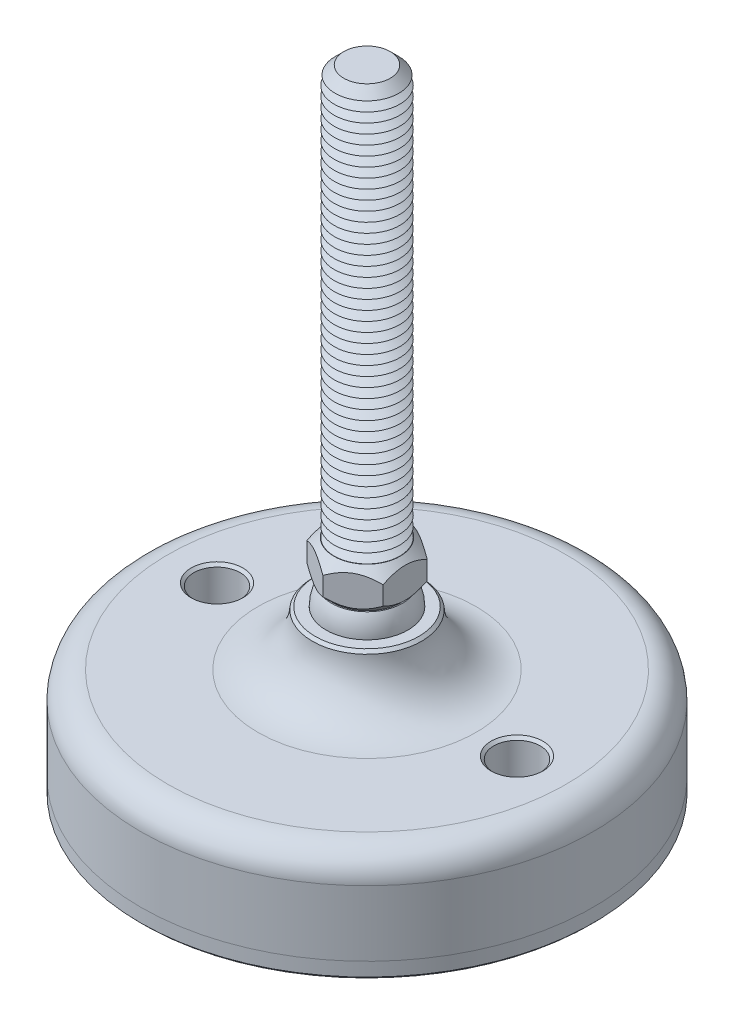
ISO-10303-21;
HEADER;
FILE_DESCRIPTION(('STEP AP214'),'2;1');
FILE_NAME('part.step','',(''),(''),'','','');
FILE_SCHEMA(('AUTOMOTIVE_DESIGN { 1 0 10303 214 1 1 1 1 }'));
ENDSEC;
DATA;
#1=APPLICATION_CONTEXT('core data for automotive mechanical design processes');
#2=APPLICATION_PROTOCOL_DEFINITION('international standard','automotive_design',2000,#1);
#3=PRODUCT_CONTEXT('',#1,'mechanical');
#4=PRODUCT('Part','Part','',(#3));
#5=PRODUCT_RELATED_PRODUCT_CATEGORY('part','',(#4));
#6=PRODUCT_DEFINITION_FORMATION('','',#4);
#7=PRODUCT_DEFINITION_CONTEXT('part definition',#1,'design');
#8=PRODUCT_DEFINITION('design','',#6,#7);
#9=PRODUCT_DEFINITION_SHAPE('','',#8);
#10=(LENGTH_UNIT() NAMED_UNIT(*) SI_UNIT(.MILLI.,.METRE.));
#11=(NAMED_UNIT(*) PLANE_ANGLE_UNIT() SI_UNIT($,.RADIAN.));
#12=(NAMED_UNIT(*) SI_UNIT($,.STERADIAN.) SOLID_ANGLE_UNIT());
#13=UNCERTAINTY_MEASURE_WITH_UNIT(LENGTH_MEASURE(1.E-05),#10,'distance_accuracy_value','');
#14=(GEOMETRIC_REPRESENTATION_CONTEXT(3) GLOBAL_UNCERTAINTY_ASSIGNED_CONTEXT((#13)) GLOBAL_UNIT_ASSIGNED_CONTEXT((#10,
#11,#12)) REPRESENTATION_CONTEXT('',''));
#15=CARTESIAN_POINT('',(0.,0.,0.));
#16=DIRECTION('',(0.,0.,1.));
#17=DIRECTION('',(1.,0.,0.));
#18=AXIS2_PLACEMENT_3D('',#15,#16,#17);
#19=CARTESIAN_POINT('',(0.,-27.,0.));
#20=DIRECTION('',(0.,1.,0.));
#21=DIRECTION('',(0.,0.,1.));
#22=AXIS2_PLACEMENT_3D('',#19,#20,#21);
#23=PLANE('',#22);
#24=CARTESIAN_POINT('',(-27.5,-27.,0.));
#25=DIRECTION('',(0.,1.,0.));
#26=DIRECTION('',(0.,0.,1.));
#27=AXIS2_PLACEMENT_3D('',#24,#25,#26);
#28=CIRCLE('',#27,4.25000000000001);
#29=CARTESIAN_POINT('',(-27.5,-27.,4.25000000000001));
#30=VERTEX_POINT('',#29);
#31=EDGE_CURVE('P0_E43',#30,#30,#28,.T.);
#32=ORIENTED_EDGE('',*,*,#31,.F.);
#33=EDGE_LOOP('',(#32));
#34=FACE_BOUND('',#33,.T.);
#35=CARTESIAN_POINT('',(27.5,-27.,0.));
#36=DIRECTION('',(0.,1.,0.));
#37=DIRECTION('',(0.,0.,1.));
#38=AXIS2_PLACEMENT_3D('',#35,#36,#37);
#39=CIRCLE('',#38,4.25000000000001);
#40=CARTESIAN_POINT('',(27.5,-27.,4.25000000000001));
#41=VERTEX_POINT('',#40);
#42=EDGE_CURVE('P0_E44',#41,#41,#39,.T.);
#43=ORIENTED_EDGE('',*,*,#42,.F.);
#44=EDGE_LOOP('',(#43));
#45=FACE_BOUND('',#44,.T.);
#46=CARTESIAN_POINT('',(0.,-27.,0.));
#47=DIRECTION('',(0.,1.,0.));
#48=DIRECTION('',(0.,0.,1.));
#49=AXIS2_PLACEMENT_3D('',#46,#47,#48);
#50=CIRCLE('',#49,41.5);
#51=CARTESIAN_POINT('',(0.,-27.,41.5));
#52=VERTEX_POINT('',#51);
#53=EDGE_CURVE('P0_E40',#52,#52,#50,.T.);
#54=ORIENTED_EDGE('',*,*,#53,.T.);
#55=EDGE_LOOP('',(#54));
#56=FACE_BOUND('',#55,.T.);
#57=ADVANCED_FACE('P0_F14',(#34,#45,#56),#23,.T.);
#58=CARTESIAN_POINT('',(0.,48.1654938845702,0.));
#59=DIRECTION('',(0.,1.,0.));
#60=DIRECTION('',(0.,0.,1.));
#61=AXIS2_PLACEMENT_3D('',#58,#59,#60);
#62=CYLINDRICAL_SURFACE('',#61,41.5);
#63=CARTESIAN_POINT('',(0.,-29.5,0.));
#64=DIRECTION('',(0.,-1.,0.));
#65=DIRECTION('',(0.,0.,-1.));
#66=AXIS2_PLACEMENT_3D('',#63,#64,#65);
#67=CIRCLE('',#66,41.5);
#68=CARTESIAN_POINT('',(0.,-29.5,-41.5));
#69=VERTEX_POINT('',#68);
#70=EDGE_CURVE('P0_E37',#69,#69,#67,.F.);
#71=ORIENTED_EDGE('',*,*,#70,.T.);
#72=EDGE_LOOP('',(#71));
#73=FACE_BOUND('',#72,.T.);
#74=ORIENTED_EDGE('',*,*,#53,.F.);
#75=EDGE_LOOP('',(#74));
#76=FACE_BOUND('',#75,.T.);
#77=ADVANCED_FACE('P0_F54',(#73,#76),#62,.T.);
#78=CARTESIAN_POINT('',(0.,-30.,41.5));
#79=DIRECTION('',(0.,-1.,0.));
#80=DIRECTION('',(0.,0.,-1.));
#81=AXIS2_PLACEMENT_3D('',#78,#79,#80);
#82=PLANE('',#81);
#83=CARTESIAN_POINT('',(27.5,-30.,0.));
#84=DIRECTION('',(0.,-1.,0.));
#85=DIRECTION('',(0.,0.,-1.));
#86=AXIS2_PLACEMENT_3D('',#83,#84,#85);
#87=CIRCLE('',#86,4.75);
#88=CARTESIAN_POINT('',(27.5,-30.,-4.75000000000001));
#89=VERTEX_POINT('',#88);
#90=EDGE_CURVE('P0_E25',#89,#89,#87,.F.);
#91=ORIENTED_EDGE('',*,*,#90,.T.);
#92=EDGE_LOOP('',(#91));
#93=FACE_BOUND('',#92,.T.);
#94=CARTESIAN_POINT('',(-27.5,-30.,0.));
#95=DIRECTION('',(0.,-1.,0.));
#96=DIRECTION('',(0.,0.,-1.));
#97=AXIS2_PLACEMENT_3D('',#94,#95,#96);
#98=CIRCLE('',#97,4.75);
#99=CARTESIAN_POINT('',(-27.5,-30.,-4.75));
#100=VERTEX_POINT('',#99);
#101=EDGE_CURVE('P0_E29',#100,#100,#98,.F.);
#102=ORIENTED_EDGE('',*,*,#101,.T.);
#103=EDGE_LOOP('',(#102));
#104=FACE_BOUND('',#103,.T.);
#105=CARTESIAN_POINT('',(0.,-30.,0.));
#106=DIRECTION('',(0.,-1.,0.));
#107=DIRECTION('',(0.,0.,-1.));
#108=AXIS2_PLACEMENT_3D('',#105,#106,#107);
#109=CIRCLE('',#108,41.);
#110=CARTESIAN_POINT('',(0.,-30.,-41.));
#111=VERTEX_POINT('',#110);
#112=EDGE_CURVE('P0_E34',#111,#111,#109,.T.);
#113=ORIENTED_EDGE('',*,*,#112,.T.);
#114=EDGE_LOOP('',(#113));
#115=FACE_BOUND('',#114,.T.);
#116=ADVANCED_FACE('P0_F61',(#93,#104,#115),#82,.T.);
#117=CARTESIAN_POINT('',(0.,-29.5,0.));
#118=DIRECTION('',(0.,1.,0.));
#119=DIRECTION('',(0.,0.,1.));
#120=AXIS2_PLACEMENT_3D('',#117,#118,#119);
#121=CONICAL_SURFACE('',#120,41.5,0.785398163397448);
#122=ORIENTED_EDGE('',*,*,#112,.F.);
#123=EDGE_LOOP('',(#122));
#124=FACE_BOUND('',#123,.T.);
#125=ORIENTED_EDGE('',*,*,#70,.F.);
#126=EDGE_LOOP('',(#125));
#127=FACE_BOUND('',#126,.T.);
#128=ADVANCED_FACE('P0_F68',(#124,#127),#121,.T.);
#129=CARTESIAN_POINT('',(27.5,-30.,0.));
#130=DIRECTION('',(0.,1.,0.));
#131=DIRECTION('',(0.,0.,1.));
#132=AXIS2_PLACEMENT_3D('',#129,#130,#131);
#133=CYLINDRICAL_SURFACE('',#132,4.25000000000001);
#134=CARTESIAN_POINT('',(27.5,-29.5,0.));
#135=DIRECTION('',(0.,-1.,0.));
#136=DIRECTION('',(0.,0.,-1.));
#137=AXIS2_PLACEMENT_3D('',#134,#135,#136);
#138=CIRCLE('',#137,4.25000000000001);
#139=CARTESIAN_POINT('',(27.5,-29.5,-4.25000000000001));
#140=VERTEX_POINT('',#139);
#141=EDGE_CURVE('P0_E21',#140,#140,#138,.T.);
#142=ORIENTED_EDGE('',*,*,#141,.T.);
#143=EDGE_LOOP('',(#142));
#144=FACE_BOUND('',#143,.T.);
#145=ORIENTED_EDGE('',*,*,#42,.T.);
#146=EDGE_LOOP('',(#145));
#147=FACE_BOUND('',#146,.T.);
#148=ADVANCED_FACE('P0_F74',(#144,#147),#133,.F.);
#149=CARTESIAN_POINT('',(-27.5,-30.,0.));
#150=DIRECTION('',(0.,1.,0.));
#151=DIRECTION('',(0.,0.,1.));
#152=AXIS2_PLACEMENT_3D('',#149,#150,#151);
#153=CYLINDRICAL_SURFACE('',#152,4.25000000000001);
#154=CARTESIAN_POINT('',(-27.5,-29.5,0.));
#155=DIRECTION('',(0.,-1.,0.));
#156=DIRECTION('',(0.,0.,-1.));
#157=AXIS2_PLACEMENT_3D('',#154,#155,#156);
#158=CIRCLE('',#157,4.25000000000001);
#159=CARTESIAN_POINT('',(-27.5,-29.5,-4.25000000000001));
#160=VERTEX_POINT('',#159);
#161=EDGE_CURVE('P0_E10',#160,#160,#158,.T.);
#162=ORIENTED_EDGE('',*,*,#161,.T.);
#163=EDGE_LOOP('',(#162));
#164=FACE_BOUND('',#163,.T.);
#165=ORIENTED_EDGE('',*,*,#31,.T.);
#166=EDGE_LOOP('',(#165));
#167=FACE_BOUND('',#166,.T.);
#168=ADVANCED_FACE('P0_F50',(#164,#167),#153,.F.);
#169=CARTESIAN_POINT('',(27.5,-30.,0.));
#170=DIRECTION('',(0.,-1.,0.));
#171=DIRECTION('',(0.,0.,-1.));
#172=AXIS2_PLACEMENT_3D('',#169,#170,#171);
#173=CONICAL_SURFACE('',#172,4.75,0.785398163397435);
#174=ORIENTED_EDGE('',*,*,#141,.F.);
#175=EDGE_LOOP('',(#174));
#176=FACE_BOUND('',#175,.T.);
#177=ORIENTED_EDGE('',*,*,#90,.F.);
#178=EDGE_LOOP('',(#177));
#179=FACE_BOUND('',#178,.T.);
#180=ADVANCED_FACE('P0_F76',(#176,#179),#173,.F.);
#181=CARTESIAN_POINT('',(-27.5,-30.,0.));
#182=DIRECTION('',(0.,-1.,0.));
#183=DIRECTION('',(0.,0.,-1.));
#184=AXIS2_PLACEMENT_3D('',#181,#182,#183);
#185=CONICAL_SURFACE('',#184,4.75,0.785398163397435);
#186=ORIENTED_EDGE('',*,*,#161,.F.);
#187=EDGE_LOOP('',(#186));
#188=FACE_BOUND('',#187,.T.);
#189=ORIENTED_EDGE('',*,*,#101,.F.);
#190=EDGE_LOOP('',(#189));
#191=FACE_BOUND('',#190,.T.);
#192=ADVANCED_FACE('P0_F16',(#188,#191),#185,.F.);
#193=CLOSED_SHELL('',(#57,#77,#116,#128,#148,#168,#180,#192));
#194=MANIFOLD_SOLID_BREP('P0_B1',#193);
#195=CARTESIAN_POINT('',(0.,0.,0.));
#196=DIRECTION('',(0.,1.,0.));
#197=DIRECTION('',(0.,0.,-1.));
#198=AXIS2_PLACEMENT_3D('',#195,#196,#197);
#199=SPHERICAL_SURFACE('',#198,7.5);
#200=CARTESIAN_POINT('',(0.,3.75,0.));
#201=DIRECTION('',(0.,-1.,0.));
#202=DIRECTION('',(0.,0.,-1.));
#203=AXIS2_PLACEMENT_3D('',#200,#201,#202);
#204=CIRCLE('',#203,6.49519052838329);
#205=CARTESIAN_POINT('',(0.,3.75,-6.49519052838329));
#206=VERTEX_POINT('',#205);
#207=EDGE_CURVE('P1_E211',#206,#206,#204,.F.);
#208=ORIENTED_EDGE('',*,*,#207,.F.);
#209=EDGE_LOOP('',(#208));
#210=FACE_BOUND('',#209,.T.);
#211=ADVANCED_FACE('P1_F16',(#210),#199,.T.);
#212=CARTESIAN_POINT('',(0.,3.75,0.));
#213=DIRECTION('',(0.,1.,0.));
#214=DIRECTION('',(0.,0.,1.));
#215=AXIS2_PLACEMENT_3D('',#212,#213,#214);
#216=CONICAL_SURFACE('',#215,6.26419292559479,0.785398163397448);
#217=CARTESIAN_POINT('',(0.,3.75,0.));
#218=DIRECTION('',(0.,1.,0.));
#219=DIRECTION('',(0.,0.,1.));
#220=AXIS2_PLACEMENT_3D('',#217,#218,#219);
#221=CIRCLE('',#220,6.26419292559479);
#222=CARTESIAN_POINT('',(0.,3.75,6.26419292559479));
#223=VERTEX_POINT('',#222);
#224=EDGE_CURVE('P1_E215',#223,#223,#221,.T.);
#225=ORIENTED_EDGE('',*,*,#224,.T.);
#226=EDGE_LOOP('',(#225));
#227=FACE_BOUND('',#226,.T.);
#228=CARTESIAN_POINT('',(-7.,8.22175145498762,-8.1400553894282));
#229=CARTESIAN_POINT('',(-7.,8.07177748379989,-7.94220937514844));
#230=CARTESIAN_POINT('',(-7.,7.92322959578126,-7.74326459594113));
#231=CARTESIAN_POINT('',(-7.,7.62962733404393,-7.34274065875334));
#232=CARTESIAN_POINT('',(-7.,7.48457383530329,-7.14116086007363));
#233=CARTESIAN_POINT('',(-7.,7.19756981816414,-6.73345531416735));
#234=CARTESIAN_POINT('',(-7.,7.05565202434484,-6.52730645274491));
#235=CARTESIAN_POINT('',(-7.,6.77703382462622,-6.11152362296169));
#236=CARTESIAN_POINT('',(-7.,6.64033305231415,-5.90188990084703));
#237=CARTESIAN_POINT('',(-7.,6.36550740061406,-5.46619755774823));
#238=CARTESIAN_POINT('',(-7.,6.22776674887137,-5.23989534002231));
#239=CARTESIAN_POINT('',(-7.,5.96123372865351,-4.78200028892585));
#240=CARTESIAN_POINT('',(-7.,5.83244279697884,-4.55040661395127));
#241=CARTESIAN_POINT('',(-7.,5.58658047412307,-4.08193183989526));
#242=CARTESIAN_POINT('',(-7.,5.46947462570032,-3.8450689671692));
#243=CARTESIAN_POINT('',(-7.,5.24960465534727,-3.36483104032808));
#244=CARTESIAN_POINT('',(-7.,5.14683397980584,-3.12145902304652));
#245=CARTESIAN_POINT('',(-7.,4.96723655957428,-2.64866791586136));
#246=CARTESIAN_POINT('',(-7.,4.88895097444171,-2.41980876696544));
#247=CARTESIAN_POINT('',(-7.,4.75072959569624,-1.9565107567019));
#248=CARTESIAN_POINT('',(-7.,4.69079504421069,-1.72207151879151));
#249=CARTESIAN_POINT('',(-7.,4.59342684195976,-1.25295119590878));
#250=CARTESIAN_POINT('',(-7.,4.5556027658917,-1.01835249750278));
#251=CARTESIAN_POINT('',(-7.,4.50320231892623,-0.546559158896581));
#252=CARTESIAN_POINT('',(-7.,4.48862178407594,-0.309364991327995));
#253=CARTESIAN_POINT('',(-7.,4.48382612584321,0.156313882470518));
#254=CARTESIAN_POINT('',(-7.,4.49271264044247,0.384789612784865));
#255=CARTESIAN_POINT('',(-7.,4.53235928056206,0.839822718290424));
#256=CARTESIAN_POINT('',(-7.,4.56312150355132,1.06637990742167));
#257=CARTESIAN_POINT('',(-7.,4.64535130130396,1.51976805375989));
#258=CARTESIAN_POINT('',(-7.,4.69717402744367,1.74653354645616));
#259=CARTESIAN_POINT('',(-7.,4.81873728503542,2.19511331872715));
#260=CARTESIAN_POINT('',(-7.,4.88847641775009,2.41692798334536));
#261=CARTESIAN_POINT('',(-7.,5.04951755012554,2.87389766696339));
#262=CARTESIAN_POINT('',(-7.,5.14215063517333,3.10857869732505));
#263=CARTESIAN_POINT('',(-7.,5.3416605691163,3.57185972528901));
#264=CARTESIAN_POINT('',(-7.,5.44854400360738,3.80045685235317));
#265=CARTESIAN_POINT('',(-7.,5.6740138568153,4.25267813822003));
#266=CARTESIAN_POINT('',(-7.,5.79263686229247,4.47628390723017));
#267=CARTESIAN_POINT('',(-7.,6.03896666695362,4.91835509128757));
#268=CARTESIAN_POINT('',(-7.,6.16667203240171,5.13682131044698));
#269=CARTESIAN_POINT('',(-7.,6.4228595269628,5.55855563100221));
#270=CARTESIAN_POINT('',(-7.,6.55098806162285,5.76203966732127));
#271=CARTESIAN_POINT('',(-7.,6.81264959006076,6.16551366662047));
#272=CARTESIAN_POINT('',(-7.,6.94618299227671,6.36550336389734));
#273=CARTESIAN_POINT('',(-7.,7.21658951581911,6.76082742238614));
#274=CARTESIAN_POINT('',(-7.,7.35342681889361,6.95618637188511));
#275=CARTESIAN_POINT('',(-7.,7.6307324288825,7.34423185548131));
#276=CARTESIAN_POINT('',(-7.,7.77119972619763,7.53691911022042));
#277=CARTESIAN_POINT('',(-7.,7.91315155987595,7.72848711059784));
#278=B_SPLINE_CURVE_WITH_KNOTS('',3,(#228,#229,#230,#231,#232,#233,#234,#235,#236,#237,#238,
#239,#240,#241,#242,#243,#244,#245,#246,#247,#248,#249,#250,#251,#252,#253,#254,#255,#256,#257,
#258,#259,#260,#261,#262,#263,#264,#265,#266,#267,#268,#269,#270,#271,#272,#273,#274,#275,#276,
#277),.UNSPECIFIED.,.F.,.F.,(4,2,2,2,2,2,2,2,2,2,2,2,2,2,2,2,2,2,2,2,2,2,2,2,4),(0.,
0.744807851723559,1.48980030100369,2.2405614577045,2.99126978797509,3.78587980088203,
4.58061708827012,5.37293691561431,6.16489332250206,6.88989369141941,7.61494312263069,
8.32676947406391,9.0384682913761,9.72332048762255,10.4082383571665,11.1052200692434,
11.8021473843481,12.5584650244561,13.3151334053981,14.0742390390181,14.8332251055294,
15.5545151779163,16.2758598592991,16.9913609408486,17.7066651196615),.UNSPECIFIED.);
#279=CARTESIAN_POINT('',(-7.,5.56871084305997,-4.04145188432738));
#280=VERTEX_POINT('',#279);
#281=CARTESIAN_POINT('',(-7.,5.56871084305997,4.04145188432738));
#282=VERTEX_POINT('',#281);
#283=EDGE_CURVE('P1_E25',#280,#282,#278,.T.);
#284=ORIENTED_EDGE('',*,*,#283,.F.);
#285=CARTESIAN_POINT('',(0.000199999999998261,5.56882631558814,-8.0830192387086));
#286=CARTESIAN_POINT('',(-0.120159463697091,5.49934419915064,-8.01352966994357));
#287=CARTESIAN_POINT('',(-0.241444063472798,5.43199440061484,-7.94350597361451));
#288=CARTESIAN_POINT('',(-0.486045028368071,5.30220807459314,-7.80228554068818));
#289=CARTESIAN_POINT('',(-0.60936245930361,5.2397742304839,-7.73108818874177));
#290=CARTESIAN_POINT('',(-0.983781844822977,5.06028719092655,-7.51491705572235));
#291=CARTESIAN_POINT('',(-1.23805341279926,4.95181416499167,-7.36811329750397));
#292=CARTESIAN_POINT('',(-1.75081233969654,4.76606165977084,-7.07207179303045));
#293=CARTESIAN_POINT('',(-2.00916864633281,4.68831421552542,-6.92290970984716));
#294=CARTESIAN_POINT('',(-2.40095049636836,4.59837958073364,-6.69671435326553));
#295=CARTESIAN_POINT('',(-2.53212124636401,4.57286115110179,-6.62098288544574));
#296=CARTESIAN_POINT('',(-2.79557335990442,4.53129725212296,-6.4688787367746));
#297=CARTESIAN_POINT('',(-2.92785455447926,4.5152503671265,-6.39250615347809));
#298=CARTESIAN_POINT('',(-3.25020698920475,4.48834537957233,-6.2063958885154));
#299=CARTESIAN_POINT('',(-3.44062555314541,4.48270029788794,-6.09645767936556));
#300=CARTESIAN_POINT('',(-3.82111946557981,4.49217587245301,-5.87677941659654));
#301=CARTESIAN_POINT('',(-4.01119467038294,4.5073038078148,-5.76703944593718));
#302=CARTESIAN_POINT('',(-4.38955306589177,4.55743368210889,-5.54859412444));
#303=CARTESIAN_POINT('',(-4.57783401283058,4.5924578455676,-5.43989006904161));
#304=CARTESIAN_POINT('',(-4.95115981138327,4.68047604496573,-5.22435031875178));
#305=CARTESIAN_POINT('',(-5.13620490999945,4.73346870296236,-5.1175144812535));
#306=CARTESIAN_POINT('',(-5.46469033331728,4.84248989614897,-4.92786333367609));
#307=CARTESIAN_POINT('',(-5.6088580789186,4.89565100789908,-4.8446280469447));
#308=CARTESIAN_POINT('',(-5.8946056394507,5.0105398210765,-4.67965161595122));
#309=CARTESIAN_POINT('',(-6.03618537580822,5.07226778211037,-4.5979105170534));
#310=CARTESIAN_POINT('',(-6.31631098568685,5.20290661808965,-4.43617992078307));
#311=CARTESIAN_POINT('',(-6.4548648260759,5.27179490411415,-4.3561858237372));
#312=CARTESIAN_POINT('',(-6.72940692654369,5.41585000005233,-4.19767886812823));
#313=CARTESIAN_POINT('',(-6.86539669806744,5.49101295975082,-4.11916513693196));
#314=CARTESIAN_POINT('',(-7.0002,5.56882631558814,-4.04133641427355));
#315=B_SPLINE_CURVE_WITH_KNOTS('',3,(#285,#286,#287,#288,#289,#290,#291,#292,#293,#294,#295,
#296,#297,#298,#299,#300,#301,#302,#303,#304,#305,#306,#307,#308,#309,#310,#311,#312,#313,#314),
.UNSPECIFIED.,.F.,.F.,(4,2,2,2,2,2,2,2,2,2,2,2,2,2,4),(0.,0.466112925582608,0.932478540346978,
1.87024464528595,2.79312018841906,3.25365289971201,3.71411676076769,4.37293813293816,
5.03199042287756,5.69178034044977,6.35151967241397,6.8755322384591,7.39956068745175,
7.92198344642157,8.44408796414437),.UNSPECIFIED.);
#316=CARTESIAN_POINT('',(0.,5.56871084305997,-8.08290376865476));
#317=VERTEX_POINT('',#316);
#318=EDGE_CURVE('P1_E116',#317,#280,#315,.T.);
#319=ORIENTED_EDGE('',*,*,#318,.F.);
#320=CARTESIAN_POINT('',(7.00019999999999,5.56882631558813,-4.04133641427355));
#321=CARTESIAN_POINT('',(6.8798405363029,5.49934419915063,-4.11082598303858));
#322=CARTESIAN_POINT('',(6.7585559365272,5.43199440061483,-4.18084967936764));
#323=CARTESIAN_POINT('',(6.51395497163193,5.30220807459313,-4.32207011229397));
#324=CARTESIAN_POINT('',(6.39063754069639,5.2397742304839,-4.39326746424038));
#325=CARTESIAN_POINT('',(6.01621815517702,5.06028719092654,-4.6094385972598));
#326=CARTESIAN_POINT('',(5.76194658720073,4.95181416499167,-4.75624235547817));
#327=CARTESIAN_POINT('',(5.24918766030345,4.76606165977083,-5.0522838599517));
#328=CARTESIAN_POINT('',(4.99083135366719,4.68831421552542,-5.20144594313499));
#329=CARTESIAN_POINT('',(4.59904950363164,4.59837958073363,-5.42764129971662));
#330=CARTESIAN_POINT('',(4.46787875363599,4.57286115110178,-5.50337276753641));
#331=CARTESIAN_POINT('',(4.20442664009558,4.53129725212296,-5.65547691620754));
#332=CARTESIAN_POINT('',(4.07214544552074,4.5152503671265,-5.73184949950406));
#333=CARTESIAN_POINT('',(3.74979301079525,4.48834537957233,-5.91795976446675));
#334=CARTESIAN_POINT('',(3.55937444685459,4.48270029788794,-6.02789797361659));
#335=CARTESIAN_POINT('',(3.17888053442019,4.49217587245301,-6.2475762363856));
#336=CARTESIAN_POINT('',(2.98880532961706,4.5073038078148,-6.35731620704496));
#337=CARTESIAN_POINT('',(2.61044693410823,4.55743368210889,-6.57576152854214));
#338=CARTESIAN_POINT('',(2.42216598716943,4.5924578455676,-6.68446558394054));
#339=CARTESIAN_POINT('',(2.04884018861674,4.68047604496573,-6.90000533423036));
#340=CARTESIAN_POINT('',(1.86379509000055,4.73346870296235,-7.00684117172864));
#341=CARTESIAN_POINT('',(1.53530966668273,4.84248989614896,-7.19649231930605));
#342=CARTESIAN_POINT('',(1.3911419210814,4.89565100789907,-7.27972760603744));
#343=CARTESIAN_POINT('',(1.1053943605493,5.0105398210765,-7.44470403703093));
#344=CARTESIAN_POINT('',(0.96381462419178,5.07226778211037,-7.52644513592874));
#345=CARTESIAN_POINT('',(0.683689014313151,5.20290661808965,-7.68817573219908));
#346=CARTESIAN_POINT('',(0.545135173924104,5.27179490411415,-7.76816982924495));
#347=CARTESIAN_POINT('',(0.270593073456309,5.41585000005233,-7.92667678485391));
#348=CARTESIAN_POINT('',(0.134603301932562,5.49101295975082,-8.00519051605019));
#349=CARTESIAN_POINT('',(-0.00020000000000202,5.56882631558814,-8.0830192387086));
#350=B_SPLINE_CURVE_WITH_KNOTS('',3,(#320,#321,#322,#323,#324,#325,#326,#327,#328,#329,#330,
#331,#332,#333,#334,#335,#336,#337,#338,#339,#340,#341,#342,#343,#344,#345,#346,#347,#348,#349),
.UNSPECIFIED.,.F.,.F.,(4,2,2,2,2,2,2,2,2,2,2,2,2,2,4),(0.,0.466112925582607,0.932478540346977,
1.87024464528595,2.79312018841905,3.25365289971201,3.71411676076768,4.37293813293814,
5.03199042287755,5.69178034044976,6.35151967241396,6.87553223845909,7.39956068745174,
7.92198344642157,8.44408796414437),.UNSPECIFIED.);
#351=CARTESIAN_POINT('',(7.,5.56871084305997,-4.04145188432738));
#352=VERTEX_POINT('',#351);
#353=EDGE_CURVE('P1_E123',#352,#317,#350,.T.);
#354=ORIENTED_EDGE('',*,*,#353,.F.);
#355=CARTESIAN_POINT('',(6.99999999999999,8.22175145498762,-8.1400553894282));
#356=CARTESIAN_POINT('',(6.99999999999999,8.07177748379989,-7.94220937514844));
#357=CARTESIAN_POINT('',(6.99999999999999,7.92322959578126,-7.74326459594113));
#358=CARTESIAN_POINT('',(6.99999999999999,7.62962733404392,-7.34274065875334));
#359=CARTESIAN_POINT('',(6.99999999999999,7.48457383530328,-7.14116086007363));
#360=CARTESIAN_POINT('',(6.99999999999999,7.19756981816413,-6.73345531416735));
#361=CARTESIAN_POINT('',(6.99999999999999,7.05565202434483,-6.52730645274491));
#362=CARTESIAN_POINT('',(6.99999999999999,6.77703382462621,-6.11152362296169));
#363=CARTESIAN_POINT('',(6.99999999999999,6.64033305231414,-5.90188990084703));
#364=CARTESIAN_POINT('',(6.99999999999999,6.36550740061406,-5.46619755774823));
#365=CARTESIAN_POINT('',(6.99999999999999,6.22776674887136,-5.23989534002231));
#366=CARTESIAN_POINT('',(6.99999999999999,5.9612337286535,-4.78200028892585));
#367=CARTESIAN_POINT('',(6.99999999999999,5.83244279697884,-4.55040661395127));
#368=CARTESIAN_POINT('',(6.99999999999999,5.58658047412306,-4.08193183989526));
#369=CARTESIAN_POINT('',(6.99999999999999,5.46947462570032,-3.8450689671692));
#370=CARTESIAN_POINT('',(6.99999999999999,5.24960465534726,-3.36483104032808));
#371=CARTESIAN_POINT('',(6.99999999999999,5.14683397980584,-3.12145902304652));
#372=CARTESIAN_POINT('',(6.99999999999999,4.96723655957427,-2.64866791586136));
#373=CARTESIAN_POINT('',(6.99999999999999,4.88895097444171,-2.41980876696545));
#374=CARTESIAN_POINT('',(6.99999999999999,4.75072959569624,-1.9565107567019));
#375=CARTESIAN_POINT('',(6.99999999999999,4.69079504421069,-1.72207151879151));
#376=CARTESIAN_POINT('',(6.99999999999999,4.59342684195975,-1.25295119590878));
#377=CARTESIAN_POINT('',(6.99999999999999,4.5556027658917,-1.01835249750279));
#378=CARTESIAN_POINT('',(6.99999999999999,4.50320231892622,-0.546559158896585));
#379=CARTESIAN_POINT('',(6.99999999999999,4.48862178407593,-0.309364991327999));
#380=CARTESIAN_POINT('',(6.99999999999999,4.48382612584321,0.156313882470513));
#381=CARTESIAN_POINT('',(6.99999999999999,4.49271264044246,0.38478961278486));
#382=CARTESIAN_POINT('',(6.99999999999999,4.53235928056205,0.83982271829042));
#383=CARTESIAN_POINT('',(6.99999999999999,4.56312150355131,1.06637990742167));
#384=CARTESIAN_POINT('',(6.99999999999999,4.64535130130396,1.51976805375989));
#385=CARTESIAN_POINT('',(6.99999999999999,4.69717402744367,1.74653354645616));
#386=CARTESIAN_POINT('',(6.99999999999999,4.81873728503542,2.19511331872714));
#387=CARTESIAN_POINT('',(7.,4.88847641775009,2.41692798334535));
#388=CARTESIAN_POINT('',(7.,5.04951755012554,2.87389766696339));
#389=CARTESIAN_POINT('',(7.,5.14215063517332,3.10857869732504));
#390=CARTESIAN_POINT('',(7.,5.34166056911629,3.571859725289));
#391=CARTESIAN_POINT('',(7.,5.44854400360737,3.80045685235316));
#392=CARTESIAN_POINT('',(7.,5.67401385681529,4.25267813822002));
#393=CARTESIAN_POINT('',(7.,5.79263686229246,4.47628390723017));
#394=CARTESIAN_POINT('',(7.,6.03896666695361,4.91835509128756));
#395=CARTESIAN_POINT('',(7.,6.1666720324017,5.13682131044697));
#396=CARTESIAN_POINT('',(7.,6.42285952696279,5.5585556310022));
#397=CARTESIAN_POINT('',(7.,6.55098806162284,5.76203966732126));
#398=CARTESIAN_POINT('',(7.,6.81264959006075,6.16551366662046));
#399=CARTESIAN_POINT('',(7.,6.9461829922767,6.36550336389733));
#400=CARTESIAN_POINT('',(7.,7.21658951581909,6.76082742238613));
#401=CARTESIAN_POINT('',(7.,7.3534268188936,6.9561863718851));
#402=CARTESIAN_POINT('',(7.,7.63073242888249,7.3442318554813));
#403=CARTESIAN_POINT('',(7.,7.77119972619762,7.53691911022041));
#404=CARTESIAN_POINT('',(7.,7.91315155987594,7.72848711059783));
#405=B_SPLINE_CURVE_WITH_KNOTS('',3,(#355,#356,#357,#358,#359,#360,#361,#362,#363,#364,#365,
#366,#367,#368,#369,#370,#371,#372,#373,#374,#375,#376,#377,#378,#379,#380,#381,#382,#383,#384,
#385,#386,#387,#388,#389,#390,#391,#392,#393,#394,#395,#396,#397,#398,#399,#400,#401,#402,#403,
#404),.UNSPECIFIED.,.F.,.F.,(4,2,2,2,2,2,2,2,2,2,2,2,2,2,2,2,2,2,2,2,2,2,2,2,4),(0.,
0.744807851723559,1.48980030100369,2.2405614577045,2.9912697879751,3.78587980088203,
4.58061708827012,5.3729369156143,6.16489332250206,6.8898936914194,7.61494312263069,
8.32676947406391,9.03846829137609,9.72332048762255,10.4082383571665,11.1052200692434,
11.8021473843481,12.5584650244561,13.3151334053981,14.0742390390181,14.8332251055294,
15.5545151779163,16.275859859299,16.9913609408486,17.7066651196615),.UNSPECIFIED.);
#406=CARTESIAN_POINT('',(6.99999999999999,5.56871084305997,4.04145188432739));
#407=VERTEX_POINT('',#406);
#408=EDGE_CURVE('P1_E71',#407,#352,#405,.F.);
#409=ORIENTED_EDGE('',*,*,#408,.F.);
#410=CARTESIAN_POINT('',(-0.000200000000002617,5.56882631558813,8.0830192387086));
#411=CARTESIAN_POINT('',(0.120159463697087,5.49934419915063,8.01352966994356));
#412=CARTESIAN_POINT('',(0.241444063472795,5.43199440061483,7.9435059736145));
#413=CARTESIAN_POINT('',(0.486045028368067,5.30220807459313,7.80228554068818));
#414=CARTESIAN_POINT('',(0.609362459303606,5.2397742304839,7.73108818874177));
#415=CARTESIAN_POINT('',(0.983781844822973,5.06028719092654,7.51491705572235));
#416=CARTESIAN_POINT('',(1.23805341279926,4.95181416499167,7.36811329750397));
#417=CARTESIAN_POINT('',(1.75081233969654,4.76606165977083,7.07207179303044));
#418=CARTESIAN_POINT('',(2.00916864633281,4.68831421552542,6.92290970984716));
#419=CARTESIAN_POINT('',(2.40095049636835,4.59837958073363,6.69671435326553));
#420=CARTESIAN_POINT('',(2.53212124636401,4.57286115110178,6.62098288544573));
#421=CARTESIAN_POINT('',(2.79557335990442,4.53129725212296,6.4688787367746));
#422=CARTESIAN_POINT('',(2.92785455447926,4.5152503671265,6.39250615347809));
#423=CARTESIAN_POINT('',(3.25020698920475,4.48834537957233,6.2063958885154));
#424=CARTESIAN_POINT('',(3.44062555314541,4.48270029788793,6.09645767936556));
#425=CARTESIAN_POINT('',(3.82111946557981,4.492175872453,5.87677941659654));
#426=CARTESIAN_POINT('',(4.01119467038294,4.5073038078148,5.76703944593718));
#427=CARTESIAN_POINT('',(4.38955306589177,4.55743368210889,5.54859412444));
#428=CARTESIAN_POINT('',(4.57783401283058,4.5924578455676,5.4398900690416));
#429=CARTESIAN_POINT('',(4.95115981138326,4.68047604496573,5.22435031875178));
#430=CARTESIAN_POINT('',(5.13620490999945,4.73346870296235,5.1175144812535));
#431=CARTESIAN_POINT('',(5.46469033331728,4.84248989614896,4.92786333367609));
#432=CARTESIAN_POINT('',(5.6088580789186,4.89565100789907,4.8446280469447));
#433=CARTESIAN_POINT('',(5.8946056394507,5.01053982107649,4.67965161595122));
#434=CARTESIAN_POINT('',(6.03618537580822,5.07226778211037,4.5979105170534));
#435=CARTESIAN_POINT('',(6.31631098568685,5.20290661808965,4.43617992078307));
#436=CARTESIAN_POINT('',(6.45486482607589,5.27179490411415,4.3561858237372));
#437=CARTESIAN_POINT('',(6.72940692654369,5.41585000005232,4.19767886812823));
#438=CARTESIAN_POINT('',(6.86539669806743,5.49101295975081,4.11916513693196));
#439=CARTESIAN_POINT('',(7.00019999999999,5.56882631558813,4.04133641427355));
#440=B_SPLINE_CURVE_WITH_KNOTS('',3,(#410,#411,#412,#413,#414,#415,#416,#417,#418,#419,#420,
#421,#422,#423,#424,#425,#426,#427,#428,#429,#430,#431,#432,#433,#434,#435,#436,#437,#438,#439),
.UNSPECIFIED.,.F.,.F.,(4,2,2,2,2,2,2,2,2,2,2,2,2,2,4),(0.,0.466112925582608,0.932478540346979,
1.87024464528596,2.79312018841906,3.25365289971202,3.71411676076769,4.37293813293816,
5.03199042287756,5.69178034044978,6.35151967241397,6.8755322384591,7.39956068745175,
7.92198344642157,8.44408796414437),.UNSPECIFIED.);
#441=CARTESIAN_POINT('',(0.,5.56871084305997,8.08290376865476));
#442=VERTEX_POINT('',#441);
#443=EDGE_CURVE('P1_E68',#442,#407,#440,.T.);
#444=ORIENTED_EDGE('',*,*,#443,.F.);
#445=CARTESIAN_POINT('',(-7.0002,5.56882631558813,4.04133641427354));
#446=CARTESIAN_POINT('',(-6.87984053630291,5.49934419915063,4.11082598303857));
#447=CARTESIAN_POINT('',(-6.7585559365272,5.43199440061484,4.18084967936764));
#448=CARTESIAN_POINT('',(-6.51395497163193,5.30220807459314,4.32207011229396));
#449=CARTESIAN_POINT('',(-6.39063754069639,5.2397742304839,4.39326746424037));
#450=CARTESIAN_POINT('',(-6.01621815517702,5.06028719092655,4.60943859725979));
#451=CARTESIAN_POINT('',(-5.76194658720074,4.95181416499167,4.75624235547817));
#452=CARTESIAN_POINT('',(-5.24918766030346,4.76606165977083,5.0522838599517));
#453=CARTESIAN_POINT('',(-4.99083135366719,4.68831421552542,5.20144594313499));
#454=CARTESIAN_POINT('',(-4.59904950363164,4.59837958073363,5.42764129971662));
#455=CARTESIAN_POINT('',(-4.46787875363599,4.57286115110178,5.50337276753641));
#456=CARTESIAN_POINT('',(-4.20442664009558,4.53129725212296,5.65547691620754));
#457=CARTESIAN_POINT('',(-4.07214544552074,4.5152503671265,5.73184949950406));
#458=CARTESIAN_POINT('',(-3.74979301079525,4.48834537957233,5.91795976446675));
#459=CARTESIAN_POINT('',(-3.55937444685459,4.48270029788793,6.02789797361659));
#460=CARTESIAN_POINT('',(-3.17888053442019,4.492175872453,6.2475762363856));
#461=CARTESIAN_POINT('',(-2.98880532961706,4.5073038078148,6.35731620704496));
#462=CARTESIAN_POINT('',(-2.61044693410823,4.55743368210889,6.57576152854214));
#463=CARTESIAN_POINT('',(-2.42216598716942,4.5924578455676,6.68446558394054));
#464=CARTESIAN_POINT('',(-2.04884018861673,4.68047604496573,6.90000533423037));
#465=CARTESIAN_POINT('',(-1.86379509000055,4.73346870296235,7.00684117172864));
#466=CARTESIAN_POINT('',(-1.53530966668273,4.84248989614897,7.19649231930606));
#467=CARTESIAN_POINT('',(-1.3911419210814,4.89565100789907,7.27972760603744));
#468=CARTESIAN_POINT('',(-1.1053943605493,5.01053982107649,7.44470403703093));
#469=CARTESIAN_POINT('',(-0.963814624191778,5.07226778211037,7.52644513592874));
#470=CARTESIAN_POINT('',(-0.683689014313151,5.20290661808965,7.68817573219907));
#471=CARTESIAN_POINT('',(-0.545135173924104,5.27179490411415,7.76816982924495));
#472=CARTESIAN_POINT('',(-0.270593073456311,5.41585000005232,7.92667678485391));
#473=CARTESIAN_POINT('',(-0.134603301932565,5.49101295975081,8.00519051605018));
#474=CARTESIAN_POINT('',(0.000199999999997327,5.56882631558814,8.0830192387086));
#475=B_SPLINE_CURVE_WITH_KNOTS('',3,(#445,#446,#447,#448,#449,#450,#451,#452,#453,#454,#455,
#456,#457,#458,#459,#460,#461,#462,#463,#464,#465,#466,#467,#468,#469,#470,#471,#472,#473,#474),
.UNSPECIFIED.,.F.,.F.,(4,2,2,2,2,2,2,2,2,2,2,2,2,2,4),(0.,0.466112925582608,0.93247854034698,
1.87024464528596,2.79312018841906,3.25365289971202,3.71411676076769,4.37293813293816,
5.03199042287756,5.69178034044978,6.35151967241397,6.8755322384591,7.39956068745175,
7.92198344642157,8.44408796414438),.UNSPECIFIED.);
#476=EDGE_CURVE('P1_E40',#282,#442,#475,.T.);
#477=ORIENTED_EDGE('',*,*,#476,.F.);
#478=EDGE_LOOP('',(#284,#319,#354,#409,#444,#477));
#479=FACE_BOUND('',#478,.T.);
#480=ADVANCED_FACE('P1_F69',(#227,#479),#216,.T.);
#481=CARTESIAN_POINT('',(0.,3.75,6.26419292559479));
#482=DIRECTION('',(0.,-1.,0.));
#483=DIRECTION('',(0.,0.,-1.));
#484=AXIS2_PLACEMENT_3D('',#481,#482,#483);
#485=PLANE('',#484);
#486=ORIENTED_EDGE('',*,*,#207,.T.);
#487=EDGE_LOOP('',(#486));
#488=FACE_BOUND('',#487,.T.);
#489=ORIENTED_EDGE('',*,*,#224,.F.);
#490=EDGE_LOOP('',(#489));
#491=FACE_BOUND('',#490,.T.);
#492=ADVANCED_FACE('P1_F107',(#488,#491),#485,.F.);
#493=CARTESIAN_POINT('',(-7.,11.,4.04145188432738));
#494=DIRECTION('',(0.5,0.,-0.866025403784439));
#495=DIRECTION('',(-0.866025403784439,0.,-0.5));
#496=AXIS2_PLACEMENT_3D('',#493,#494,#495);
#497=PLANE('',#496);
#498=DIRECTION('',(0.,-1.,0.));
#499=VECTOR('',#498,1.);
#500=CARTESIAN_POINT('',(0.,11.,8.08290376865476));
#501=LINE('',#500,#499);
#502=CARTESIAN_POINT('',(0.,8.97927405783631,8.08290376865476));
#503=VERTEX_POINT('',#502);
#504=EDGE_CURVE('P1_E82',#503,#442,#501,.T.);
#505=ORIENTED_EDGE('',*,*,#504,.F.);
#506=CARTESIAN_POINT('',(0.000199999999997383,8.97915858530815,8.0830192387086));
#507=CARTESIAN_POINT('',(-0.120159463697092,9.04864070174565,8.01352966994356));
#508=CARTESIAN_POINT('',(-0.241444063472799,9.11599050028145,7.9435059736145));
#509=CARTESIAN_POINT('',(-0.486045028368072,9.24577682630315,7.80228554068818));
#510=CARTESIAN_POINT('',(-0.609362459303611,9.30821067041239,7.73108818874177));
#511=CARTESIAN_POINT('',(-0.983781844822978,9.48769770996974,7.51491705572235));
#512=CARTESIAN_POINT('',(-1.23805341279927,9.59617073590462,7.36811329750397));
#513=CARTESIAN_POINT('',(-1.75081233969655,9.78192324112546,7.07207179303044));
#514=CARTESIAN_POINT('',(-2.00916864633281,9.85967068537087,6.92290970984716));
#515=CARTESIAN_POINT('',(-2.40095049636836,9.94960532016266,6.69671435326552));
#516=CARTESIAN_POINT('',(-2.53212124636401,9.9751237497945,6.62098288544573));
#517=CARTESIAN_POINT('',(-2.79557335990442,10.0166876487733,6.4688787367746));
#518=CARTESIAN_POINT('',(-2.92785455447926,10.0327345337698,6.39250615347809));
#519=CARTESIAN_POINT('',(-3.25020698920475,10.059639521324,6.2063958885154));
#520=CARTESIAN_POINT('',(-3.44062555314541,10.0652846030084,6.09645767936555));
#521=CARTESIAN_POINT('',(-3.82111946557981,10.0558090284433,5.87677941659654));
#522=CARTESIAN_POINT('',(-4.01119467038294,10.0406810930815,5.76703944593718));
#523=CARTESIAN_POINT('',(-4.38955306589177,9.9905512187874,5.54859412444));
#524=CARTESIAN_POINT('',(-4.57783401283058,9.95552705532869,5.4398900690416));
#525=CARTESIAN_POINT('',(-4.95115981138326,9.86750885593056,5.22435031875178));
#526=CARTESIAN_POINT('',(-5.13620490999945,9.81451619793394,5.1175144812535));
#527=CARTESIAN_POINT('',(-5.46469033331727,9.70549500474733,4.92786333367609));
#528=CARTESIAN_POINT('',(-5.6088580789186,9.65233389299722,4.8446280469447));
#529=CARTESIAN_POINT('',(-5.8946056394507,9.5374450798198,4.67965161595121));
#530=CARTESIAN_POINT('',(-6.03618537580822,9.47571711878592,4.5979105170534));
#531=CARTESIAN_POINT('',(-6.31631098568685,9.34507828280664,4.43617992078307));
#532=CARTESIAN_POINT('',(-6.4548648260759,9.27618999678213,4.35618582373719));
#533=CARTESIAN_POINT('',(-6.72940692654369,9.13213490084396,4.19767886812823));
#534=CARTESIAN_POINT('',(-6.86539669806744,9.05697194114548,4.11916513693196));
#535=CARTESIAN_POINT('',(-7.0002,8.97915858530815,4.04133641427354));
#536=B_SPLINE_CURVE_WITH_KNOTS('',3,(#506,#507,#508,#509,#510,#511,#512,#513,#514,#515,#516,
#517,#518,#519,#520,#521,#522,#523,#524,#525,#526,#527,#528,#529,#530,#531,#532,#533,#534,#535),
.UNSPECIFIED.,.F.,.F.,(4,2,2,2,2,2,2,2,2,2,2,2,2,2,4),(0.,0.466112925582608,0.932478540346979,
1.87024464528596,2.79312018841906,3.25365289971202,3.71411676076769,4.37293813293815,
5.03199042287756,5.69178034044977,6.35151967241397,6.87553223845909,7.39956068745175,
7.92198344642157,8.44408796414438),.UNSPECIFIED.);
#537=CARTESIAN_POINT('',(-7.,8.97927405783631,4.04145188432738));
#538=VERTEX_POINT('',#537);
#539=EDGE_CURVE('P1_E153',#503,#538,#536,.T.);
#540=ORIENTED_EDGE('',*,*,#539,.T.);
#541=DIRECTION('',(0.,-1.,0.));
#542=VECTOR('',#541,1.);
#543=CARTESIAN_POINT('',(-7.,11.,4.04145188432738));
#544=LINE('',#543,#542);
#545=EDGE_CURVE('P1_E84',#538,#282,#544,.T.);
#546=ORIENTED_EDGE('',*,*,#545,.T.);
#547=ORIENTED_EDGE('',*,*,#476,.T.);
#548=EDGE_LOOP('',(#505,#540,#546,#547));
#549=FACE_BOUND('',#548,.T.);
#550=ADVANCED_FACE('P1_F80',(#549),#497,.F.);
#551=CARTESIAN_POINT('',(0.,11.,8.08290376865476));
#552=DIRECTION('',(-0.5,0.,-0.866025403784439));
#553=DIRECTION('',(-0.866025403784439,0.,0.5));
#554=AXIS2_PLACEMENT_3D('',#551,#552,#553);
#555=PLANE('',#554);
#556=DIRECTION('',(0.,-1.,0.));
#557=VECTOR('',#556,1.);
#558=CARTESIAN_POINT('',(7.,11.,4.04145188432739));
#559=LINE('',#558,#557);
#560=CARTESIAN_POINT('',(7.,8.97927405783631,4.04145188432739));
#561=VERTEX_POINT('',#560);
#562=EDGE_CURVE('P1_E89',#561,#407,#559,.T.);
#563=ORIENTED_EDGE('',*,*,#562,.F.);
#564=CARTESIAN_POINT('',(7.0002,8.97915858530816,4.04133641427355));
#565=CARTESIAN_POINT('',(6.87984053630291,9.04864070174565,4.11082598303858));
#566=CARTESIAN_POINT('',(6.7585559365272,9.11599050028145,4.18084967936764));
#567=CARTESIAN_POINT('',(6.51395497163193,9.24577682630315,4.32207011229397));
#568=CARTESIAN_POINT('',(6.39063754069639,9.30821067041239,4.39326746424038));
#569=CARTESIAN_POINT('',(6.01621815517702,9.48769770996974,4.6094385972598));
#570=CARTESIAN_POINT('',(5.76194658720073,9.59617073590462,4.75624235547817));
#571=CARTESIAN_POINT('',(5.24918766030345,9.78192324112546,5.0522838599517));
#572=CARTESIAN_POINT('',(4.99083135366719,9.85967068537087,5.20144594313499));
#573=CARTESIAN_POINT('',(4.59904950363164,9.94960532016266,5.42764129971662));
#574=CARTESIAN_POINT('',(4.46787875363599,9.9751237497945,5.50337276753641));
#575=CARTESIAN_POINT('',(4.20442664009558,10.0166876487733,5.65547691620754));
#576=CARTESIAN_POINT('',(4.07214544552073,10.0327345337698,5.73184949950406));
#577=CARTESIAN_POINT('',(3.74979301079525,10.059639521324,5.91795976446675));
#578=CARTESIAN_POINT('',(3.55937444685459,10.0652846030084,6.02789797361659));
#579=CARTESIAN_POINT('',(3.17888053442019,10.0558090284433,6.2475762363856));
#580=CARTESIAN_POINT('',(2.98880532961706,10.0406810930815,6.35731620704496));
#581=CARTESIAN_POINT('',(2.61044693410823,9.9905512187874,6.57576152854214));
#582=CARTESIAN_POINT('',(2.42216598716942,9.95552705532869,6.68446558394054));
#583=CARTESIAN_POINT('',(2.04884018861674,9.86750885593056,6.90000533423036));
#584=CARTESIAN_POINT('',(1.86379509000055,9.81451619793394,7.00684117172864));
#585=CARTESIAN_POINT('',(1.53530966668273,9.70549500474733,7.19649231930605));
#586=CARTESIAN_POINT('',(1.3911419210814,9.65233389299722,7.27972760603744));
#587=CARTESIAN_POINT('',(1.1053943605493,9.5374450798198,7.44470403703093));
#588=CARTESIAN_POINT('',(0.963814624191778,9.47571711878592,7.52644513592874));
#589=CARTESIAN_POINT('',(0.683689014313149,9.34507828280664,7.68817573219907));
#590=CARTESIAN_POINT('',(0.545135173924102,9.27618999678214,7.76816982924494));
#591=CARTESIAN_POINT('',(0.270593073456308,9.13213490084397,7.92667678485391));
#592=CARTESIAN_POINT('',(0.134603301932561,9.05697194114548,8.00519051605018));
#593=CARTESIAN_POINT('',(-0.000200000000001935,8.97915858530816,8.0830192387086));
#594=B_SPLINE_CURVE_WITH_KNOTS('',3,(#564,#565,#566,#567,#568,#569,#570,#571,#572,#573,#574,
#575,#576,#577,#578,#579,#580,#581,#582,#583,#584,#585,#586,#587,#588,#589,#590,#591,#592,#593),
.UNSPECIFIED.,.F.,.F.,(4,2,2,2,2,2,2,2,2,2,2,2,2,2,4),(0.,0.466112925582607,0.932478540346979,
1.87024464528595,2.79312018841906,3.25365289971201,3.71411676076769,4.37293813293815,
5.03199042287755,5.69178034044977,6.35151967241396,6.87553223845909,7.39956068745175,
7.92198344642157,8.44408796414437),.UNSPECIFIED.);
#595=EDGE_CURVE('P1_E88',#561,#503,#594,.T.);
#596=ORIENTED_EDGE('',*,*,#595,.T.);
#597=ORIENTED_EDGE('',*,*,#504,.T.);
#598=ORIENTED_EDGE('',*,*,#443,.T.);
#599=EDGE_LOOP('',(#563,#596,#597,#598));
#600=FACE_BOUND('',#599,.T.);
#601=ADVANCED_FACE('P1_F87',(#600),#555,.F.);
#602=CARTESIAN_POINT('',(7.,11.,4.04145188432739));
#603=DIRECTION('',(-1.,0.,0.));
#604=DIRECTION('',(0.,0.,1.));
#605=AXIS2_PLACEMENT_3D('',#602,#603,#604);
#606=PLANE('',#605);
#607=DIRECTION('',(0.,-1.,0.));
#608=VECTOR('',#607,1.);
#609=CARTESIAN_POINT('',(6.99999999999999,11.,-4.04145188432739));
#610=LINE('',#609,#608);
#611=CARTESIAN_POINT('',(7.,8.97927405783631,-4.04145188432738));
#612=VERTEX_POINT('',#611);
#613=EDGE_CURVE('P1_E92',#612,#352,#610,.T.);
#614=ORIENTED_EDGE('',*,*,#613,.F.);
#615=CARTESIAN_POINT('',(6.99999999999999,6.38657431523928,-8.06030460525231));
#616=CARTESIAN_POINT('',(6.99999999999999,6.53472070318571,-7.86404504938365));
#617=CARTESIAN_POINT('',(6.99999999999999,6.68143506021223,-7.66668664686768));
#618=CARTESIAN_POINT('',(6.99999999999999,6.97135854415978,-7.26933868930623));
#619=CARTESIAN_POINT('',(6.99999999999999,7.1145667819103,-7.06934848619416));
#620=CARTESIAN_POINT('',(6.99999999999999,7.39785506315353,-6.66484054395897));
#621=CARTESIAN_POINT('',(6.99999999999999,7.53790227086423,-6.4602997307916));
#622=CARTESIAN_POINT('',(6.99999999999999,7.81276929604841,-6.04774624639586));
#623=CARTESIAN_POINT('',(6.99999999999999,7.94758948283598,-5.83973382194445));
#624=CARTESIAN_POINT('',(6.99999999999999,8.21836349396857,-5.40767991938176));
#625=CARTESIAN_POINT('',(6.99999999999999,8.35394167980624,-5.18340182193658));
#626=CARTESIAN_POINT('',(6.99999999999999,8.61617794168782,-4.72961052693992));
#627=CARTESIAN_POINT('',(6.99999999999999,8.74283460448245,-4.50009650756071));
#628=CARTESIAN_POINT('',(6.99999999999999,8.98449500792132,-4.03585471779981));
#629=CARTESIAN_POINT('',(6.99999999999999,9.09953301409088,-3.80114492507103));
#630=CARTESIAN_POINT('',(6.99999999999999,9.31538083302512,-3.32532417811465));
#631=CARTESIAN_POINT('',(6.99999999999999,9.41619708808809,-3.08421618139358));
#632=CARTESIAN_POINT('',(6.99999999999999,9.59261477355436,-2.61490679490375));
#633=CARTESIAN_POINT('',(6.99999999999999,9.66959244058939,-2.38722816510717));
#634=CARTESIAN_POINT('',(6.99999999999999,9.80528213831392,-1.92638931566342));
#635=CARTESIAN_POINT('',(6.99999999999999,9.86399291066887,-1.69322871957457));
#636=CARTESIAN_POINT('',(6.99999999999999,9.95910606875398,-1.22669621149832));
#637=CARTESIAN_POINT('',(6.99999999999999,9.9958906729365,-0.993403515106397));
#638=CARTESIAN_POINT('',(6.99999999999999,10.0464375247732,-0.524324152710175));
#639=CARTESIAN_POINT('',(6.99999999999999,10.0602037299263,-0.288537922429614));
#640=CARTESIAN_POINT('',(6.99999999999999,10.0636914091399,0.174669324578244));
#641=CARTESIAN_POINT('',(6.99999999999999,10.0542651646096,0.402084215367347));
#642=CARTESIAN_POINT('',(6.99999999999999,10.0137689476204,0.854966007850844));
#643=CARTESIAN_POINT('',(6.99999999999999,9.98269687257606,1.080432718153));
#644=CARTESIAN_POINT('',(6.99999999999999,9.90007567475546,1.53159825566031));
#645=CARTESIAN_POINT('',(6.99999999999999,9.84817808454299,1.75723223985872));
#646=CARTESIAN_POINT('',(6.99999999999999,9.72667364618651,2.20358388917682));
#647=CARTESIAN_POINT('',(7.,9.65706827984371,2.42430196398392));
#648=CARTESIAN_POINT('',(7.,9.49585307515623,2.88081008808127));
#649=CARTESIAN_POINT('',(7.,9.40279568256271,3.11608373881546));
#650=CARTESIAN_POINT('',(7.,9.20239444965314,3.58051976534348));
#651=CARTESIAN_POINT('',(7.,9.09504395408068,3.8096792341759));
#652=CARTESIAN_POINT('',(7.,8.86861061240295,4.26300681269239));
#653=CARTESIAN_POINT('',(7.,8.74949092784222,4.48715637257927));
#654=CARTESIAN_POINT('',(7.,8.50215207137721,4.93029722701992));
#655=CARTESIAN_POINT('',(7.,8.37393434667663,5.14928933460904));
#656=CARTESIAN_POINT('',(7.,8.11675254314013,5.57201416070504));
#657=CARTESIAN_POINT('',(7.,7.98814324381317,5.7759638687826));
#658=CARTESIAN_POINT('',(7.,7.72551640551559,6.1803619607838));
#659=CARTESIAN_POINT('',(7.,7.59149845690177,6.3808100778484));
#660=CARTESIAN_POINT('',(7.,7.32012806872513,6.77703781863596));
#661=CARTESIAN_POINT('',(7.,7.18281155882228,6.97284213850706));
#662=CARTESIAN_POINT('',(7.,6.90454718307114,7.36177489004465));
#663=CARTESIAN_POINT('',(7.,6.76360032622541,7.55490404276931));
#664=CARTESIAN_POINT('',(7.,6.62116922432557,7.74691297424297));
#665=B_SPLINE_CURVE_WITH_KNOTS('',3,(#615,#616,#617,#618,#619,#620,#621,#622,#623,#624,#625,
#626,#627,#628,#629,#630,#631,#632,#633,#634,#635,#636,#637,#638,#639,#640,#641,#642,#643,#644,
#645,#646,#647,#648,#649,#650,#651,#652,#653,#654,#655,#656,#657,#658,#659,#660,#661,#662,#663,
#664),.UNSPECIFIED.,.F.,.F.,(4,2,2,2,2,2,2,2,2,2,2,2,2,2,2,2,2,2,2,2,2,2,2,2,4),(0.,
0.73770456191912,1.47559431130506,2.21920144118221,2.96275593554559,3.74880908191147,
4.53498646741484,5.31877306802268,6.10220347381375,6.82258884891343,7.54302383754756,
8.2505020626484,8.95785864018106,9.63961191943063,10.3214314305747,11.0151699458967,
11.7088504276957,12.4672854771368,13.2260749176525,13.9873195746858,14.7484434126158,
15.4716843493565,16.1949801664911,16.912400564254,17.6296236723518),.UNSPECIFIED.);
#666=EDGE_CURVE('P1_E154',#612,#561,#665,.T.);
#667=ORIENTED_EDGE('',*,*,#666,.T.);
#668=ORIENTED_EDGE('',*,*,#562,.T.);
#669=ORIENTED_EDGE('',*,*,#408,.T.);
#670=EDGE_LOOP('',(#614,#667,#668,#669));
#671=FACE_BOUND('',#670,.T.);
#672=ADVANCED_FACE('P1_F144',(#671),#606,.F.);
#673=CARTESIAN_POINT('',(6.99999999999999,11.,-4.04145188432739));
#674=DIRECTION('',(-0.5,0.,0.866025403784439));
#675=DIRECTION('',(0.866025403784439,0.,0.5));
#676=AXIS2_PLACEMENT_3D('',#673,#674,#675);
#677=PLANE('',#676);
#678=DIRECTION('',(0.,-1.,0.));
#679=VECTOR('',#678,1.);
#680=CARTESIAN_POINT('',(0.,11.,-8.08290376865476));
#681=LINE('',#680,#679);
#682=CARTESIAN_POINT('',(0.,8.97927405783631,-8.08290376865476));
#683=VERTEX_POINT('',#682);
#684=EDGE_CURVE('P1_E980',#683,#317,#681,.T.);
#685=ORIENTED_EDGE('',*,*,#684,.F.);
#686=CARTESIAN_POINT('',(-0.000200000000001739,8.97915858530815,-8.0830192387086));
#687=CARTESIAN_POINT('',(0.120159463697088,9.04864070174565,-8.01352966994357));
#688=CARTESIAN_POINT('',(0.241444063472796,9.11599050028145,-7.94350597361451));
#689=CARTESIAN_POINT('',(0.48604502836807,9.24577682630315,-7.80228554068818));
#690=CARTESIAN_POINT('',(0.609362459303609,9.30821067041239,-7.73108818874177));
#691=CARTESIAN_POINT('',(0.983781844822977,9.48769770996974,-7.51491705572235));
#692=CARTESIAN_POINT('',(1.23805341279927,9.59617073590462,-7.36811329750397));
#693=CARTESIAN_POINT('',(1.75081233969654,9.78192324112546,-7.07207179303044));
#694=CARTESIAN_POINT('',(2.00916864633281,9.85967068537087,-6.92290970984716));
#695=CARTESIAN_POINT('',(2.40095049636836,9.94960532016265,-6.69671435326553));
#696=CARTESIAN_POINT('',(2.53212124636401,9.9751237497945,-6.62098288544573));
#697=CARTESIAN_POINT('',(2.79557335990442,10.0166876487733,-6.4688787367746));
#698=CARTESIAN_POINT('',(2.92785455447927,10.0327345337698,-6.39250615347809));
#699=CARTESIAN_POINT('',(3.25020698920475,10.059639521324,-6.2063958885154));
#700=CARTESIAN_POINT('',(3.44062555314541,10.0652846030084,-6.09645767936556));
#701=CARTESIAN_POINT('',(3.82111946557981,10.0558090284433,-5.87677941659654));
#702=CARTESIAN_POINT('',(4.01119467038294,10.0406810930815,-5.76703944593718));
#703=CARTESIAN_POINT('',(4.38955306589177,9.9905512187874,-5.54859412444));
#704=CARTESIAN_POINT('',(4.57783401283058,9.95552705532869,-5.4398900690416));
#705=CARTESIAN_POINT('',(4.95115981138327,9.86750885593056,-5.22435031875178));
#706=CARTESIAN_POINT('',(5.13620490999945,9.81451619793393,-5.1175144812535));
#707=CARTESIAN_POINT('',(5.46469033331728,9.70549500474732,-4.92786333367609));
#708=CARTESIAN_POINT('',(5.6088580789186,9.65233389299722,-4.8446280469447));
#709=CARTESIAN_POINT('',(5.8946056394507,9.5374450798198,-4.67965161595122));
#710=CARTESIAN_POINT('',(6.03618537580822,9.47571711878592,-4.5979105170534));
#711=CARTESIAN_POINT('',(6.31631098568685,9.34507828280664,-4.43617992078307));
#712=CARTESIAN_POINT('',(6.45486482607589,9.27618999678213,-4.3561858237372));
#713=CARTESIAN_POINT('',(6.72940692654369,9.13213490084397,-4.19767886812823));
#714=CARTESIAN_POINT('',(6.86539669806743,9.05697194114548,-4.11916513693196));
#715=CARTESIAN_POINT('',(7.00019999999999,8.97915858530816,-4.04133641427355));
#716=B_SPLINE_CURVE_WITH_KNOTS('',3,(#686,#687,#688,#689,#690,#691,#692,#693,#694,#695,#696,
#697,#698,#699,#700,#701,#702,#703,#704,#705,#706,#707,#708,#709,#710,#711,#712,#713,#714,#715),
.UNSPECIFIED.,.F.,.F.,(4,2,2,2,2,2,2,2,2,2,2,2,2,2,4),(0.,0.466112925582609,0.932478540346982,
1.87024464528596,2.79312018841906,3.25365289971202,3.7141167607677,4.37293813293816,
5.03199042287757,5.69178034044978,6.35151967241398,6.8755322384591,7.39956068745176,
7.92198344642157,8.44408796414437),.UNSPECIFIED.);
#717=EDGE_CURVE('P1_E184',#683,#612,#716,.T.);
#718=ORIENTED_EDGE('',*,*,#717,.T.);
#719=ORIENTED_EDGE('',*,*,#613,.T.);
#720=ORIENTED_EDGE('',*,*,#353,.T.);
#721=EDGE_LOOP('',(#685,#718,#719,#720));
#722=FACE_BOUND('',#721,.T.);
#723=ADVANCED_FACE('P1_F189',(#722),#677,.F.);
#724=CARTESIAN_POINT('',(0.,11.,-8.08290376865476));
#725=DIRECTION('',(0.5,0.,0.866025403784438));
#726=DIRECTION('',(0.866025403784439,0.,-0.5));
#727=AXIS2_PLACEMENT_3D('',#724,#725,#726);
#728=PLANE('',#727);
#729=DIRECTION('',(0.,-1.,0.));
#730=VECTOR('',#729,1.);
#731=CARTESIAN_POINT('',(-7.,11.,-4.04145188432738));
#732=LINE('',#731,#730);
#733=CARTESIAN_POINT('',(-7.,8.97927405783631,-4.04145188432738));
#734=VERTEX_POINT('',#733);
#735=EDGE_CURVE('P1_E982',#734,#280,#732,.T.);
#736=ORIENTED_EDGE('',*,*,#735,.F.);
#737=CARTESIAN_POINT('',(-7.0002,8.97915858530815,-4.04133641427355));
#738=CARTESIAN_POINT('',(-6.87984053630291,9.04864070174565,-4.11082598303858));
#739=CARTESIAN_POINT('',(-6.7585559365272,9.11599050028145,-4.18084967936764));
#740=CARTESIAN_POINT('',(-6.51395497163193,9.24577682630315,-4.32207011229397));
#741=CARTESIAN_POINT('',(-6.39063754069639,9.30821067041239,-4.39326746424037));
#742=CARTESIAN_POINT('',(-6.01621815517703,9.48769770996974,-4.6094385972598));
#743=CARTESIAN_POINT('',(-5.76194658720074,9.59617073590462,-4.75624235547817));
#744=CARTESIAN_POINT('',(-5.24918766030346,9.78192324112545,-5.0522838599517));
#745=CARTESIAN_POINT('',(-4.99083135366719,9.85967068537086,-5.20144594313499));
#746=CARTESIAN_POINT('',(-4.59904950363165,9.94960532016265,-5.42764129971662));
#747=CARTESIAN_POINT('',(-4.467878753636,9.9751237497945,-5.50337276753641));
#748=CARTESIAN_POINT('',(-4.20442664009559,10.0166876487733,-5.65547691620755));
#749=CARTESIAN_POINT('',(-4.07214544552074,10.0327345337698,-5.73184949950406));
#750=CARTESIAN_POINT('',(-3.74979301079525,10.059639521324,-5.91795976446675));
#751=CARTESIAN_POINT('',(-3.55937444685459,10.0652846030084,-6.02789797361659));
#752=CARTESIAN_POINT('',(-3.17888053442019,10.0558090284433,-6.24757623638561));
#753=CARTESIAN_POINT('',(-2.98880532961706,10.0406810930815,-6.35731620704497));
#754=CARTESIAN_POINT('',(-2.61044693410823,9.9905512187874,-6.57576152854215));
#755=CARTESIAN_POINT('',(-2.42216598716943,9.95552705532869,-6.68446558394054));
#756=CARTESIAN_POINT('',(-2.04884018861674,9.86750885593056,-6.90000533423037));
#757=CARTESIAN_POINT('',(-1.86379509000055,9.81451619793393,-7.00684117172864));
#758=CARTESIAN_POINT('',(-1.53530966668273,9.70549500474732,-7.19649231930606));
#759=CARTESIAN_POINT('',(-1.39114192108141,9.65233389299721,-7.27972760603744));
#760=CARTESIAN_POINT('',(-1.10539436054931,9.53744507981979,-7.44470403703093));
#761=CARTESIAN_POINT('',(-0.963814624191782,9.47571711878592,-7.52644513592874));
#762=CARTESIAN_POINT('',(-0.683689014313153,9.34507828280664,-7.68817573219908));
#763=CARTESIAN_POINT('',(-0.545135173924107,9.27618999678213,-7.76816982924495));
#764=CARTESIAN_POINT('',(-0.270593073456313,9.13213490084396,-7.92667678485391));
#765=CARTESIAN_POINT('',(-0.134603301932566,9.05697194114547,-8.00519051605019));
#766=CARTESIAN_POINT('',(0.000199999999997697,8.97915858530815,-8.0830192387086));
#767=B_SPLINE_CURVE_WITH_KNOTS('',3,(#737,#738,#739,#740,#741,#742,#743,#744,#745,#746,#747,
#748,#749,#750,#751,#752,#753,#754,#755,#756,#757,#758,#759,#760,#761,#762,#763,#764,#765,#766),
.UNSPECIFIED.,.F.,.F.,(4,2,2,2,2,2,2,2,2,2,2,2,2,2,4),(0.,0.466112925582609,0.932478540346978,
1.87024464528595,2.79312018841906,3.25365289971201,3.71411676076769,4.37293813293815,
5.03199042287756,5.69178034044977,6.35151967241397,6.87553223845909,7.39956068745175,
7.92198344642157,8.44408796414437),.UNSPECIFIED.);
#768=EDGE_CURVE('P1_E32',#734,#683,#767,.T.);
#769=ORIENTED_EDGE('',*,*,#768,.T.);
#770=ORIENTED_EDGE('',*,*,#684,.T.);
#771=ORIENTED_EDGE('',*,*,#318,.T.);
#772=EDGE_LOOP('',(#736,#769,#770,#771));
#773=FACE_BOUND('',#772,.T.);
#774=ADVANCED_FACE('P1_F192',(#773),#728,.F.);
#775=CARTESIAN_POINT('',(-7.,11.,-4.04145188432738));
#776=DIRECTION('',(1.,0.,0.));
#777=DIRECTION('',(0.,0.,-1.));
#778=AXIS2_PLACEMENT_3D('',#775,#776,#777);
#779=PLANE('',#778);
#780=ORIENTED_EDGE('',*,*,#545,.F.);
#781=CARTESIAN_POINT('',(-7.,6.38657431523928,-8.06030460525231));
#782=CARTESIAN_POINT('',(-7.,6.53472070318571,-7.86404504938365));
#783=CARTESIAN_POINT('',(-7.,6.68143506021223,-7.66668664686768));
#784=CARTESIAN_POINT('',(-7.,6.97135854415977,-7.26933868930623));
#785=CARTESIAN_POINT('',(-7.,7.11456678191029,-7.06934848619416));
#786=CARTESIAN_POINT('',(-7.,7.39785506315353,-6.66484054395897));
#787=CARTESIAN_POINT('',(-7.,7.53790227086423,-6.4602997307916));
#788=CARTESIAN_POINT('',(-7.,7.81276929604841,-6.04774624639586));
#789=CARTESIAN_POINT('',(-7.,7.94758948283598,-5.83973382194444));
#790=CARTESIAN_POINT('',(-7.,8.21836349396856,-5.40767991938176));
#791=CARTESIAN_POINT('',(-7.,8.35394167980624,-5.18340182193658));
#792=CARTESIAN_POINT('',(-7.,8.61617794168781,-4.72961052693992));
#793=CARTESIAN_POINT('',(-7.,8.74283460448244,-4.50009650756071));
#794=CARTESIAN_POINT('',(-7.,8.98449500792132,-4.03585471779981));
#795=CARTESIAN_POINT('',(-7.,9.09953301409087,-3.80114492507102));
#796=CARTESIAN_POINT('',(-7.,9.31538083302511,-3.32532417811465));
#797=CARTESIAN_POINT('',(-7.,9.41619708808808,-3.08421618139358));
#798=CARTESIAN_POINT('',(-7.,9.59261477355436,-2.61490679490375));
#799=CARTESIAN_POINT('',(-7.,9.66959244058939,-2.38722816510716));
#800=CARTESIAN_POINT('',(-7.,9.80528213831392,-1.92638931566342));
#801=CARTESIAN_POINT('',(-7.,9.86399291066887,-1.69322871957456));
#802=CARTESIAN_POINT('',(-7.,9.95910606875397,-1.22669621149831));
#803=CARTESIAN_POINT('',(-7.,9.99589067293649,-0.993403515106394));
#804=CARTESIAN_POINT('',(-7.,10.0464375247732,-0.524324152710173));
#805=CARTESIAN_POINT('',(-7.,10.0602037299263,-0.288537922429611));
#806=CARTESIAN_POINT('',(-7.,10.0636914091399,0.174669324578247));
#807=CARTESIAN_POINT('',(-7.,10.0542651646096,0.402084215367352));
#808=CARTESIAN_POINT('',(-7.,10.0137689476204,0.854966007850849));
#809=CARTESIAN_POINT('',(-7.,9.98269687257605,1.08043271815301));
#810=CARTESIAN_POINT('',(-7.,9.90007567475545,1.53159825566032));
#811=CARTESIAN_POINT('',(-7.,9.84817808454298,1.75723223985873));
#812=CARTESIAN_POINT('',(-7.,9.72667364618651,2.20358388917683));
#813=CARTESIAN_POINT('',(-7.,9.65706827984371,2.42430196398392));
#814=CARTESIAN_POINT('',(-7.,9.49585307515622,2.88081008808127));
#815=CARTESIAN_POINT('',(-7.,9.40279568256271,3.11608373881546));
#816=CARTESIAN_POINT('',(-7.,9.20239444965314,3.58051976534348));
#817=CARTESIAN_POINT('',(-7.,9.09504395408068,3.80967923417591));
#818=CARTESIAN_POINT('',(-7.,8.86861061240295,4.2630068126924));
#819=CARTESIAN_POINT('',(-7.,8.74949092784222,4.48715637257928));
#820=CARTESIAN_POINT('',(-7.,8.5021520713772,4.93029722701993));
#821=CARTESIAN_POINT('',(-7.,8.37393434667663,5.14928933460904));
#822=CARTESIAN_POINT('',(-7.,8.11675254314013,5.57201416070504));
#823=CARTESIAN_POINT('',(-7.,7.98814324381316,5.7759638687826));
#824=CARTESIAN_POINT('',(-7.,7.72551640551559,6.1803619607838));
#825=CARTESIAN_POINT('',(-7.,7.59149845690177,6.3808100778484));
#826=CARTESIAN_POINT('',(-7.,7.32012806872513,6.77703781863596));
#827=CARTESIAN_POINT('',(-7.,7.18281155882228,6.97284213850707));
#828=CARTESIAN_POINT('',(-7.,6.90454718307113,7.36177489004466));
#829=CARTESIAN_POINT('',(-7.,6.7636003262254,7.55490404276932));
#830=CARTESIAN_POINT('',(-7.,6.62116922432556,7.74691297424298));
#831=B_SPLINE_CURVE_WITH_KNOTS('',3,(#781,#782,#783,#784,#785,#786,#787,#788,#789,#790,#791,
#792,#793,#794,#795,#796,#797,#798,#799,#800,#801,#802,#803,#804,#805,#806,#807,#808,#809,#810,
#811,#812,#813,#814,#815,#816,#817,#818,#819,#820,#821,#822,#823,#824,#825,#826,#827,#828,#829,
#830),.UNSPECIFIED.,.F.,.F.,(4,2,2,2,2,2,2,2,2,2,2,2,2,2,2,2,2,2,2,2,2,2,2,2,4),(0.,
0.737704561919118,1.47559431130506,2.21920144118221,2.96275593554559,3.74880908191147,
4.53498646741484,5.31877306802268,6.10220347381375,6.82258884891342,7.54302383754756,
8.2505020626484,8.95785864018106,9.63961191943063,10.3214314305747,11.0151699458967,
11.7088504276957,12.4672854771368,13.2260749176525,13.9873195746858,14.7484434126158,
15.4716843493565,16.1949801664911,16.912400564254,17.6296236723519),.UNSPECIFIED.);
#832=EDGE_CURVE('P1_E172',#538,#734,#831,.F.);
#833=ORIENTED_EDGE('',*,*,#832,.T.);
#834=ORIENTED_EDGE('',*,*,#735,.T.);
#835=ORIENTED_EDGE('',*,*,#283,.T.);
#836=EDGE_LOOP('',(#780,#833,#834,#835));
#837=FACE_BOUND('',#836,.T.);
#838=ADVANCED_FACE('P1_F100',(#837),#779,.F.);
#839=CARTESIAN_POINT('',(0.,8.97927405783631,0.));
#840=DIRECTION('',(0.,-1.,0.));
#841=DIRECTION('',(0.,0.,-1.));
#842=AXIS2_PLACEMENT_3D('',#839,#840,#841);
#843=CONICAL_SURFACE('',#842,8.08290376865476,0.785398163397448);
#844=CARTESIAN_POINT('',(0.,11.,0.));
#845=DIRECTION('',(0.,1.,0.));
#846=DIRECTION('',(0.,0.,1.));
#847=AXIS2_PLACEMENT_3D('',#844,#845,#846);
#848=CIRCLE('',#847,6.06217782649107);
#849=CARTESIAN_POINT('',(0.,11.,6.06217782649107));
#850=VERTEX_POINT('',#849);
#851=EDGE_CURVE('P1_E213',#850,#850,#848,.T.);
#852=ORIENTED_EDGE('',*,*,#851,.F.);
#853=EDGE_LOOP('',(#852));
#854=FACE_BOUND('',#853,.T.);
#855=ORIENTED_EDGE('',*,*,#595,.F.);
#856=ORIENTED_EDGE('',*,*,#666,.F.);
#857=ORIENTED_EDGE('',*,*,#717,.F.);
#858=ORIENTED_EDGE('',*,*,#768,.F.);
#859=ORIENTED_EDGE('',*,*,#832,.F.);
#860=ORIENTED_EDGE('',*,*,#539,.F.);
#861=EDGE_LOOP('',(#855,#856,#857,#858,#859,#860));
#862=FACE_BOUND('',#861,.T.);
#863=ADVANCED_FACE('P1_F162',(#854,#862),#843,.T.);
#864=CARTESIAN_POINT('',(0.,11.,0.));
#865=DIRECTION('',(0.,1.,0.));
#866=DIRECTION('',(0.,0.,1.));
#867=AXIS2_PLACEMENT_3D('',#864,#865,#866);
#868=PLANE('',#867);
#869=CARTESIAN_POINT('',(0.,11.,0.));
#870=DIRECTION('',(0.,1.,0.));
#871=DIRECTION('',(0.,0.,1.));
#872=AXIS2_PLACEMENT_3D('',#869,#870,#871);
#873=CIRCLE('',#872,6.);
#874=CARTESIAN_POINT('',(0.,11.,6.));
#875=VERTEX_POINT('',#874);
#876=EDGE_CURVE('P1_E219',#875,#875,#873,.T.);
#877=ORIENTED_EDGE('',*,*,#876,.F.);
#878=EDGE_LOOP('',(#877));
#879=FACE_BOUND('',#878,.T.);
#880=ORIENTED_EDGE('',*,*,#851,.T.);
#881=EDGE_LOOP('',(#880));
#882=FACE_BOUND('',#881,.T.);
#883=ADVANCED_FACE('P1_F110',(#879,#882),#868,.T.);
#884=CARTESIAN_POINT('',(0.,11.,0.));
#885=DIRECTION('',(0.,-1.,0.));
#886=DIRECTION('',(0.,0.,-1.));
#887=AXIS2_PLACEMENT_3D('',#884,#885,#886);
#888=CONICAL_SURFACE('',#887,6.,1.0471975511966);
#889=CARTESIAN_POINT('',(0.,11.875,0.));
#890=DIRECTION('',(0.,1.,0.));
#891=DIRECTION('',(0.,0.,1.));
#892=AXIS2_PLACEMENT_3D('',#889,#890,#891);
#893=CIRCLE('',#892,4.48445554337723);
#894=CARTESIAN_POINT('',(0.,11.875,4.48445554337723));
#895=VERTEX_POINT('',#894);
#896=EDGE_CURVE('P1_E223',#895,#895,#893,.T.);
#897=ORIENTED_EDGE('',*,*,#896,.F.);
#898=EDGE_LOOP('',(#897));
#899=FACE_BOUND('',#898,.T.);
#900=ORIENTED_EDGE('',*,*,#876,.T.);
#901=EDGE_LOOP('',(#900));
#902=FACE_BOUND('',#901,.T.);
#903=ADVANCED_FACE('P1_F964',(#899,#902),#888,.T.);
#904=CARTESIAN_POINT('',(0.,11.875,0.));
#905=DIRECTION('',(0.,1.,0.));
#906=DIRECTION('',(0.,0.,1.));
#907=AXIS2_PLACEMENT_3D('',#904,#905,#906);
#908=CONICAL_SURFACE('',#907,4.48445554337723,1.0471975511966);
#909=CARTESIAN_POINT('',(0.,12.75,0.));
#910=DIRECTION('',(0.,1.,0.));
#911=DIRECTION('',(0.,0.,1.));
#912=AXIS2_PLACEMENT_3D('',#909,#910,#911);
#913=CIRCLE('',#912,6.);
#914=CARTESIAN_POINT('',(0.,12.75,6.));
#915=VERTEX_POINT('',#914);
#916=EDGE_CURVE('P1_E226',#915,#915,#913,.T.);
#917=ORIENTED_EDGE('',*,*,#916,.F.);
#918=EDGE_LOOP('',(#917));
#919=FACE_BOUND('',#918,.T.);
#920=ORIENTED_EDGE('',*,*,#896,.T.);
#921=EDGE_LOOP('',(#920));
#922=FACE_BOUND('',#921,.T.);
#923=ADVANCED_FACE('P1_F958',(#919,#922),#908,.T.);
#924=CARTESIAN_POINT('',(0.,12.75,0.));
#925=DIRECTION('',(0.,-1.,0.));
#926=DIRECTION('',(0.,0.,-1.));
#927=AXIS2_PLACEMENT_3D('',#924,#925,#926);
#928=CONICAL_SURFACE('',#927,6.,1.0471975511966);
#929=CARTESIAN_POINT('',(0.,13.625,0.));
#930=DIRECTION('',(0.,1.,0.));
#931=DIRECTION('',(0.,0.,1.));
#932=AXIS2_PLACEMENT_3D('',#929,#930,#931);
#933=CIRCLE('',#932,4.48445554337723);
#934=CARTESIAN_POINT('',(0.,13.625,4.48445554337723));
#935=VERTEX_POINT('',#934);
#936=EDGE_CURVE('P1_E229',#935,#935,#933,.T.);
#937=ORIENTED_EDGE('',*,*,#936,.F.);
#938=EDGE_LOOP('',(#937));
#939=FACE_BOUND('',#938,.T.);
#940=ORIENTED_EDGE('',*,*,#916,.T.);
#941=EDGE_LOOP('',(#940));
#942=FACE_BOUND('',#941,.T.);
#943=ADVANCED_FACE('P1_F952',(#939,#942),#928,.T.);
#944=CARTESIAN_POINT('',(0.,13.625,0.));
#945=DIRECTION('',(0.,1.,0.));
#946=DIRECTION('',(0.,0.,1.));
#947=AXIS2_PLACEMENT_3D('',#944,#945,#946);
#948=CONICAL_SURFACE('',#947,4.48445554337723,1.0471975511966);
#949=CARTESIAN_POINT('',(0.,14.5,0.));
#950=DIRECTION('',(0.,1.,0.));
#951=DIRECTION('',(0.,0.,1.));
#952=AXIS2_PLACEMENT_3D('',#949,#950,#951);
#953=CIRCLE('',#952,6.);
#954=CARTESIAN_POINT('',(0.,14.5,6.));
#955=VERTEX_POINT('',#954);
#956=EDGE_CURVE('P1_E232',#955,#955,#953,.T.);
#957=ORIENTED_EDGE('',*,*,#956,.F.);
#958=EDGE_LOOP('',(#957));
#959=FACE_BOUND('',#958,.T.);
#960=ORIENTED_EDGE('',*,*,#936,.T.);
#961=EDGE_LOOP('',(#960));
#962=FACE_BOUND('',#961,.T.);
#963=ADVANCED_FACE('P1_F946',(#959,#962),#948,.T.);
#964=CARTESIAN_POINT('',(0.,14.5,0.));
#965=DIRECTION('',(0.,-1.,0.));
#966=DIRECTION('',(0.,0.,-1.));
#967=AXIS2_PLACEMENT_3D('',#964,#965,#966);
#968=CONICAL_SURFACE('',#967,6.,1.0471975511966);
#969=CARTESIAN_POINT('',(0.,15.375,0.));
#970=DIRECTION('',(0.,1.,0.));
#971=DIRECTION('',(0.,0.,1.));
#972=AXIS2_PLACEMENT_3D('',#969,#970,#971);
#973=CIRCLE('',#972,4.48445554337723);
#974=CARTESIAN_POINT('',(0.,15.375,4.48445554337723));
#975=VERTEX_POINT('',#974);
#976=EDGE_CURVE('P1_E235',#975,#975,#973,.T.);
#977=ORIENTED_EDGE('',*,*,#976,.F.);
#978=EDGE_LOOP('',(#977));
#979=FACE_BOUND('',#978,.T.);
#980=ORIENTED_EDGE('',*,*,#956,.T.);
#981=EDGE_LOOP('',(#980));
#982=FACE_BOUND('',#981,.T.);
#983=ADVANCED_FACE('P1_F940',(#979,#982),#968,.T.);
#984=CARTESIAN_POINT('',(0.,15.375,0.));
#985=DIRECTION('',(0.,1.,0.));
#986=DIRECTION('',(0.,0.,1.));
#987=AXIS2_PLACEMENT_3D('',#984,#985,#986);
#988=CONICAL_SURFACE('',#987,4.48445554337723,1.0471975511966);
#989=CARTESIAN_POINT('',(0.,16.25,0.));
#990=DIRECTION('',(0.,1.,0.));
#991=DIRECTION('',(0.,0.,1.));
#992=AXIS2_PLACEMENT_3D('',#989,#990,#991);
#993=CIRCLE('',#992,6.);
#994=CARTESIAN_POINT('',(0.,16.25,6.));
#995=VERTEX_POINT('',#994);
#996=EDGE_CURVE('P1_E238',#995,#995,#993,.T.);
#997=ORIENTED_EDGE('',*,*,#996,.F.);
#998=EDGE_LOOP('',(#997));
#999=FACE_BOUND('',#998,.T.);
#1000=ORIENTED_EDGE('',*,*,#976,.T.);
#1001=EDGE_LOOP('',(#1000));
#1002=FACE_BOUND('',#1001,.T.);
#1003=ADVANCED_FACE('P1_F934',(#999,#1002),#988,.T.);
#1004=CARTESIAN_POINT('',(0.,16.25,0.));
#1005=DIRECTION('',(0.,-1.,0.));
#1006=DIRECTION('',(0.,0.,-1.));
#1007=AXIS2_PLACEMENT_3D('',#1004,#1005,#1006);
#1008=CONICAL_SURFACE('',#1007,6.,1.0471975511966);
#1009=CARTESIAN_POINT('',(0.,17.125,0.));
#1010=DIRECTION('',(0.,1.,0.));
#1011=DIRECTION('',(0.,0.,1.));
#1012=AXIS2_PLACEMENT_3D('',#1009,#1010,#1011);
#1013=CIRCLE('',#1012,4.48445554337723);
#1014=CARTESIAN_POINT('',(0.,17.125,4.48445554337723));
#1015=VERTEX_POINT('',#1014);
#1016=EDGE_CURVE('P1_E241',#1015,#1015,#1013,.T.);
#1017=ORIENTED_EDGE('',*,*,#1016,.F.);
#1018=EDGE_LOOP('',(#1017));
#1019=FACE_BOUND('',#1018,.T.);
#1020=ORIENTED_EDGE('',*,*,#996,.T.);
#1021=EDGE_LOOP('',(#1020));
#1022=FACE_BOUND('',#1021,.T.);
#1023=ADVANCED_FACE('P1_F928',(#1019,#1022),#1008,.T.);
#1024=CARTESIAN_POINT('',(0.,17.125,0.));
#1025=DIRECTION('',(0.,1.,0.));
#1026=DIRECTION('',(0.,0.,1.));
#1027=AXIS2_PLACEMENT_3D('',#1024,#1025,#1026);
#1028=CONICAL_SURFACE('',#1027,4.48445554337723,1.0471975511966);
#1029=CARTESIAN_POINT('',(0.,18.,0.));
#1030=DIRECTION('',(0.,1.,0.));
#1031=DIRECTION('',(0.,0.,1.));
#1032=AXIS2_PLACEMENT_3D('',#1029,#1030,#1031);
#1033=CIRCLE('',#1032,6.);
#1034=CARTESIAN_POINT('',(0.,18.,6.));
#1035=VERTEX_POINT('',#1034);
#1036=EDGE_CURVE('P1_E244',#1035,#1035,#1033,.T.);
#1037=ORIENTED_EDGE('',*,*,#1036,.F.);
#1038=EDGE_LOOP('',(#1037));
#1039=FACE_BOUND('',#1038,.T.);
#1040=ORIENTED_EDGE('',*,*,#1016,.T.);
#1041=EDGE_LOOP('',(#1040));
#1042=FACE_BOUND('',#1041,.T.);
#1043=ADVANCED_FACE('P1_F922',(#1039,#1042),#1028,.T.);
#1044=CARTESIAN_POINT('',(0.,18.,0.));
#1045=DIRECTION('',(0.,-1.,0.));
#1046=DIRECTION('',(0.,0.,-1.));
#1047=AXIS2_PLACEMENT_3D('',#1044,#1045,#1046);
#1048=CONICAL_SURFACE('',#1047,6.,1.0471975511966);
#1049=CARTESIAN_POINT('',(0.,18.875,0.));
#1050=DIRECTION('',(0.,1.,0.));
#1051=DIRECTION('',(0.,0.,1.));
#1052=AXIS2_PLACEMENT_3D('',#1049,#1050,#1051);
#1053=CIRCLE('',#1052,4.48445554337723);
#1054=CARTESIAN_POINT('',(0.,18.875,4.48445554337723));
#1055=VERTEX_POINT('',#1054);
#1056=EDGE_CURVE('P1_E247',#1055,#1055,#1053,.T.);
#1057=ORIENTED_EDGE('',*,*,#1056,.F.);
#1058=EDGE_LOOP('',(#1057));
#1059=FACE_BOUND('',#1058,.T.);
#1060=ORIENTED_EDGE('',*,*,#1036,.T.);
#1061=EDGE_LOOP('',(#1060));
#1062=FACE_BOUND('',#1061,.T.);
#1063=ADVANCED_FACE('P1_F916',(#1059,#1062),#1048,.T.);
#1064=CARTESIAN_POINT('',(0.,18.875,0.));
#1065=DIRECTION('',(0.,1.,0.));
#1066=DIRECTION('',(0.,0.,1.));
#1067=AXIS2_PLACEMENT_3D('',#1064,#1065,#1066);
#1068=CONICAL_SURFACE('',#1067,4.48445554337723,1.0471975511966);
#1069=CARTESIAN_POINT('',(0.,19.75,0.));
#1070=DIRECTION('',(0.,1.,0.));
#1071=DIRECTION('',(0.,0.,1.));
#1072=AXIS2_PLACEMENT_3D('',#1069,#1070,#1071);
#1073=CIRCLE('',#1072,6.);
#1074=CARTESIAN_POINT('',(0.,19.75,6.));
#1075=VERTEX_POINT('',#1074);
#1076=EDGE_CURVE('P1_E250',#1075,#1075,#1073,.T.);
#1077=ORIENTED_EDGE('',*,*,#1076,.F.);
#1078=EDGE_LOOP('',(#1077));
#1079=FACE_BOUND('',#1078,.T.);
#1080=ORIENTED_EDGE('',*,*,#1056,.T.);
#1081=EDGE_LOOP('',(#1080));
#1082=FACE_BOUND('',#1081,.T.);
#1083=ADVANCED_FACE('P1_F910',(#1079,#1082),#1068,.T.);
#1084=CARTESIAN_POINT('',(0.,19.75,0.));
#1085=DIRECTION('',(0.,-1.,0.));
#1086=DIRECTION('',(0.,0.,-1.));
#1087=AXIS2_PLACEMENT_3D('',#1084,#1085,#1086);
#1088=CONICAL_SURFACE('',#1087,6.,1.0471975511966);
#1089=CARTESIAN_POINT('',(0.,20.625,0.));
#1090=DIRECTION('',(0.,1.,0.));
#1091=DIRECTION('',(0.,0.,1.));
#1092=AXIS2_PLACEMENT_3D('',#1089,#1090,#1091);
#1093=CIRCLE('',#1092,4.48445554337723);
#1094=CARTESIAN_POINT('',(0.,20.625,4.48445554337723));
#1095=VERTEX_POINT('',#1094);
#1096=EDGE_CURVE('P1_E253',#1095,#1095,#1093,.T.);
#1097=ORIENTED_EDGE('',*,*,#1096,.F.);
#1098=EDGE_LOOP('',(#1097));
#1099=FACE_BOUND('',#1098,.T.);
#1100=ORIENTED_EDGE('',*,*,#1076,.T.);
#1101=EDGE_LOOP('',(#1100));
#1102=FACE_BOUND('',#1101,.T.);
#1103=ADVANCED_FACE('P1_F904',(#1099,#1102),#1088,.T.);
#1104=CARTESIAN_POINT('',(0.,20.625,0.));
#1105=DIRECTION('',(0.,1.,0.));
#1106=DIRECTION('',(0.,0.,1.));
#1107=AXIS2_PLACEMENT_3D('',#1104,#1105,#1106);
#1108=CONICAL_SURFACE('',#1107,4.48445554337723,1.0471975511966);
#1109=CARTESIAN_POINT('',(0.,21.5,0.));
#1110=DIRECTION('',(0.,1.,0.));
#1111=DIRECTION('',(0.,0.,1.));
#1112=AXIS2_PLACEMENT_3D('',#1109,#1110,#1111);
#1113=CIRCLE('',#1112,6.);
#1114=CARTESIAN_POINT('',(0.,21.5,6.));
#1115=VERTEX_POINT('',#1114);
#1116=EDGE_CURVE('P1_E256',#1115,#1115,#1113,.T.);
#1117=ORIENTED_EDGE('',*,*,#1116,.F.);
#1118=EDGE_LOOP('',(#1117));
#1119=FACE_BOUND('',#1118,.T.);
#1120=ORIENTED_EDGE('',*,*,#1096,.T.);
#1121=EDGE_LOOP('',(#1120));
#1122=FACE_BOUND('',#1121,.T.);
#1123=ADVANCED_FACE('P1_F898',(#1119,#1122),#1108,.T.);
#1124=CARTESIAN_POINT('',(0.,21.5,0.));
#1125=DIRECTION('',(0.,-1.,0.));
#1126=DIRECTION('',(0.,0.,-1.));
#1127=AXIS2_PLACEMENT_3D('',#1124,#1125,#1126);
#1128=CONICAL_SURFACE('',#1127,6.,1.0471975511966);
#1129=CARTESIAN_POINT('',(0.,22.375,0.));
#1130=DIRECTION('',(0.,1.,0.));
#1131=DIRECTION('',(0.,0.,1.));
#1132=AXIS2_PLACEMENT_3D('',#1129,#1130,#1131);
#1133=CIRCLE('',#1132,4.48445554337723);
#1134=CARTESIAN_POINT('',(0.,22.375,4.48445554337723));
#1135=VERTEX_POINT('',#1134);
#1136=EDGE_CURVE('P1_E259',#1135,#1135,#1133,.T.);
#1137=ORIENTED_EDGE('',*,*,#1136,.F.);
#1138=EDGE_LOOP('',(#1137));
#1139=FACE_BOUND('',#1138,.T.);
#1140=ORIENTED_EDGE('',*,*,#1116,.T.);
#1141=EDGE_LOOP('',(#1140));
#1142=FACE_BOUND('',#1141,.T.);
#1143=ADVANCED_FACE('P1_F892',(#1139,#1142),#1128,.T.);
#1144=CARTESIAN_POINT('',(0.,22.375,0.));
#1145=DIRECTION('',(0.,1.,0.));
#1146=DIRECTION('',(0.,0.,1.));
#1147=AXIS2_PLACEMENT_3D('',#1144,#1145,#1146);
#1148=CONICAL_SURFACE('',#1147,4.48445554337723,1.0471975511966);
#1149=CARTESIAN_POINT('',(0.,23.25,0.));
#1150=DIRECTION('',(0.,1.,0.));
#1151=DIRECTION('',(0.,0.,1.));
#1152=AXIS2_PLACEMENT_3D('',#1149,#1150,#1151);
#1153=CIRCLE('',#1152,6.);
#1154=CARTESIAN_POINT('',(0.,23.25,6.));
#1155=VERTEX_POINT('',#1154);
#1156=EDGE_CURVE('P1_E262',#1155,#1155,#1153,.T.);
#1157=ORIENTED_EDGE('',*,*,#1156,.F.);
#1158=EDGE_LOOP('',(#1157));
#1159=FACE_BOUND('',#1158,.T.);
#1160=ORIENTED_EDGE('',*,*,#1136,.T.);
#1161=EDGE_LOOP('',(#1160));
#1162=FACE_BOUND('',#1161,.T.);
#1163=ADVANCED_FACE('P1_F886',(#1159,#1162),#1148,.T.);
#1164=CARTESIAN_POINT('',(0.,23.25,0.));
#1165=DIRECTION('',(0.,-1.,0.));
#1166=DIRECTION('',(0.,0.,-1.));
#1167=AXIS2_PLACEMENT_3D('',#1164,#1165,#1166);
#1168=CONICAL_SURFACE('',#1167,6.,1.0471975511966);
#1169=CARTESIAN_POINT('',(0.,24.125,0.));
#1170=DIRECTION('',(0.,1.,0.));
#1171=DIRECTION('',(0.,0.,1.));
#1172=AXIS2_PLACEMENT_3D('',#1169,#1170,#1171);
#1173=CIRCLE('',#1172,4.48445554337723);
#1174=CARTESIAN_POINT('',(0.,24.125,4.48445554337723));
#1175=VERTEX_POINT('',#1174);
#1176=EDGE_CURVE('P1_E265',#1175,#1175,#1173,.T.);
#1177=ORIENTED_EDGE('',*,*,#1176,.F.);
#1178=EDGE_LOOP('',(#1177));
#1179=FACE_BOUND('',#1178,.T.);
#1180=ORIENTED_EDGE('',*,*,#1156,.T.);
#1181=EDGE_LOOP('',(#1180));
#1182=FACE_BOUND('',#1181,.T.);
#1183=ADVANCED_FACE('P1_F880',(#1179,#1182),#1168,.T.);
#1184=CARTESIAN_POINT('',(0.,24.125,0.));
#1185=DIRECTION('',(0.,1.,0.));
#1186=DIRECTION('',(0.,0.,1.));
#1187=AXIS2_PLACEMENT_3D('',#1184,#1185,#1186);
#1188=CONICAL_SURFACE('',#1187,4.48445554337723,1.0471975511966);
#1189=CARTESIAN_POINT('',(0.,25.,0.));
#1190=DIRECTION('',(0.,1.,0.));
#1191=DIRECTION('',(0.,0.,1.));
#1192=AXIS2_PLACEMENT_3D('',#1189,#1190,#1191);
#1193=CIRCLE('',#1192,6.);
#1194=CARTESIAN_POINT('',(0.,25.,6.));
#1195=VERTEX_POINT('',#1194);
#1196=EDGE_CURVE('P1_E268',#1195,#1195,#1193,.T.);
#1197=ORIENTED_EDGE('',*,*,#1196,.F.);
#1198=EDGE_LOOP('',(#1197));
#1199=FACE_BOUND('',#1198,.T.);
#1200=ORIENTED_EDGE('',*,*,#1176,.T.);
#1201=EDGE_LOOP('',(#1200));
#1202=FACE_BOUND('',#1201,.T.);
#1203=ADVANCED_FACE('P1_F874',(#1199,#1202),#1188,.T.);
#1204=CARTESIAN_POINT('',(0.,25.,0.));
#1205=DIRECTION('',(0.,-1.,0.));
#1206=DIRECTION('',(0.,0.,-1.));
#1207=AXIS2_PLACEMENT_3D('',#1204,#1205,#1206);
#1208=CONICAL_SURFACE('',#1207,6.,1.0471975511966);
#1209=CARTESIAN_POINT('',(0.,25.875,0.));
#1210=DIRECTION('',(0.,1.,0.));
#1211=DIRECTION('',(0.,0.,1.));
#1212=AXIS2_PLACEMENT_3D('',#1209,#1210,#1211);
#1213=CIRCLE('',#1212,4.48445554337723);
#1214=CARTESIAN_POINT('',(0.,25.875,4.48445554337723));
#1215=VERTEX_POINT('',#1214);
#1216=EDGE_CURVE('P1_E271',#1215,#1215,#1213,.T.);
#1217=ORIENTED_EDGE('',*,*,#1216,.F.);
#1218=EDGE_LOOP('',(#1217));
#1219=FACE_BOUND('',#1218,.T.);
#1220=ORIENTED_EDGE('',*,*,#1196,.T.);
#1221=EDGE_LOOP('',(#1220));
#1222=FACE_BOUND('',#1221,.T.);
#1223=ADVANCED_FACE('P1_F868',(#1219,#1222),#1208,.T.);
#1224=CARTESIAN_POINT('',(0.,25.875,0.));
#1225=DIRECTION('',(0.,1.,0.));
#1226=DIRECTION('',(0.,0.,1.));
#1227=AXIS2_PLACEMENT_3D('',#1224,#1225,#1226);
#1228=CONICAL_SURFACE('',#1227,4.48445554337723,1.0471975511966);
#1229=CARTESIAN_POINT('',(0.,26.75,0.));
#1230=DIRECTION('',(0.,1.,0.));
#1231=DIRECTION('',(0.,0.,1.));
#1232=AXIS2_PLACEMENT_3D('',#1229,#1230,#1231);
#1233=CIRCLE('',#1232,6.);
#1234=CARTESIAN_POINT('',(0.,26.75,6.));
#1235=VERTEX_POINT('',#1234);
#1236=EDGE_CURVE('P1_E274',#1235,#1235,#1233,.T.);
#1237=ORIENTED_EDGE('',*,*,#1236,.F.);
#1238=EDGE_LOOP('',(#1237));
#1239=FACE_BOUND('',#1238,.T.);
#1240=ORIENTED_EDGE('',*,*,#1216,.T.);
#1241=EDGE_LOOP('',(#1240));
#1242=FACE_BOUND('',#1241,.T.);
#1243=ADVANCED_FACE('P1_F862',(#1239,#1242),#1228,.T.);
#1244=CARTESIAN_POINT('',(0.,26.75,0.));
#1245=DIRECTION('',(0.,-1.,0.));
#1246=DIRECTION('',(0.,0.,-1.));
#1247=AXIS2_PLACEMENT_3D('',#1244,#1245,#1246);
#1248=CONICAL_SURFACE('',#1247,6.,1.0471975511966);
#1249=CARTESIAN_POINT('',(0.,27.625,0.));
#1250=DIRECTION('',(0.,1.,0.));
#1251=DIRECTION('',(0.,0.,1.));
#1252=AXIS2_PLACEMENT_3D('',#1249,#1250,#1251);
#1253=CIRCLE('',#1252,4.48445554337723);
#1254=CARTESIAN_POINT('',(0.,27.625,4.48445554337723));
#1255=VERTEX_POINT('',#1254);
#1256=EDGE_CURVE('P1_E277',#1255,#1255,#1253,.T.);
#1257=ORIENTED_EDGE('',*,*,#1256,.F.);
#1258=EDGE_LOOP('',(#1257));
#1259=FACE_BOUND('',#1258,.T.);
#1260=ORIENTED_EDGE('',*,*,#1236,.T.);
#1261=EDGE_LOOP('',(#1260));
#1262=FACE_BOUND('',#1261,.T.);
#1263=ADVANCED_FACE('P1_F856',(#1259,#1262),#1248,.T.);
#1264=CARTESIAN_POINT('',(0.,27.625,0.));
#1265=DIRECTION('',(0.,1.,0.));
#1266=DIRECTION('',(0.,0.,1.));
#1267=AXIS2_PLACEMENT_3D('',#1264,#1265,#1266);
#1268=CONICAL_SURFACE('',#1267,4.48445554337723,1.0471975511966);
#1269=CARTESIAN_POINT('',(0.,28.5,0.));
#1270=DIRECTION('',(0.,1.,0.));
#1271=DIRECTION('',(0.,0.,1.));
#1272=AXIS2_PLACEMENT_3D('',#1269,#1270,#1271);
#1273=CIRCLE('',#1272,6.);
#1274=CARTESIAN_POINT('',(0.,28.5,6.));
#1275=VERTEX_POINT('',#1274);
#1276=EDGE_CURVE('P1_E280',#1275,#1275,#1273,.T.);
#1277=ORIENTED_EDGE('',*,*,#1276,.F.);
#1278=EDGE_LOOP('',(#1277));
#1279=FACE_BOUND('',#1278,.T.);
#1280=ORIENTED_EDGE('',*,*,#1256,.T.);
#1281=EDGE_LOOP('',(#1280));
#1282=FACE_BOUND('',#1281,.T.);
#1283=ADVANCED_FACE('P1_F850',(#1279,#1282),#1268,.T.);
#1284=CARTESIAN_POINT('',(0.,28.5,0.));
#1285=DIRECTION('',(0.,-1.,0.));
#1286=DIRECTION('',(0.,0.,-1.));
#1287=AXIS2_PLACEMENT_3D('',#1284,#1285,#1286);
#1288=CONICAL_SURFACE('',#1287,6.,1.0471975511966);
#1289=CARTESIAN_POINT('',(0.,29.375,0.));
#1290=DIRECTION('',(0.,1.,0.));
#1291=DIRECTION('',(0.,0.,1.));
#1292=AXIS2_PLACEMENT_3D('',#1289,#1290,#1291);
#1293=CIRCLE('',#1292,4.48445554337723);
#1294=CARTESIAN_POINT('',(0.,29.375,4.48445554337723));
#1295=VERTEX_POINT('',#1294);
#1296=EDGE_CURVE('P1_E283',#1295,#1295,#1293,.T.);
#1297=ORIENTED_EDGE('',*,*,#1296,.F.);
#1298=EDGE_LOOP('',(#1297));
#1299=FACE_BOUND('',#1298,.T.);
#1300=ORIENTED_EDGE('',*,*,#1276,.T.);
#1301=EDGE_LOOP('',(#1300));
#1302=FACE_BOUND('',#1301,.T.);
#1303=ADVANCED_FACE('P1_F844',(#1299,#1302),#1288,.T.);
#1304=CARTESIAN_POINT('',(0.,29.375,0.));
#1305=DIRECTION('',(0.,1.,0.));
#1306=DIRECTION('',(0.,0.,1.));
#1307=AXIS2_PLACEMENT_3D('',#1304,#1305,#1306);
#1308=CONICAL_SURFACE('',#1307,4.48445554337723,1.0471975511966);
#1309=CARTESIAN_POINT('',(0.,30.25,0.));
#1310=DIRECTION('',(0.,1.,0.));
#1311=DIRECTION('',(0.,0.,1.));
#1312=AXIS2_PLACEMENT_3D('',#1309,#1310,#1311);
#1313=CIRCLE('',#1312,6.);
#1314=CARTESIAN_POINT('',(0.,30.25,6.));
#1315=VERTEX_POINT('',#1314);
#1316=EDGE_CURVE('P1_E286',#1315,#1315,#1313,.T.);
#1317=ORIENTED_EDGE('',*,*,#1316,.F.);
#1318=EDGE_LOOP('',(#1317));
#1319=FACE_BOUND('',#1318,.T.);
#1320=ORIENTED_EDGE('',*,*,#1296,.T.);
#1321=EDGE_LOOP('',(#1320));
#1322=FACE_BOUND('',#1321,.T.);
#1323=ADVANCED_FACE('P1_F838',(#1319,#1322),#1308,.T.);
#1324=CARTESIAN_POINT('',(0.,30.25,0.));
#1325=DIRECTION('',(0.,-1.,0.));
#1326=DIRECTION('',(0.,0.,-1.));
#1327=AXIS2_PLACEMENT_3D('',#1324,#1325,#1326);
#1328=CONICAL_SURFACE('',#1327,6.,1.0471975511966);
#1329=CARTESIAN_POINT('',(0.,31.125,0.));
#1330=DIRECTION('',(0.,1.,0.));
#1331=DIRECTION('',(0.,0.,1.));
#1332=AXIS2_PLACEMENT_3D('',#1329,#1330,#1331);
#1333=CIRCLE('',#1332,4.48445554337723);
#1334=CARTESIAN_POINT('',(0.,31.125,4.48445554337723));
#1335=VERTEX_POINT('',#1334);
#1336=EDGE_CURVE('P1_E289',#1335,#1335,#1333,.T.);
#1337=ORIENTED_EDGE('',*,*,#1336,.F.);
#1338=EDGE_LOOP('',(#1337));
#1339=FACE_BOUND('',#1338,.T.);
#1340=ORIENTED_EDGE('',*,*,#1316,.T.);
#1341=EDGE_LOOP('',(#1340));
#1342=FACE_BOUND('',#1341,.T.);
#1343=ADVANCED_FACE('P1_F832',(#1339,#1342),#1328,.T.);
#1344=CARTESIAN_POINT('',(0.,31.125,0.));
#1345=DIRECTION('',(0.,1.,0.));
#1346=DIRECTION('',(0.,0.,1.));
#1347=AXIS2_PLACEMENT_3D('',#1344,#1345,#1346);
#1348=CONICAL_SURFACE('',#1347,4.48445554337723,1.0471975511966);
#1349=CARTESIAN_POINT('',(0.,32.,0.));
#1350=DIRECTION('',(0.,1.,0.));
#1351=DIRECTION('',(0.,0.,1.));
#1352=AXIS2_PLACEMENT_3D('',#1349,#1350,#1351);
#1353=CIRCLE('',#1352,6.);
#1354=CARTESIAN_POINT('',(0.,32.,6.));
#1355=VERTEX_POINT('',#1354);
#1356=EDGE_CURVE('P1_E292',#1355,#1355,#1353,.T.);
#1357=ORIENTED_EDGE('',*,*,#1356,.F.);
#1358=EDGE_LOOP('',(#1357));
#1359=FACE_BOUND('',#1358,.T.);
#1360=ORIENTED_EDGE('',*,*,#1336,.T.);
#1361=EDGE_LOOP('',(#1360));
#1362=FACE_BOUND('',#1361,.T.);
#1363=ADVANCED_FACE('P1_F826',(#1359,#1362),#1348,.T.);
#1364=CARTESIAN_POINT('',(0.,32.,0.));
#1365=DIRECTION('',(0.,-1.,0.));
#1366=DIRECTION('',(0.,0.,-1.));
#1367=AXIS2_PLACEMENT_3D('',#1364,#1365,#1366);
#1368=CONICAL_SURFACE('',#1367,6.,1.0471975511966);
#1369=CARTESIAN_POINT('',(0.,32.875,0.));
#1370=DIRECTION('',(0.,1.,0.));
#1371=DIRECTION('',(0.,0.,1.));
#1372=AXIS2_PLACEMENT_3D('',#1369,#1370,#1371);
#1373=CIRCLE('',#1372,4.48445554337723);
#1374=CARTESIAN_POINT('',(0.,32.875,4.48445554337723));
#1375=VERTEX_POINT('',#1374);
#1376=EDGE_CURVE('P1_E295',#1375,#1375,#1373,.T.);
#1377=ORIENTED_EDGE('',*,*,#1376,.F.);
#1378=EDGE_LOOP('',(#1377));
#1379=FACE_BOUND('',#1378,.T.);
#1380=ORIENTED_EDGE('',*,*,#1356,.T.);
#1381=EDGE_LOOP('',(#1380));
#1382=FACE_BOUND('',#1381,.T.);
#1383=ADVANCED_FACE('P1_F820',(#1379,#1382),#1368,.T.);
#1384=CARTESIAN_POINT('',(0.,32.875,0.));
#1385=DIRECTION('',(0.,1.,0.));
#1386=DIRECTION('',(0.,0.,1.));
#1387=AXIS2_PLACEMENT_3D('',#1384,#1385,#1386);
#1388=CONICAL_SURFACE('',#1387,4.48445554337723,1.0471975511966);
#1389=CARTESIAN_POINT('',(0.,33.75,0.));
#1390=DIRECTION('',(0.,1.,0.));
#1391=DIRECTION('',(0.,0.,1.));
#1392=AXIS2_PLACEMENT_3D('',#1389,#1390,#1391);
#1393=CIRCLE('',#1392,6.);
#1394=CARTESIAN_POINT('',(0.,33.75,6.));
#1395=VERTEX_POINT('',#1394);
#1396=EDGE_CURVE('P1_E298',#1395,#1395,#1393,.T.);
#1397=ORIENTED_EDGE('',*,*,#1396,.F.);
#1398=EDGE_LOOP('',(#1397));
#1399=FACE_BOUND('',#1398,.T.);
#1400=ORIENTED_EDGE('',*,*,#1376,.T.);
#1401=EDGE_LOOP('',(#1400));
#1402=FACE_BOUND('',#1401,.T.);
#1403=ADVANCED_FACE('P1_F814',(#1399,#1402),#1388,.T.);
#1404=CARTESIAN_POINT('',(0.,33.75,0.));
#1405=DIRECTION('',(0.,-1.,0.));
#1406=DIRECTION('',(0.,0.,-1.));
#1407=AXIS2_PLACEMENT_3D('',#1404,#1405,#1406);
#1408=CONICAL_SURFACE('',#1407,6.,1.0471975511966);
#1409=CARTESIAN_POINT('',(0.,34.625,0.));
#1410=DIRECTION('',(0.,1.,0.));
#1411=DIRECTION('',(0.,0.,1.));
#1412=AXIS2_PLACEMENT_3D('',#1409,#1410,#1411);
#1413=CIRCLE('',#1412,4.48445554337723);
#1414=CARTESIAN_POINT('',(0.,34.625,4.48445554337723));
#1415=VERTEX_POINT('',#1414);
#1416=EDGE_CURVE('P1_E301',#1415,#1415,#1413,.T.);
#1417=ORIENTED_EDGE('',*,*,#1416,.F.);
#1418=EDGE_LOOP('',(#1417));
#1419=FACE_BOUND('',#1418,.T.);
#1420=ORIENTED_EDGE('',*,*,#1396,.T.);
#1421=EDGE_LOOP('',(#1420));
#1422=FACE_BOUND('',#1421,.T.);
#1423=ADVANCED_FACE('P1_F808',(#1419,#1422),#1408,.T.);
#1424=CARTESIAN_POINT('',(0.,34.625,0.));
#1425=DIRECTION('',(0.,1.,0.));
#1426=DIRECTION('',(0.,0.,1.));
#1427=AXIS2_PLACEMENT_3D('',#1424,#1425,#1426);
#1428=CONICAL_SURFACE('',#1427,4.48445554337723,1.0471975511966);
#1429=CARTESIAN_POINT('',(0.,35.5,0.));
#1430=DIRECTION('',(0.,1.,0.));
#1431=DIRECTION('',(0.,0.,1.));
#1432=AXIS2_PLACEMENT_3D('',#1429,#1430,#1431);
#1433=CIRCLE('',#1432,6.);
#1434=CARTESIAN_POINT('',(0.,35.5,6.));
#1435=VERTEX_POINT('',#1434);
#1436=EDGE_CURVE('P1_E304',#1435,#1435,#1433,.T.);
#1437=ORIENTED_EDGE('',*,*,#1436,.F.);
#1438=EDGE_LOOP('',(#1437));
#1439=FACE_BOUND('',#1438,.T.);
#1440=ORIENTED_EDGE('',*,*,#1416,.T.);
#1441=EDGE_LOOP('',(#1440));
#1442=FACE_BOUND('',#1441,.T.);
#1443=ADVANCED_FACE('P1_F802',(#1439,#1442),#1428,.T.);
#1444=CARTESIAN_POINT('',(0.,35.5,0.));
#1445=DIRECTION('',(0.,-1.,0.));
#1446=DIRECTION('',(0.,0.,-1.));
#1447=AXIS2_PLACEMENT_3D('',#1444,#1445,#1446);
#1448=CONICAL_SURFACE('',#1447,6.,1.0471975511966);
#1449=CARTESIAN_POINT('',(0.,36.375,0.));
#1450=DIRECTION('',(0.,1.,0.));
#1451=DIRECTION('',(0.,0.,1.));
#1452=AXIS2_PLACEMENT_3D('',#1449,#1450,#1451);
#1453=CIRCLE('',#1452,4.48445554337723);
#1454=CARTESIAN_POINT('',(0.,36.375,4.48445554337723));
#1455=VERTEX_POINT('',#1454);
#1456=EDGE_CURVE('P1_E307',#1455,#1455,#1453,.T.);
#1457=ORIENTED_EDGE('',*,*,#1456,.F.);
#1458=EDGE_LOOP('',(#1457));
#1459=FACE_BOUND('',#1458,.T.);
#1460=ORIENTED_EDGE('',*,*,#1436,.T.);
#1461=EDGE_LOOP('',(#1460));
#1462=FACE_BOUND('',#1461,.T.);
#1463=ADVANCED_FACE('P1_F796',(#1459,#1462),#1448,.T.);
#1464=CARTESIAN_POINT('',(0.,36.375,0.));
#1465=DIRECTION('',(0.,1.,0.));
#1466=DIRECTION('',(0.,0.,1.));
#1467=AXIS2_PLACEMENT_3D('',#1464,#1465,#1466);
#1468=CONICAL_SURFACE('',#1467,4.48445554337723,1.0471975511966);
#1469=CARTESIAN_POINT('',(0.,37.25,0.));
#1470=DIRECTION('',(0.,1.,0.));
#1471=DIRECTION('',(0.,0.,1.));
#1472=AXIS2_PLACEMENT_3D('',#1469,#1470,#1471);
#1473=CIRCLE('',#1472,6.);
#1474=CARTESIAN_POINT('',(0.,37.25,6.));
#1475=VERTEX_POINT('',#1474);
#1476=EDGE_CURVE('P1_E310',#1475,#1475,#1473,.T.);
#1477=ORIENTED_EDGE('',*,*,#1476,.F.);
#1478=EDGE_LOOP('',(#1477));
#1479=FACE_BOUND('',#1478,.T.);
#1480=ORIENTED_EDGE('',*,*,#1456,.T.);
#1481=EDGE_LOOP('',(#1480));
#1482=FACE_BOUND('',#1481,.T.);
#1483=ADVANCED_FACE('P1_F790',(#1479,#1482),#1468,.T.);
#1484=CARTESIAN_POINT('',(0.,37.25,0.));
#1485=DIRECTION('',(0.,-1.,0.));
#1486=DIRECTION('',(0.,0.,-1.));
#1487=AXIS2_PLACEMENT_3D('',#1484,#1485,#1486);
#1488=CONICAL_SURFACE('',#1487,6.,1.0471975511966);
#1489=CARTESIAN_POINT('',(0.,38.125,0.));
#1490=DIRECTION('',(0.,1.,0.));
#1491=DIRECTION('',(0.,0.,1.));
#1492=AXIS2_PLACEMENT_3D('',#1489,#1490,#1491);
#1493=CIRCLE('',#1492,4.48445554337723);
#1494=CARTESIAN_POINT('',(0.,38.125,4.48445554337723));
#1495=VERTEX_POINT('',#1494);
#1496=EDGE_CURVE('P1_E313',#1495,#1495,#1493,.T.);
#1497=ORIENTED_EDGE('',*,*,#1496,.F.);
#1498=EDGE_LOOP('',(#1497));
#1499=FACE_BOUND('',#1498,.T.);
#1500=ORIENTED_EDGE('',*,*,#1476,.T.);
#1501=EDGE_LOOP('',(#1500));
#1502=FACE_BOUND('',#1501,.T.);
#1503=ADVANCED_FACE('P1_F784',(#1499,#1502),#1488,.T.);
#1504=CARTESIAN_POINT('',(0.,38.125,0.));
#1505=DIRECTION('',(0.,1.,0.));
#1506=DIRECTION('',(0.,0.,1.));
#1507=AXIS2_PLACEMENT_3D('',#1504,#1505,#1506);
#1508=CONICAL_SURFACE('',#1507,4.48445554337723,1.0471975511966);
#1509=CARTESIAN_POINT('',(0.,39.,0.));
#1510=DIRECTION('',(0.,1.,0.));
#1511=DIRECTION('',(0.,0.,1.));
#1512=AXIS2_PLACEMENT_3D('',#1509,#1510,#1511);
#1513=CIRCLE('',#1512,6.);
#1514=CARTESIAN_POINT('',(0.,39.,6.));
#1515=VERTEX_POINT('',#1514);
#1516=EDGE_CURVE('P1_E316',#1515,#1515,#1513,.T.);
#1517=ORIENTED_EDGE('',*,*,#1516,.F.);
#1518=EDGE_LOOP('',(#1517));
#1519=FACE_BOUND('',#1518,.T.);
#1520=ORIENTED_EDGE('',*,*,#1496,.T.);
#1521=EDGE_LOOP('',(#1520));
#1522=FACE_BOUND('',#1521,.T.);
#1523=ADVANCED_FACE('P1_F778',(#1519,#1522),#1508,.T.);
#1524=CARTESIAN_POINT('',(0.,39.,0.));
#1525=DIRECTION('',(0.,-1.,0.));
#1526=DIRECTION('',(0.,0.,-1.));
#1527=AXIS2_PLACEMENT_3D('',#1524,#1525,#1526);
#1528=CONICAL_SURFACE('',#1527,6.,1.0471975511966);
#1529=CARTESIAN_POINT('',(0.,39.875,0.));
#1530=DIRECTION('',(0.,1.,0.));
#1531=DIRECTION('',(0.,0.,1.));
#1532=AXIS2_PLACEMENT_3D('',#1529,#1530,#1531);
#1533=CIRCLE('',#1532,4.48445554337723);
#1534=CARTESIAN_POINT('',(0.,39.875,4.48445554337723));
#1535=VERTEX_POINT('',#1534);
#1536=EDGE_CURVE('P1_E319',#1535,#1535,#1533,.T.);
#1537=ORIENTED_EDGE('',*,*,#1536,.F.);
#1538=EDGE_LOOP('',(#1537));
#1539=FACE_BOUND('',#1538,.T.);
#1540=ORIENTED_EDGE('',*,*,#1516,.T.);
#1541=EDGE_LOOP('',(#1540));
#1542=FACE_BOUND('',#1541,.T.);
#1543=ADVANCED_FACE('P1_F772',(#1539,#1542),#1528,.T.);
#1544=CARTESIAN_POINT('',(0.,39.875,0.));
#1545=DIRECTION('',(0.,1.,0.));
#1546=DIRECTION('',(0.,0.,1.));
#1547=AXIS2_PLACEMENT_3D('',#1544,#1545,#1546);
#1548=CONICAL_SURFACE('',#1547,4.48445554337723,1.0471975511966);
#1549=CARTESIAN_POINT('',(0.,40.75,0.));
#1550=DIRECTION('',(0.,1.,0.));
#1551=DIRECTION('',(0.,0.,1.));
#1552=AXIS2_PLACEMENT_3D('',#1549,#1550,#1551);
#1553=CIRCLE('',#1552,6.);
#1554=CARTESIAN_POINT('',(0.,40.75,6.));
#1555=VERTEX_POINT('',#1554);
#1556=EDGE_CURVE('P1_E322',#1555,#1555,#1553,.T.);
#1557=ORIENTED_EDGE('',*,*,#1556,.F.);
#1558=EDGE_LOOP('',(#1557));
#1559=FACE_BOUND('',#1558,.T.);
#1560=ORIENTED_EDGE('',*,*,#1536,.T.);
#1561=EDGE_LOOP('',(#1560));
#1562=FACE_BOUND('',#1561,.T.);
#1563=ADVANCED_FACE('P1_F766',(#1559,#1562),#1548,.T.);
#1564=CARTESIAN_POINT('',(0.,40.75,0.));
#1565=DIRECTION('',(0.,-1.,0.));
#1566=DIRECTION('',(0.,0.,-1.));
#1567=AXIS2_PLACEMENT_3D('',#1564,#1565,#1566);
#1568=CONICAL_SURFACE('',#1567,6.,1.0471975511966);
#1569=CARTESIAN_POINT('',(0.,41.625,0.));
#1570=DIRECTION('',(0.,1.,0.));
#1571=DIRECTION('',(0.,0.,1.));
#1572=AXIS2_PLACEMENT_3D('',#1569,#1570,#1571);
#1573=CIRCLE('',#1572,4.48445554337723);
#1574=CARTESIAN_POINT('',(0.,41.625,4.48445554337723));
#1575=VERTEX_POINT('',#1574);
#1576=EDGE_CURVE('P1_E325',#1575,#1575,#1573,.T.);
#1577=ORIENTED_EDGE('',*,*,#1576,.F.);
#1578=EDGE_LOOP('',(#1577));
#1579=FACE_BOUND('',#1578,.T.);
#1580=ORIENTED_EDGE('',*,*,#1556,.T.);
#1581=EDGE_LOOP('',(#1580));
#1582=FACE_BOUND('',#1581,.T.);
#1583=ADVANCED_FACE('P1_F760',(#1579,#1582),#1568,.T.);
#1584=CARTESIAN_POINT('',(0.,41.625,0.));
#1585=DIRECTION('',(0.,1.,0.));
#1586=DIRECTION('',(0.,0.,1.));
#1587=AXIS2_PLACEMENT_3D('',#1584,#1585,#1586);
#1588=CONICAL_SURFACE('',#1587,4.48445554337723,1.0471975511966);
#1589=CARTESIAN_POINT('',(0.,42.5,0.));
#1590=DIRECTION('',(0.,1.,0.));
#1591=DIRECTION('',(0.,0.,1.));
#1592=AXIS2_PLACEMENT_3D('',#1589,#1590,#1591);
#1593=CIRCLE('',#1592,6.);
#1594=CARTESIAN_POINT('',(0.,42.5,6.));
#1595=VERTEX_POINT('',#1594);
#1596=EDGE_CURVE('P1_E328',#1595,#1595,#1593,.T.);
#1597=ORIENTED_EDGE('',*,*,#1596,.F.);
#1598=EDGE_LOOP('',(#1597));
#1599=FACE_BOUND('',#1598,.T.);
#1600=ORIENTED_EDGE('',*,*,#1576,.T.);
#1601=EDGE_LOOP('',(#1600));
#1602=FACE_BOUND('',#1601,.T.);
#1603=ADVANCED_FACE('P1_F754',(#1599,#1602),#1588,.T.);
#1604=CARTESIAN_POINT('',(0.,42.5,0.));
#1605=DIRECTION('',(0.,-1.,0.));
#1606=DIRECTION('',(0.,0.,-1.));
#1607=AXIS2_PLACEMENT_3D('',#1604,#1605,#1606);
#1608=CONICAL_SURFACE('',#1607,6.,1.0471975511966);
#1609=CARTESIAN_POINT('',(0.,43.375,0.));
#1610=DIRECTION('',(0.,1.,0.));
#1611=DIRECTION('',(0.,0.,1.));
#1612=AXIS2_PLACEMENT_3D('',#1609,#1610,#1611);
#1613=CIRCLE('',#1612,4.48445554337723);
#1614=CARTESIAN_POINT('',(0.,43.375,4.48445554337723));
#1615=VERTEX_POINT('',#1614);
#1616=EDGE_CURVE('P1_E331',#1615,#1615,#1613,.T.);
#1617=ORIENTED_EDGE('',*,*,#1616,.F.);
#1618=EDGE_LOOP('',(#1617));
#1619=FACE_BOUND('',#1618,.T.);
#1620=ORIENTED_EDGE('',*,*,#1596,.T.);
#1621=EDGE_LOOP('',(#1620));
#1622=FACE_BOUND('',#1621,.T.);
#1623=ADVANCED_FACE('P1_F748',(#1619,#1622),#1608,.T.);
#1624=CARTESIAN_POINT('',(0.,43.375,0.));
#1625=DIRECTION('',(0.,1.,0.));
#1626=DIRECTION('',(0.,0.,1.));
#1627=AXIS2_PLACEMENT_3D('',#1624,#1625,#1626);
#1628=CONICAL_SURFACE('',#1627,4.48445554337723,1.0471975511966);
#1629=CARTESIAN_POINT('',(0.,44.25,0.));
#1630=DIRECTION('',(0.,1.,0.));
#1631=DIRECTION('',(0.,0.,1.));
#1632=AXIS2_PLACEMENT_3D('',#1629,#1630,#1631);
#1633=CIRCLE('',#1632,6.);
#1634=CARTESIAN_POINT('',(0.,44.25,6.));
#1635=VERTEX_POINT('',#1634);
#1636=EDGE_CURVE('P1_E334',#1635,#1635,#1633,.T.);
#1637=ORIENTED_EDGE('',*,*,#1636,.F.);
#1638=EDGE_LOOP('',(#1637));
#1639=FACE_BOUND('',#1638,.T.);
#1640=ORIENTED_EDGE('',*,*,#1616,.T.);
#1641=EDGE_LOOP('',(#1640));
#1642=FACE_BOUND('',#1641,.T.);
#1643=ADVANCED_FACE('P1_F742',(#1639,#1642),#1628,.T.);
#1644=CARTESIAN_POINT('',(0.,44.25,0.));
#1645=DIRECTION('',(0.,-1.,0.));
#1646=DIRECTION('',(0.,0.,-1.));
#1647=AXIS2_PLACEMENT_3D('',#1644,#1645,#1646);
#1648=CONICAL_SURFACE('',#1647,6.,1.0471975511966);
#1649=CARTESIAN_POINT('',(0.,45.125,0.));
#1650=DIRECTION('',(0.,1.,0.));
#1651=DIRECTION('',(0.,0.,1.));
#1652=AXIS2_PLACEMENT_3D('',#1649,#1650,#1651);
#1653=CIRCLE('',#1652,4.48445554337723);
#1654=CARTESIAN_POINT('',(0.,45.125,4.48445554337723));
#1655=VERTEX_POINT('',#1654);
#1656=EDGE_CURVE('P1_E337',#1655,#1655,#1653,.T.);
#1657=ORIENTED_EDGE('',*,*,#1656,.F.);
#1658=EDGE_LOOP('',(#1657));
#1659=FACE_BOUND('',#1658,.T.);
#1660=ORIENTED_EDGE('',*,*,#1636,.T.);
#1661=EDGE_LOOP('',(#1660));
#1662=FACE_BOUND('',#1661,.T.);
#1663=ADVANCED_FACE('P1_F736',(#1659,#1662),#1648,.T.);
#1664=CARTESIAN_POINT('',(0.,45.125,0.));
#1665=DIRECTION('',(0.,1.,0.));
#1666=DIRECTION('',(0.,0.,1.));
#1667=AXIS2_PLACEMENT_3D('',#1664,#1665,#1666);
#1668=CONICAL_SURFACE('',#1667,4.48445554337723,1.0471975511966);
#1669=CARTESIAN_POINT('',(0.,46.,0.));
#1670=DIRECTION('',(0.,1.,0.));
#1671=DIRECTION('',(0.,0.,1.));
#1672=AXIS2_PLACEMENT_3D('',#1669,#1670,#1671);
#1673=CIRCLE('',#1672,6.);
#1674=CARTESIAN_POINT('',(0.,46.,6.));
#1675=VERTEX_POINT('',#1674);
#1676=EDGE_CURVE('P1_E340',#1675,#1675,#1673,.T.);
#1677=ORIENTED_EDGE('',*,*,#1676,.F.);
#1678=EDGE_LOOP('',(#1677));
#1679=FACE_BOUND('',#1678,.T.);
#1680=ORIENTED_EDGE('',*,*,#1656,.T.);
#1681=EDGE_LOOP('',(#1680));
#1682=FACE_BOUND('',#1681,.T.);
#1683=ADVANCED_FACE('P1_F730',(#1679,#1682),#1668,.T.);
#1684=CARTESIAN_POINT('',(0.,46.,0.));
#1685=DIRECTION('',(0.,-1.,0.));
#1686=DIRECTION('',(0.,0.,-1.));
#1687=AXIS2_PLACEMENT_3D('',#1684,#1685,#1686);
#1688=CONICAL_SURFACE('',#1687,6.,1.0471975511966);
#1689=CARTESIAN_POINT('',(0.,46.875,0.));
#1690=DIRECTION('',(0.,1.,0.));
#1691=DIRECTION('',(0.,0.,1.));
#1692=AXIS2_PLACEMENT_3D('',#1689,#1690,#1691);
#1693=CIRCLE('',#1692,4.48445554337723);
#1694=CARTESIAN_POINT('',(0.,46.875,4.48445554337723));
#1695=VERTEX_POINT('',#1694);
#1696=EDGE_CURVE('P1_E343',#1695,#1695,#1693,.T.);
#1697=ORIENTED_EDGE('',*,*,#1696,.F.);
#1698=EDGE_LOOP('',(#1697));
#1699=FACE_BOUND('',#1698,.T.);
#1700=ORIENTED_EDGE('',*,*,#1676,.T.);
#1701=EDGE_LOOP('',(#1700));
#1702=FACE_BOUND('',#1701,.T.);
#1703=ADVANCED_FACE('P1_F724',(#1699,#1702),#1688,.T.);
#1704=CARTESIAN_POINT('',(0.,46.875,0.));
#1705=DIRECTION('',(0.,1.,0.));
#1706=DIRECTION('',(0.,0.,1.));
#1707=AXIS2_PLACEMENT_3D('',#1704,#1705,#1706);
#1708=CONICAL_SURFACE('',#1707,4.48445554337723,1.0471975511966);
#1709=CARTESIAN_POINT('',(0.,47.75,0.));
#1710=DIRECTION('',(0.,1.,0.));
#1711=DIRECTION('',(0.,0.,1.));
#1712=AXIS2_PLACEMENT_3D('',#1709,#1710,#1711);
#1713=CIRCLE('',#1712,6.);
#1714=CARTESIAN_POINT('',(0.,47.75,6.));
#1715=VERTEX_POINT('',#1714);
#1716=EDGE_CURVE('P1_E346',#1715,#1715,#1713,.T.);
#1717=ORIENTED_EDGE('',*,*,#1716,.F.);
#1718=EDGE_LOOP('',(#1717));
#1719=FACE_BOUND('',#1718,.T.);
#1720=ORIENTED_EDGE('',*,*,#1696,.T.);
#1721=EDGE_LOOP('',(#1720));
#1722=FACE_BOUND('',#1721,.T.);
#1723=ADVANCED_FACE('P1_F718',(#1719,#1722),#1708,.T.);
#1724=CARTESIAN_POINT('',(0.,47.75,0.));
#1725=DIRECTION('',(0.,-1.,0.));
#1726=DIRECTION('',(0.,0.,-1.));
#1727=AXIS2_PLACEMENT_3D('',#1724,#1725,#1726);
#1728=CONICAL_SURFACE('',#1727,6.,1.0471975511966);
#1729=CARTESIAN_POINT('',(0.,48.625,0.));
#1730=DIRECTION('',(0.,1.,0.));
#1731=DIRECTION('',(0.,0.,1.));
#1732=AXIS2_PLACEMENT_3D('',#1729,#1730,#1731);
#1733=CIRCLE('',#1732,4.48445554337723);
#1734=CARTESIAN_POINT('',(0.,48.625,4.48445554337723));
#1735=VERTEX_POINT('',#1734);
#1736=EDGE_CURVE('P1_E349',#1735,#1735,#1733,.T.);
#1737=ORIENTED_EDGE('',*,*,#1736,.F.);
#1738=EDGE_LOOP('',(#1737));
#1739=FACE_BOUND('',#1738,.T.);
#1740=ORIENTED_EDGE('',*,*,#1716,.T.);
#1741=EDGE_LOOP('',(#1740));
#1742=FACE_BOUND('',#1741,.T.);
#1743=ADVANCED_FACE('P1_F712',(#1739,#1742),#1728,.T.);
#1744=CARTESIAN_POINT('',(0.,48.625,0.));
#1745=DIRECTION('',(0.,1.,0.));
#1746=DIRECTION('',(0.,0.,1.));
#1747=AXIS2_PLACEMENT_3D('',#1744,#1745,#1746);
#1748=CONICAL_SURFACE('',#1747,4.48445554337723,1.0471975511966);
#1749=CARTESIAN_POINT('',(0.,49.5,0.));
#1750=DIRECTION('',(0.,1.,0.));
#1751=DIRECTION('',(0.,0.,1.));
#1752=AXIS2_PLACEMENT_3D('',#1749,#1750,#1751);
#1753=CIRCLE('',#1752,6.);
#1754=CARTESIAN_POINT('',(0.,49.5,6.));
#1755=VERTEX_POINT('',#1754);
#1756=EDGE_CURVE('P1_E352',#1755,#1755,#1753,.T.);
#1757=ORIENTED_EDGE('',*,*,#1756,.F.);
#1758=EDGE_LOOP('',(#1757));
#1759=FACE_BOUND('',#1758,.T.);
#1760=ORIENTED_EDGE('',*,*,#1736,.T.);
#1761=EDGE_LOOP('',(#1760));
#1762=FACE_BOUND('',#1761,.T.);
#1763=ADVANCED_FACE('P1_F706',(#1759,#1762),#1748,.T.);
#1764=CARTESIAN_POINT('',(0.,49.5,0.));
#1765=DIRECTION('',(0.,-1.,0.));
#1766=DIRECTION('',(0.,0.,-1.));
#1767=AXIS2_PLACEMENT_3D('',#1764,#1765,#1766);
#1768=CONICAL_SURFACE('',#1767,6.,1.0471975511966);
#1769=CARTESIAN_POINT('',(0.,50.375,0.));
#1770=DIRECTION('',(0.,1.,0.));
#1771=DIRECTION('',(0.,0.,1.));
#1772=AXIS2_PLACEMENT_3D('',#1769,#1770,#1771);
#1773=CIRCLE('',#1772,4.48445554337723);
#1774=CARTESIAN_POINT('',(0.,50.375,4.48445554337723));
#1775=VERTEX_POINT('',#1774);
#1776=EDGE_CURVE('P1_E355',#1775,#1775,#1773,.T.);
#1777=ORIENTED_EDGE('',*,*,#1776,.F.);
#1778=EDGE_LOOP('',(#1777));
#1779=FACE_BOUND('',#1778,.T.);
#1780=ORIENTED_EDGE('',*,*,#1756,.T.);
#1781=EDGE_LOOP('',(#1780));
#1782=FACE_BOUND('',#1781,.T.);
#1783=ADVANCED_FACE('P1_F700',(#1779,#1782),#1768,.T.);
#1784=CARTESIAN_POINT('',(0.,50.375,0.));
#1785=DIRECTION('',(0.,1.,0.));
#1786=DIRECTION('',(0.,0.,1.));
#1787=AXIS2_PLACEMENT_3D('',#1784,#1785,#1786);
#1788=CONICAL_SURFACE('',#1787,4.48445554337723,1.0471975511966);
#1789=CARTESIAN_POINT('',(0.,51.25,0.));
#1790=DIRECTION('',(0.,1.,0.));
#1791=DIRECTION('',(0.,0.,1.));
#1792=AXIS2_PLACEMENT_3D('',#1789,#1790,#1791);
#1793=CIRCLE('',#1792,6.);
#1794=CARTESIAN_POINT('',(0.,51.25,6.));
#1795=VERTEX_POINT('',#1794);
#1796=EDGE_CURVE('P1_E358',#1795,#1795,#1793,.T.);
#1797=ORIENTED_EDGE('',*,*,#1796,.F.);
#1798=EDGE_LOOP('',(#1797));
#1799=FACE_BOUND('',#1798,.T.);
#1800=ORIENTED_EDGE('',*,*,#1776,.T.);
#1801=EDGE_LOOP('',(#1800));
#1802=FACE_BOUND('',#1801,.T.);
#1803=ADVANCED_FACE('P1_F694',(#1799,#1802),#1788,.T.);
#1804=CARTESIAN_POINT('',(0.,51.25,0.));
#1805=DIRECTION('',(0.,-1.,0.));
#1806=DIRECTION('',(0.,0.,-1.));
#1807=AXIS2_PLACEMENT_3D('',#1804,#1805,#1806);
#1808=CONICAL_SURFACE('',#1807,6.,1.0471975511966);
#1809=CARTESIAN_POINT('',(0.,52.125,0.));
#1810=DIRECTION('',(0.,1.,0.));
#1811=DIRECTION('',(0.,0.,1.));
#1812=AXIS2_PLACEMENT_3D('',#1809,#1810,#1811);
#1813=CIRCLE('',#1812,4.48445554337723);
#1814=CARTESIAN_POINT('',(0.,52.125,4.48445554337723));
#1815=VERTEX_POINT('',#1814);
#1816=EDGE_CURVE('P1_E361',#1815,#1815,#1813,.T.);
#1817=ORIENTED_EDGE('',*,*,#1816,.F.);
#1818=EDGE_LOOP('',(#1817));
#1819=FACE_BOUND('',#1818,.T.);
#1820=ORIENTED_EDGE('',*,*,#1796,.T.);
#1821=EDGE_LOOP('',(#1820));
#1822=FACE_BOUND('',#1821,.T.);
#1823=ADVANCED_FACE('P1_F688',(#1819,#1822),#1808,.T.);
#1824=CARTESIAN_POINT('',(0.,52.125,0.));
#1825=DIRECTION('',(0.,1.,0.));
#1826=DIRECTION('',(0.,0.,1.));
#1827=AXIS2_PLACEMENT_3D('',#1824,#1825,#1826);
#1828=CONICAL_SURFACE('',#1827,4.48445554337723,1.0471975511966);
#1829=CARTESIAN_POINT('',(0.,53.,0.));
#1830=DIRECTION('',(0.,1.,0.));
#1831=DIRECTION('',(0.,0.,1.));
#1832=AXIS2_PLACEMENT_3D('',#1829,#1830,#1831);
#1833=CIRCLE('',#1832,6.);
#1834=CARTESIAN_POINT('',(0.,53.,6.));
#1835=VERTEX_POINT('',#1834);
#1836=EDGE_CURVE('P1_E364',#1835,#1835,#1833,.T.);
#1837=ORIENTED_EDGE('',*,*,#1836,.F.);
#1838=EDGE_LOOP('',(#1837));
#1839=FACE_BOUND('',#1838,.T.);
#1840=ORIENTED_EDGE('',*,*,#1816,.T.);
#1841=EDGE_LOOP('',(#1840));
#1842=FACE_BOUND('',#1841,.T.);
#1843=ADVANCED_FACE('P1_F682',(#1839,#1842),#1828,.T.);
#1844=CARTESIAN_POINT('',(0.,53.,0.));
#1845=DIRECTION('',(0.,-1.,0.));
#1846=DIRECTION('',(0.,0.,-1.));
#1847=AXIS2_PLACEMENT_3D('',#1844,#1845,#1846);
#1848=CONICAL_SURFACE('',#1847,6.,1.0471975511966);
#1849=CARTESIAN_POINT('',(0.,53.875,0.));
#1850=DIRECTION('',(0.,1.,0.));
#1851=DIRECTION('',(0.,0.,1.));
#1852=AXIS2_PLACEMENT_3D('',#1849,#1850,#1851);
#1853=CIRCLE('',#1852,4.48445554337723);
#1854=CARTESIAN_POINT('',(0.,53.875,4.48445554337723));
#1855=VERTEX_POINT('',#1854);
#1856=EDGE_CURVE('P1_E367',#1855,#1855,#1853,.T.);
#1857=ORIENTED_EDGE('',*,*,#1856,.F.);
#1858=EDGE_LOOP('',(#1857));
#1859=FACE_BOUND('',#1858,.T.);
#1860=ORIENTED_EDGE('',*,*,#1836,.T.);
#1861=EDGE_LOOP('',(#1860));
#1862=FACE_BOUND('',#1861,.T.);
#1863=ADVANCED_FACE('P1_F676',(#1859,#1862),#1848,.T.);
#1864=CARTESIAN_POINT('',(0.,53.875,0.));
#1865=DIRECTION('',(0.,1.,0.));
#1866=DIRECTION('',(0.,0.,1.));
#1867=AXIS2_PLACEMENT_3D('',#1864,#1865,#1866);
#1868=CONICAL_SURFACE('',#1867,4.48445554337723,1.0471975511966);
#1869=CARTESIAN_POINT('',(0.,54.75,0.));
#1870=DIRECTION('',(0.,1.,0.));
#1871=DIRECTION('',(0.,0.,1.));
#1872=AXIS2_PLACEMENT_3D('',#1869,#1870,#1871);
#1873=CIRCLE('',#1872,6.);
#1874=CARTESIAN_POINT('',(0.,54.75,6.));
#1875=VERTEX_POINT('',#1874);
#1876=EDGE_CURVE('P1_E370',#1875,#1875,#1873,.T.);
#1877=ORIENTED_EDGE('',*,*,#1876,.F.);
#1878=EDGE_LOOP('',(#1877));
#1879=FACE_BOUND('',#1878,.T.);
#1880=ORIENTED_EDGE('',*,*,#1856,.T.);
#1881=EDGE_LOOP('',(#1880));
#1882=FACE_BOUND('',#1881,.T.);
#1883=ADVANCED_FACE('P1_F670',(#1879,#1882),#1868,.T.);
#1884=CARTESIAN_POINT('',(0.,54.75,0.));
#1885=DIRECTION('',(0.,-1.,0.));
#1886=DIRECTION('',(0.,0.,-1.));
#1887=AXIS2_PLACEMENT_3D('',#1884,#1885,#1886);
#1888=CONICAL_SURFACE('',#1887,6.,1.0471975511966);
#1889=CARTESIAN_POINT('',(0.,55.625,0.));
#1890=DIRECTION('',(0.,1.,0.));
#1891=DIRECTION('',(0.,0.,1.));
#1892=AXIS2_PLACEMENT_3D('',#1889,#1890,#1891);
#1893=CIRCLE('',#1892,4.48445554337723);
#1894=CARTESIAN_POINT('',(0.,55.625,4.48445554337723));
#1895=VERTEX_POINT('',#1894);
#1896=EDGE_CURVE('P1_E373',#1895,#1895,#1893,.T.);
#1897=ORIENTED_EDGE('',*,*,#1896,.F.);
#1898=EDGE_LOOP('',(#1897));
#1899=FACE_BOUND('',#1898,.T.);
#1900=ORIENTED_EDGE('',*,*,#1876,.T.);
#1901=EDGE_LOOP('',(#1900));
#1902=FACE_BOUND('',#1901,.T.);
#1903=ADVANCED_FACE('P1_F664',(#1899,#1902),#1888,.T.);
#1904=CARTESIAN_POINT('',(0.,55.625,0.));
#1905=DIRECTION('',(0.,1.,0.));
#1906=DIRECTION('',(0.,0.,1.));
#1907=AXIS2_PLACEMENT_3D('',#1904,#1905,#1906);
#1908=CONICAL_SURFACE('',#1907,4.48445554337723,1.0471975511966);
#1909=CARTESIAN_POINT('',(0.,56.5,0.));
#1910=DIRECTION('',(0.,1.,0.));
#1911=DIRECTION('',(0.,0.,1.));
#1912=AXIS2_PLACEMENT_3D('',#1909,#1910,#1911);
#1913=CIRCLE('',#1912,6.);
#1914=CARTESIAN_POINT('',(0.,56.5,6.));
#1915=VERTEX_POINT('',#1914);
#1916=EDGE_CURVE('P1_E376',#1915,#1915,#1913,.T.);
#1917=ORIENTED_EDGE('',*,*,#1916,.F.);
#1918=EDGE_LOOP('',(#1917));
#1919=FACE_BOUND('',#1918,.T.);
#1920=ORIENTED_EDGE('',*,*,#1896,.T.);
#1921=EDGE_LOOP('',(#1920));
#1922=FACE_BOUND('',#1921,.T.);
#1923=ADVANCED_FACE('P1_F658',(#1919,#1922),#1908,.T.);
#1924=CARTESIAN_POINT('',(0.,56.5,0.));
#1925=DIRECTION('',(0.,-1.,0.));
#1926=DIRECTION('',(0.,0.,-1.));
#1927=AXIS2_PLACEMENT_3D('',#1924,#1925,#1926);
#1928=CONICAL_SURFACE('',#1927,6.,1.0471975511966);
#1929=CARTESIAN_POINT('',(0.,57.375,0.));
#1930=DIRECTION('',(0.,1.,0.));
#1931=DIRECTION('',(0.,0.,1.));
#1932=AXIS2_PLACEMENT_3D('',#1929,#1930,#1931);
#1933=CIRCLE('',#1932,4.48445554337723);
#1934=CARTESIAN_POINT('',(0.,57.375,4.48445554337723));
#1935=VERTEX_POINT('',#1934);
#1936=EDGE_CURVE('P1_E379',#1935,#1935,#1933,.T.);
#1937=ORIENTED_EDGE('',*,*,#1936,.F.);
#1938=EDGE_LOOP('',(#1937));
#1939=FACE_BOUND('',#1938,.T.);
#1940=ORIENTED_EDGE('',*,*,#1916,.T.);
#1941=EDGE_LOOP('',(#1940));
#1942=FACE_BOUND('',#1941,.T.);
#1943=ADVANCED_FACE('P1_F652',(#1939,#1942),#1928,.T.);
#1944=CARTESIAN_POINT('',(0.,57.375,0.));
#1945=DIRECTION('',(0.,1.,0.));
#1946=DIRECTION('',(0.,0.,1.));
#1947=AXIS2_PLACEMENT_3D('',#1944,#1945,#1946);
#1948=CONICAL_SURFACE('',#1947,4.48445554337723,1.0471975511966);
#1949=CARTESIAN_POINT('',(0.,58.25,0.));
#1950=DIRECTION('',(0.,1.,0.));
#1951=DIRECTION('',(0.,0.,1.));
#1952=AXIS2_PLACEMENT_3D('',#1949,#1950,#1951);
#1953=CIRCLE('',#1952,6.);
#1954=CARTESIAN_POINT('',(0.,58.25,6.));
#1955=VERTEX_POINT('',#1954);
#1956=EDGE_CURVE('P1_E382',#1955,#1955,#1953,.T.);
#1957=ORIENTED_EDGE('',*,*,#1956,.F.);
#1958=EDGE_LOOP('',(#1957));
#1959=FACE_BOUND('',#1958,.T.);
#1960=ORIENTED_EDGE('',*,*,#1936,.T.);
#1961=EDGE_LOOP('',(#1960));
#1962=FACE_BOUND('',#1961,.T.);
#1963=ADVANCED_FACE('P1_F646',(#1959,#1962),#1948,.T.);
#1964=CARTESIAN_POINT('',(0.,58.25,0.));
#1965=DIRECTION('',(0.,-1.,0.));
#1966=DIRECTION('',(0.,0.,-1.));
#1967=AXIS2_PLACEMENT_3D('',#1964,#1965,#1966);
#1968=CONICAL_SURFACE('',#1967,6.,1.0471975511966);
#1969=CARTESIAN_POINT('',(0.,59.125,0.));
#1970=DIRECTION('',(0.,1.,0.));
#1971=DIRECTION('',(0.,0.,1.));
#1972=AXIS2_PLACEMENT_3D('',#1969,#1970,#1971);
#1973=CIRCLE('',#1972,4.48445554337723);
#1974=CARTESIAN_POINT('',(0.,59.125,4.48445554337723));
#1975=VERTEX_POINT('',#1974);
#1976=EDGE_CURVE('P1_E385',#1975,#1975,#1973,.T.);
#1977=ORIENTED_EDGE('',*,*,#1976,.F.);
#1978=EDGE_LOOP('',(#1977));
#1979=FACE_BOUND('',#1978,.T.);
#1980=ORIENTED_EDGE('',*,*,#1956,.T.);
#1981=EDGE_LOOP('',(#1980));
#1982=FACE_BOUND('',#1981,.T.);
#1983=ADVANCED_FACE('P1_F640',(#1979,#1982),#1968,.T.);
#1984=CARTESIAN_POINT('',(0.,59.125,0.));
#1985=DIRECTION('',(0.,1.,0.));
#1986=DIRECTION('',(0.,0.,1.));
#1987=AXIS2_PLACEMENT_3D('',#1984,#1985,#1986);
#1988=CONICAL_SURFACE('',#1987,4.48445554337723,1.0471975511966);
#1989=CARTESIAN_POINT('',(0.,60.,0.));
#1990=DIRECTION('',(0.,1.,0.));
#1991=DIRECTION('',(0.,0.,1.));
#1992=AXIS2_PLACEMENT_3D('',#1989,#1990,#1991);
#1993=CIRCLE('',#1992,6.);
#1994=CARTESIAN_POINT('',(0.,60.,6.));
#1995=VERTEX_POINT('',#1994);
#1996=EDGE_CURVE('P1_E388',#1995,#1995,#1993,.T.);
#1997=ORIENTED_EDGE('',*,*,#1996,.F.);
#1998=EDGE_LOOP('',(#1997));
#1999=FACE_BOUND('',#1998,.T.);
#2000=ORIENTED_EDGE('',*,*,#1976,.T.);
#2001=EDGE_LOOP('',(#2000));
#2002=FACE_BOUND('',#2001,.T.);
#2003=ADVANCED_FACE('P1_F634',(#1999,#2002),#1988,.T.);
#2004=CARTESIAN_POINT('',(0.,60.,0.));
#2005=DIRECTION('',(0.,-1.,0.));
#2006=DIRECTION('',(0.,0.,-1.));
#2007=AXIS2_PLACEMENT_3D('',#2004,#2005,#2006);
#2008=CONICAL_SURFACE('',#2007,6.,1.0471975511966);
#2009=CARTESIAN_POINT('',(0.,60.875,0.));
#2010=DIRECTION('',(0.,1.,0.));
#2011=DIRECTION('',(0.,0.,1.));
#2012=AXIS2_PLACEMENT_3D('',#2009,#2010,#2011);
#2013=CIRCLE('',#2012,4.48445554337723);
#2014=CARTESIAN_POINT('',(0.,60.875,4.48445554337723));
#2015=VERTEX_POINT('',#2014);
#2016=EDGE_CURVE('P1_E391',#2015,#2015,#2013,.T.);
#2017=ORIENTED_EDGE('',*,*,#2016,.F.);
#2018=EDGE_LOOP('',(#2017));
#2019=FACE_BOUND('',#2018,.T.);
#2020=ORIENTED_EDGE('',*,*,#1996,.T.);
#2021=EDGE_LOOP('',(#2020));
#2022=FACE_BOUND('',#2021,.T.);
#2023=ADVANCED_FACE('P1_F628',(#2019,#2022),#2008,.T.);
#2024=CARTESIAN_POINT('',(0.,60.875,0.));
#2025=DIRECTION('',(0.,1.,0.));
#2026=DIRECTION('',(0.,0.,1.));
#2027=AXIS2_PLACEMENT_3D('',#2024,#2025,#2026);
#2028=CONICAL_SURFACE('',#2027,4.48445554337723,1.0471975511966);
#2029=CARTESIAN_POINT('',(0.,61.75,0.));
#2030=DIRECTION('',(0.,1.,0.));
#2031=DIRECTION('',(0.,0.,1.));
#2032=AXIS2_PLACEMENT_3D('',#2029,#2030,#2031);
#2033=CIRCLE('',#2032,6.);
#2034=CARTESIAN_POINT('',(0.,61.75,6.));
#2035=VERTEX_POINT('',#2034);
#2036=EDGE_CURVE('P1_E394',#2035,#2035,#2033,.T.);
#2037=ORIENTED_EDGE('',*,*,#2036,.F.);
#2038=EDGE_LOOP('',(#2037));
#2039=FACE_BOUND('',#2038,.T.);
#2040=ORIENTED_EDGE('',*,*,#2016,.T.);
#2041=EDGE_LOOP('',(#2040));
#2042=FACE_BOUND('',#2041,.T.);
#2043=ADVANCED_FACE('P1_F622',(#2039,#2042),#2028,.T.);
#2044=CARTESIAN_POINT('',(0.,61.75,0.));
#2045=DIRECTION('',(0.,-1.,0.));
#2046=DIRECTION('',(0.,0.,-1.));
#2047=AXIS2_PLACEMENT_3D('',#2044,#2045,#2046);
#2048=CONICAL_SURFACE('',#2047,6.,1.0471975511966);
#2049=CARTESIAN_POINT('',(0.,62.625,0.));
#2050=DIRECTION('',(0.,1.,0.));
#2051=DIRECTION('',(0.,0.,1.));
#2052=AXIS2_PLACEMENT_3D('',#2049,#2050,#2051);
#2053=CIRCLE('',#2052,4.48445554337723);
#2054=CARTESIAN_POINT('',(0.,62.625,4.48445554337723));
#2055=VERTEX_POINT('',#2054);
#2056=EDGE_CURVE('P1_E397',#2055,#2055,#2053,.T.);
#2057=ORIENTED_EDGE('',*,*,#2056,.F.);
#2058=EDGE_LOOP('',(#2057));
#2059=FACE_BOUND('',#2058,.T.);
#2060=ORIENTED_EDGE('',*,*,#2036,.T.);
#2061=EDGE_LOOP('',(#2060));
#2062=FACE_BOUND('',#2061,.T.);
#2063=ADVANCED_FACE('P1_F616',(#2059,#2062),#2048,.T.);
#2064=CARTESIAN_POINT('',(0.,62.625,0.));
#2065=DIRECTION('',(0.,1.,0.));
#2066=DIRECTION('',(0.,0.,1.));
#2067=AXIS2_PLACEMENT_3D('',#2064,#2065,#2066);
#2068=CONICAL_SURFACE('',#2067,4.48445554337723,1.0471975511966);
#2069=CARTESIAN_POINT('',(0.,63.5,0.));
#2070=DIRECTION('',(0.,1.,0.));
#2071=DIRECTION('',(0.,0.,1.));
#2072=AXIS2_PLACEMENT_3D('',#2069,#2070,#2071);
#2073=CIRCLE('',#2072,6.);
#2074=CARTESIAN_POINT('',(0.,63.5,6.));
#2075=VERTEX_POINT('',#2074);
#2076=EDGE_CURVE('P1_E400',#2075,#2075,#2073,.T.);
#2077=ORIENTED_EDGE('',*,*,#2076,.F.);
#2078=EDGE_LOOP('',(#2077));
#2079=FACE_BOUND('',#2078,.T.);
#2080=ORIENTED_EDGE('',*,*,#2056,.T.);
#2081=EDGE_LOOP('',(#2080));
#2082=FACE_BOUND('',#2081,.T.);
#2083=ADVANCED_FACE('P1_F610',(#2079,#2082),#2068,.T.);
#2084=CARTESIAN_POINT('',(0.,63.5,0.));
#2085=DIRECTION('',(0.,-1.,0.));
#2086=DIRECTION('',(0.,0.,-1.));
#2087=AXIS2_PLACEMENT_3D('',#2084,#2085,#2086);
#2088=CONICAL_SURFACE('',#2087,6.,1.0471975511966);
#2089=CARTESIAN_POINT('',(0.,64.375,0.));
#2090=DIRECTION('',(0.,1.,0.));
#2091=DIRECTION('',(0.,0.,1.));
#2092=AXIS2_PLACEMENT_3D('',#2089,#2090,#2091);
#2093=CIRCLE('',#2092,4.48445554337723);
#2094=CARTESIAN_POINT('',(0.,64.375,4.48445554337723));
#2095=VERTEX_POINT('',#2094);
#2096=EDGE_CURVE('P1_E403',#2095,#2095,#2093,.T.);
#2097=ORIENTED_EDGE('',*,*,#2096,.F.);
#2098=EDGE_LOOP('',(#2097));
#2099=FACE_BOUND('',#2098,.T.);
#2100=ORIENTED_EDGE('',*,*,#2076,.T.);
#2101=EDGE_LOOP('',(#2100));
#2102=FACE_BOUND('',#2101,.T.);
#2103=ADVANCED_FACE('P1_F604',(#2099,#2102),#2088,.T.);
#2104=CARTESIAN_POINT('',(0.,64.375,0.));
#2105=DIRECTION('',(0.,1.,0.));
#2106=DIRECTION('',(0.,0.,1.));
#2107=AXIS2_PLACEMENT_3D('',#2104,#2105,#2106);
#2108=CONICAL_SURFACE('',#2107,4.48445554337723,1.0471975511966);
#2109=CARTESIAN_POINT('',(0.,65.25,0.));
#2110=DIRECTION('',(0.,1.,0.));
#2111=DIRECTION('',(0.,0.,1.));
#2112=AXIS2_PLACEMENT_3D('',#2109,#2110,#2111);
#2113=CIRCLE('',#2112,6.);
#2114=CARTESIAN_POINT('',(0.,65.25,6.));
#2115=VERTEX_POINT('',#2114);
#2116=EDGE_CURVE('P1_E406',#2115,#2115,#2113,.T.);
#2117=ORIENTED_EDGE('',*,*,#2116,.F.);
#2118=EDGE_LOOP('',(#2117));
#2119=FACE_BOUND('',#2118,.T.);
#2120=ORIENTED_EDGE('',*,*,#2096,.T.);
#2121=EDGE_LOOP('',(#2120));
#2122=FACE_BOUND('',#2121,.T.);
#2123=ADVANCED_FACE('P1_F598',(#2119,#2122),#2108,.T.);
#2124=CARTESIAN_POINT('',(0.,65.25,0.));
#2125=DIRECTION('',(0.,-1.,0.));
#2126=DIRECTION('',(0.,0.,-1.));
#2127=AXIS2_PLACEMENT_3D('',#2124,#2125,#2126);
#2128=CONICAL_SURFACE('',#2127,6.,1.0471975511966);
#2129=CARTESIAN_POINT('',(0.,66.125,0.));
#2130=DIRECTION('',(0.,1.,0.));
#2131=DIRECTION('',(0.,0.,1.));
#2132=AXIS2_PLACEMENT_3D('',#2129,#2130,#2131);
#2133=CIRCLE('',#2132,4.48445554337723);
#2134=CARTESIAN_POINT('',(0.,66.125,4.48445554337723));
#2135=VERTEX_POINT('',#2134);
#2136=EDGE_CURVE('P1_E409',#2135,#2135,#2133,.T.);
#2137=ORIENTED_EDGE('',*,*,#2136,.F.);
#2138=EDGE_LOOP('',(#2137));
#2139=FACE_BOUND('',#2138,.T.);
#2140=ORIENTED_EDGE('',*,*,#2116,.T.);
#2141=EDGE_LOOP('',(#2140));
#2142=FACE_BOUND('',#2141,.T.);
#2143=ADVANCED_FACE('P1_F592',(#2139,#2142),#2128,.T.);
#2144=CARTESIAN_POINT('',(0.,66.125,0.));
#2145=DIRECTION('',(0.,1.,0.));
#2146=DIRECTION('',(0.,0.,1.));
#2147=AXIS2_PLACEMENT_3D('',#2144,#2145,#2146);
#2148=CONICAL_SURFACE('',#2147,4.48445554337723,1.0471975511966);
#2149=CARTESIAN_POINT('',(0.,67.,0.));
#2150=DIRECTION('',(0.,1.,0.));
#2151=DIRECTION('',(0.,0.,1.));
#2152=AXIS2_PLACEMENT_3D('',#2149,#2150,#2151);
#2153=CIRCLE('',#2152,6.);
#2154=CARTESIAN_POINT('',(0.,67.,6.));
#2155=VERTEX_POINT('',#2154);
#2156=EDGE_CURVE('P1_E412',#2155,#2155,#2153,.T.);
#2157=ORIENTED_EDGE('',*,*,#2156,.F.);
#2158=EDGE_LOOP('',(#2157));
#2159=FACE_BOUND('',#2158,.T.);
#2160=ORIENTED_EDGE('',*,*,#2136,.T.);
#2161=EDGE_LOOP('',(#2160));
#2162=FACE_BOUND('',#2161,.T.);
#2163=ADVANCED_FACE('P1_F586',(#2159,#2162),#2148,.T.);
#2164=CARTESIAN_POINT('',(0.,67.,0.));
#2165=DIRECTION('',(0.,-1.,0.));
#2166=DIRECTION('',(0.,0.,-1.));
#2167=AXIS2_PLACEMENT_3D('',#2164,#2165,#2166);
#2168=CONICAL_SURFACE('',#2167,6.,1.0471975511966);
#2169=CARTESIAN_POINT('',(0.,67.875,0.));
#2170=DIRECTION('',(0.,1.,0.));
#2171=DIRECTION('',(0.,0.,1.));
#2172=AXIS2_PLACEMENT_3D('',#2169,#2170,#2171);
#2173=CIRCLE('',#2172,4.48445554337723);
#2174=CARTESIAN_POINT('',(0.,67.875,4.48445554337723));
#2175=VERTEX_POINT('',#2174);
#2176=EDGE_CURVE('P1_E415',#2175,#2175,#2173,.T.);
#2177=ORIENTED_EDGE('',*,*,#2176,.F.);
#2178=EDGE_LOOP('',(#2177));
#2179=FACE_BOUND('',#2178,.T.);
#2180=ORIENTED_EDGE('',*,*,#2156,.T.);
#2181=EDGE_LOOP('',(#2180));
#2182=FACE_BOUND('',#2181,.T.);
#2183=ADVANCED_FACE('P1_F580',(#2179,#2182),#2168,.T.);
#2184=CARTESIAN_POINT('',(0.,67.875,0.));
#2185=DIRECTION('',(0.,1.,0.));
#2186=DIRECTION('',(0.,0.,1.));
#2187=AXIS2_PLACEMENT_3D('',#2184,#2185,#2186);
#2188=CONICAL_SURFACE('',#2187,4.48445554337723,1.0471975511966);
#2189=CARTESIAN_POINT('',(0.,68.75,0.));
#2190=DIRECTION('',(0.,1.,0.));
#2191=DIRECTION('',(0.,0.,1.));
#2192=AXIS2_PLACEMENT_3D('',#2189,#2190,#2191);
#2193=CIRCLE('',#2192,6.);
#2194=CARTESIAN_POINT('',(0.,68.75,6.));
#2195=VERTEX_POINT('',#2194);
#2196=EDGE_CURVE('P1_E418',#2195,#2195,#2193,.T.);
#2197=ORIENTED_EDGE('',*,*,#2196,.F.);
#2198=EDGE_LOOP('',(#2197));
#2199=FACE_BOUND('',#2198,.T.);
#2200=ORIENTED_EDGE('',*,*,#2176,.T.);
#2201=EDGE_LOOP('',(#2200));
#2202=FACE_BOUND('',#2201,.T.);
#2203=ADVANCED_FACE('P1_F574',(#2199,#2202),#2188,.T.);
#2204=CARTESIAN_POINT('',(0.,68.75,0.));
#2205=DIRECTION('',(0.,-1.,0.));
#2206=DIRECTION('',(0.,0.,-1.));
#2207=AXIS2_PLACEMENT_3D('',#2204,#2205,#2206);
#2208=CONICAL_SURFACE('',#2207,6.,1.0471975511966);
#2209=CARTESIAN_POINT('',(0.,69.625,0.));
#2210=DIRECTION('',(0.,1.,0.));
#2211=DIRECTION('',(0.,0.,1.));
#2212=AXIS2_PLACEMENT_3D('',#2209,#2210,#2211);
#2213=CIRCLE('',#2212,4.48445554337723);
#2214=CARTESIAN_POINT('',(0.,69.625,4.48445554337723));
#2215=VERTEX_POINT('',#2214);
#2216=EDGE_CURVE('P1_E421',#2215,#2215,#2213,.T.);
#2217=ORIENTED_EDGE('',*,*,#2216,.F.);
#2218=EDGE_LOOP('',(#2217));
#2219=FACE_BOUND('',#2218,.T.);
#2220=ORIENTED_EDGE('',*,*,#2196,.T.);
#2221=EDGE_LOOP('',(#2220));
#2222=FACE_BOUND('',#2221,.T.);
#2223=ADVANCED_FACE('P1_F568',(#2219,#2222),#2208,.T.);
#2224=CARTESIAN_POINT('',(0.,69.625,0.));
#2225=DIRECTION('',(0.,1.,0.));
#2226=DIRECTION('',(0.,0.,1.));
#2227=AXIS2_PLACEMENT_3D('',#2224,#2225,#2226);
#2228=CONICAL_SURFACE('',#2227,4.48445554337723,1.0471975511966);
#2229=CARTESIAN_POINT('',(0.,70.5,0.));
#2230=DIRECTION('',(0.,1.,0.));
#2231=DIRECTION('',(0.,0.,1.));
#2232=AXIS2_PLACEMENT_3D('',#2229,#2230,#2231);
#2233=CIRCLE('',#2232,6.);
#2234=CARTESIAN_POINT('',(0.,70.5,6.));
#2235=VERTEX_POINT('',#2234);
#2236=EDGE_CURVE('P1_E424',#2235,#2235,#2233,.T.);
#2237=ORIENTED_EDGE('',*,*,#2236,.F.);
#2238=EDGE_LOOP('',(#2237));
#2239=FACE_BOUND('',#2238,.T.);
#2240=ORIENTED_EDGE('',*,*,#2216,.T.);
#2241=EDGE_LOOP('',(#2240));
#2242=FACE_BOUND('',#2241,.T.);
#2243=ADVANCED_FACE('P1_F562',(#2239,#2242),#2228,.T.);
#2244=CARTESIAN_POINT('',(0.,70.5,0.));
#2245=DIRECTION('',(0.,-1.,0.));
#2246=DIRECTION('',(0.,0.,-1.));
#2247=AXIS2_PLACEMENT_3D('',#2244,#2245,#2246);
#2248=CONICAL_SURFACE('',#2247,6.,1.0471975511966);
#2249=CARTESIAN_POINT('',(0.,71.375,0.));
#2250=DIRECTION('',(0.,1.,0.));
#2251=DIRECTION('',(0.,0.,1.));
#2252=AXIS2_PLACEMENT_3D('',#2249,#2250,#2251);
#2253=CIRCLE('',#2252,4.48445554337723);
#2254=CARTESIAN_POINT('',(0.,71.375,4.48445554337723));
#2255=VERTEX_POINT('',#2254);
#2256=EDGE_CURVE('P1_E427',#2255,#2255,#2253,.T.);
#2257=ORIENTED_EDGE('',*,*,#2256,.F.);
#2258=EDGE_LOOP('',(#2257));
#2259=FACE_BOUND('',#2258,.T.);
#2260=ORIENTED_EDGE('',*,*,#2236,.T.);
#2261=EDGE_LOOP('',(#2260));
#2262=FACE_BOUND('',#2261,.T.);
#2263=ADVANCED_FACE('P1_F556',(#2259,#2262),#2248,.T.);
#2264=CARTESIAN_POINT('',(0.,71.375,0.));
#2265=DIRECTION('',(0.,1.,0.));
#2266=DIRECTION('',(0.,0.,1.));
#2267=AXIS2_PLACEMENT_3D('',#2264,#2265,#2266);
#2268=CONICAL_SURFACE('',#2267,4.48445554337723,1.0471975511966);
#2269=CARTESIAN_POINT('',(0.,72.25,0.));
#2270=DIRECTION('',(0.,1.,0.));
#2271=DIRECTION('',(0.,0.,1.));
#2272=AXIS2_PLACEMENT_3D('',#2269,#2270,#2271);
#2273=CIRCLE('',#2272,6.);
#2274=CARTESIAN_POINT('',(0.,72.25,6.));
#2275=VERTEX_POINT('',#2274);
#2276=EDGE_CURVE('P1_E430',#2275,#2275,#2273,.T.);
#2277=ORIENTED_EDGE('',*,*,#2276,.F.);
#2278=EDGE_LOOP('',(#2277));
#2279=FACE_BOUND('',#2278,.T.);
#2280=ORIENTED_EDGE('',*,*,#2256,.T.);
#2281=EDGE_LOOP('',(#2280));
#2282=FACE_BOUND('',#2281,.T.);
#2283=ADVANCED_FACE('P1_F550',(#2279,#2282),#2268,.T.);
#2284=CARTESIAN_POINT('',(0.,72.25,0.));
#2285=DIRECTION('',(0.,-1.,0.));
#2286=DIRECTION('',(0.,0.,-1.));
#2287=AXIS2_PLACEMENT_3D('',#2284,#2285,#2286);
#2288=CONICAL_SURFACE('',#2287,6.,1.0471975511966);
#2289=CARTESIAN_POINT('',(0.,73.125,0.));
#2290=DIRECTION('',(0.,1.,0.));
#2291=DIRECTION('',(0.,0.,1.));
#2292=AXIS2_PLACEMENT_3D('',#2289,#2290,#2291);
#2293=CIRCLE('',#2292,4.48445554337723);
#2294=CARTESIAN_POINT('',(0.,73.125,4.48445554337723));
#2295=VERTEX_POINT('',#2294);
#2296=EDGE_CURVE('P1_E433',#2295,#2295,#2293,.T.);
#2297=ORIENTED_EDGE('',*,*,#2296,.F.);
#2298=EDGE_LOOP('',(#2297));
#2299=FACE_BOUND('',#2298,.T.);
#2300=ORIENTED_EDGE('',*,*,#2276,.T.);
#2301=EDGE_LOOP('',(#2300));
#2302=FACE_BOUND('',#2301,.T.);
#2303=ADVANCED_FACE('P1_F544',(#2299,#2302),#2288,.T.);
#2304=CARTESIAN_POINT('',(0.,73.125,0.));
#2305=DIRECTION('',(0.,1.,0.));
#2306=DIRECTION('',(0.,0.,1.));
#2307=AXIS2_PLACEMENT_3D('',#2304,#2305,#2306);
#2308=CONICAL_SURFACE('',#2307,4.48445554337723,1.0471975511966);
#2309=CARTESIAN_POINT('',(0.,74.,0.));
#2310=DIRECTION('',(0.,1.,0.));
#2311=DIRECTION('',(0.,0.,1.));
#2312=AXIS2_PLACEMENT_3D('',#2309,#2310,#2311);
#2313=CIRCLE('',#2312,6.);
#2314=CARTESIAN_POINT('',(0.,74.,6.));
#2315=VERTEX_POINT('',#2314);
#2316=EDGE_CURVE('P1_E436',#2315,#2315,#2313,.T.);
#2317=ORIENTED_EDGE('',*,*,#2316,.F.);
#2318=EDGE_LOOP('',(#2317));
#2319=FACE_BOUND('',#2318,.T.);
#2320=ORIENTED_EDGE('',*,*,#2296,.T.);
#2321=EDGE_LOOP('',(#2320));
#2322=FACE_BOUND('',#2321,.T.);
#2323=ADVANCED_FACE('P1_F538',(#2319,#2322),#2308,.T.);
#2324=CARTESIAN_POINT('',(0.,74.,0.));
#2325=DIRECTION('',(0.,-1.,0.));
#2326=DIRECTION('',(0.,0.,-1.));
#2327=AXIS2_PLACEMENT_3D('',#2324,#2325,#2326);
#2328=CONICAL_SURFACE('',#2327,6.,1.0471975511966);
#2329=CARTESIAN_POINT('',(0.,74.875,0.));
#2330=DIRECTION('',(0.,1.,0.));
#2331=DIRECTION('',(0.,0.,1.));
#2332=AXIS2_PLACEMENT_3D('',#2329,#2330,#2331);
#2333=CIRCLE('',#2332,4.48445554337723);
#2334=CARTESIAN_POINT('',(0.,74.875,4.48445554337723));
#2335=VERTEX_POINT('',#2334);
#2336=EDGE_CURVE('P1_E439',#2335,#2335,#2333,.T.);
#2337=ORIENTED_EDGE('',*,*,#2336,.F.);
#2338=EDGE_LOOP('',(#2337));
#2339=FACE_BOUND('',#2338,.T.);
#2340=ORIENTED_EDGE('',*,*,#2316,.T.);
#2341=EDGE_LOOP('',(#2340));
#2342=FACE_BOUND('',#2341,.T.);
#2343=ADVANCED_FACE('P1_F532',(#2339,#2342),#2328,.T.);
#2344=CARTESIAN_POINT('',(0.,74.875,0.));
#2345=DIRECTION('',(0.,1.,0.));
#2346=DIRECTION('',(0.,0.,1.));
#2347=AXIS2_PLACEMENT_3D('',#2344,#2345,#2346);
#2348=CONICAL_SURFACE('',#2347,4.48445554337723,1.0471975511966);
#2349=CARTESIAN_POINT('',(0.,75.75,0.));
#2350=DIRECTION('',(0.,1.,0.));
#2351=DIRECTION('',(0.,0.,1.));
#2352=AXIS2_PLACEMENT_3D('',#2349,#2350,#2351);
#2353=CIRCLE('',#2352,6.);
#2354=CARTESIAN_POINT('',(0.,75.75,6.));
#2355=VERTEX_POINT('',#2354);
#2356=EDGE_CURVE('P1_E442',#2355,#2355,#2353,.T.);
#2357=ORIENTED_EDGE('',*,*,#2356,.F.);
#2358=EDGE_LOOP('',(#2357));
#2359=FACE_BOUND('',#2358,.T.);
#2360=ORIENTED_EDGE('',*,*,#2336,.T.);
#2361=EDGE_LOOP('',(#2360));
#2362=FACE_BOUND('',#2361,.T.);
#2363=ADVANCED_FACE('P1_F526',(#2359,#2362),#2348,.T.);
#2364=CARTESIAN_POINT('',(0.,75.75,0.));
#2365=DIRECTION('',(0.,-1.,0.));
#2366=DIRECTION('',(0.,0.,-1.));
#2367=AXIS2_PLACEMENT_3D('',#2364,#2365,#2366);
#2368=CONICAL_SURFACE('',#2367,6.,1.0471975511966);
#2369=CARTESIAN_POINT('',(0.,76.625,0.));
#2370=DIRECTION('',(0.,1.,0.));
#2371=DIRECTION('',(0.,0.,1.));
#2372=AXIS2_PLACEMENT_3D('',#2369,#2370,#2371);
#2373=CIRCLE('',#2372,4.48445554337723);
#2374=CARTESIAN_POINT('',(0.,76.625,4.48445554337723));
#2375=VERTEX_POINT('',#2374);
#2376=EDGE_CURVE('P1_E445',#2375,#2375,#2373,.T.);
#2377=ORIENTED_EDGE('',*,*,#2376,.F.);
#2378=EDGE_LOOP('',(#2377));
#2379=FACE_BOUND('',#2378,.T.);
#2380=ORIENTED_EDGE('',*,*,#2356,.T.);
#2381=EDGE_LOOP('',(#2380));
#2382=FACE_BOUND('',#2381,.T.);
#2383=ADVANCED_FACE('P1_F520',(#2379,#2382),#2368,.T.);
#2384=CARTESIAN_POINT('',(0.,76.625,0.));
#2385=DIRECTION('',(0.,1.,0.));
#2386=DIRECTION('',(0.,0.,1.));
#2387=AXIS2_PLACEMENT_3D('',#2384,#2385,#2386);
#2388=CONICAL_SURFACE('',#2387,4.48445554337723,1.0471975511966);
#2389=CARTESIAN_POINT('',(0.,77.5,0.));
#2390=DIRECTION('',(0.,1.,0.));
#2391=DIRECTION('',(0.,0.,1.));
#2392=AXIS2_PLACEMENT_3D('',#2389,#2390,#2391);
#2393=CIRCLE('',#2392,6.);
#2394=CARTESIAN_POINT('',(0.,77.5,6.));
#2395=VERTEX_POINT('',#2394);
#2396=EDGE_CURVE('P1_E448',#2395,#2395,#2393,.T.);
#2397=ORIENTED_EDGE('',*,*,#2396,.F.);
#2398=EDGE_LOOP('',(#2397));
#2399=FACE_BOUND('',#2398,.T.);
#2400=ORIENTED_EDGE('',*,*,#2376,.T.);
#2401=EDGE_LOOP('',(#2400));
#2402=FACE_BOUND('',#2401,.T.);
#2403=ADVANCED_FACE('P1_F514',(#2399,#2402),#2388,.T.);
#2404=CARTESIAN_POINT('',(0.,77.5,0.));
#2405=DIRECTION('',(0.,-1.,0.));
#2406=DIRECTION('',(0.,0.,-1.));
#2407=AXIS2_PLACEMENT_3D('',#2404,#2405,#2406);
#2408=CONICAL_SURFACE('',#2407,6.,1.0471975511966);
#2409=CARTESIAN_POINT('',(0.,78.375,0.));
#2410=DIRECTION('',(0.,1.,0.));
#2411=DIRECTION('',(0.,0.,1.));
#2412=AXIS2_PLACEMENT_3D('',#2409,#2410,#2411);
#2413=CIRCLE('',#2412,4.48445554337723);
#2414=CARTESIAN_POINT('',(0.,78.375,4.48445554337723));
#2415=VERTEX_POINT('',#2414);
#2416=EDGE_CURVE('P1_E451',#2415,#2415,#2413,.T.);
#2417=ORIENTED_EDGE('',*,*,#2416,.F.);
#2418=EDGE_LOOP('',(#2417));
#2419=FACE_BOUND('',#2418,.T.);
#2420=ORIENTED_EDGE('',*,*,#2396,.T.);
#2421=EDGE_LOOP('',(#2420));
#2422=FACE_BOUND('',#2421,.T.);
#2423=ADVANCED_FACE('P1_F508',(#2419,#2422),#2408,.T.);
#2424=CARTESIAN_POINT('',(0.,78.375,0.));
#2425=DIRECTION('',(0.,1.,0.));
#2426=DIRECTION('',(0.,0.,1.));
#2427=AXIS2_PLACEMENT_3D('',#2424,#2425,#2426);
#2428=CONICAL_SURFACE('',#2427,4.48445554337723,1.0471975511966);
#2429=CARTESIAN_POINT('',(0.,79.25,0.));
#2430=DIRECTION('',(0.,1.,0.));
#2431=DIRECTION('',(0.,0.,1.));
#2432=AXIS2_PLACEMENT_3D('',#2429,#2430,#2431);
#2433=CIRCLE('',#2432,6.);
#2434=CARTESIAN_POINT('',(0.,79.25,6.));
#2435=VERTEX_POINT('',#2434);
#2436=EDGE_CURVE('P1_E454',#2435,#2435,#2433,.T.);
#2437=ORIENTED_EDGE('',*,*,#2436,.F.);
#2438=EDGE_LOOP('',(#2437));
#2439=FACE_BOUND('',#2438,.T.);
#2440=ORIENTED_EDGE('',*,*,#2416,.T.);
#2441=EDGE_LOOP('',(#2440));
#2442=FACE_BOUND('',#2441,.T.);
#2443=ADVANCED_FACE('P1_F502',(#2439,#2442),#2428,.T.);
#2444=CARTESIAN_POINT('',(0.,79.25,0.));
#2445=DIRECTION('',(0.,-1.,0.));
#2446=DIRECTION('',(0.,0.,-1.));
#2447=AXIS2_PLACEMENT_3D('',#2444,#2445,#2446);
#2448=CONICAL_SURFACE('',#2447,6.,1.0471975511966);
#2449=CARTESIAN_POINT('',(0.,80.125,0.));
#2450=DIRECTION('',(0.,1.,0.));
#2451=DIRECTION('',(0.,0.,1.));
#2452=AXIS2_PLACEMENT_3D('',#2449,#2450,#2451);
#2453=CIRCLE('',#2452,4.48445554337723);
#2454=CARTESIAN_POINT('',(0.,80.125,4.48445554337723));
#2455=VERTEX_POINT('',#2454);
#2456=EDGE_CURVE('P1_E457',#2455,#2455,#2453,.T.);
#2457=ORIENTED_EDGE('',*,*,#2456,.F.);
#2458=EDGE_LOOP('',(#2457));
#2459=FACE_BOUND('',#2458,.T.);
#2460=ORIENTED_EDGE('',*,*,#2436,.T.);
#2461=EDGE_LOOP('',(#2460));
#2462=FACE_BOUND('',#2461,.T.);
#2463=ADVANCED_FACE('P1_F496',(#2459,#2462),#2448,.T.);
#2464=CARTESIAN_POINT('',(0.,80.125,0.));
#2465=DIRECTION('',(0.,1.,0.));
#2466=DIRECTION('',(0.,0.,1.));
#2467=AXIS2_PLACEMENT_3D('',#2464,#2465,#2466);
#2468=CONICAL_SURFACE('',#2467,4.48445554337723,1.0471975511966);
#2469=CARTESIAN_POINT('',(0.,81.,0.));
#2470=DIRECTION('',(0.,1.,0.));
#2471=DIRECTION('',(0.,0.,1.));
#2472=AXIS2_PLACEMENT_3D('',#2469,#2470,#2471);
#2473=CIRCLE('',#2472,6.);
#2474=CARTESIAN_POINT('',(0.,81.,6.));
#2475=VERTEX_POINT('',#2474);
#2476=EDGE_CURVE('P1_E460',#2475,#2475,#2473,.T.);
#2477=ORIENTED_EDGE('',*,*,#2476,.F.);
#2478=EDGE_LOOP('',(#2477));
#2479=FACE_BOUND('',#2478,.T.);
#2480=ORIENTED_EDGE('',*,*,#2456,.T.);
#2481=EDGE_LOOP('',(#2480));
#2482=FACE_BOUND('',#2481,.T.);
#2483=ADVANCED_FACE('P1_F490',(#2479,#2482),#2468,.T.);
#2484=CARTESIAN_POINT('',(0.,81.,0.));
#2485=DIRECTION('',(0.,-1.,0.));
#2486=DIRECTION('',(0.,0.,-1.));
#2487=AXIS2_PLACEMENT_3D('',#2484,#2485,#2486);
#2488=CONICAL_SURFACE('',#2487,6.,1.0471975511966);
#2489=CARTESIAN_POINT('',(0.,81.875,0.));
#2490=DIRECTION('',(0.,1.,0.));
#2491=DIRECTION('',(0.,0.,1.));
#2492=AXIS2_PLACEMENT_3D('',#2489,#2490,#2491);
#2493=CIRCLE('',#2492,4.48445554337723);
#2494=CARTESIAN_POINT('',(0.,81.875,4.48445554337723));
#2495=VERTEX_POINT('',#2494);
#2496=EDGE_CURVE('P1_E463',#2495,#2495,#2493,.T.);
#2497=ORIENTED_EDGE('',*,*,#2496,.F.);
#2498=EDGE_LOOP('',(#2497));
#2499=FACE_BOUND('',#2498,.T.);
#2500=ORIENTED_EDGE('',*,*,#2476,.T.);
#2501=EDGE_LOOP('',(#2500));
#2502=FACE_BOUND('',#2501,.T.);
#2503=ADVANCED_FACE('P1_F484',(#2499,#2502),#2488,.T.);
#2504=CARTESIAN_POINT('',(0.,81.875,0.));
#2505=DIRECTION('',(0.,1.,0.));
#2506=DIRECTION('',(0.,0.,1.));
#2507=AXIS2_PLACEMENT_3D('',#2504,#2505,#2506);
#2508=CONICAL_SURFACE('',#2507,4.48445554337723,1.0471975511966);
#2509=CARTESIAN_POINT('',(0.,82.75,0.));
#2510=DIRECTION('',(0.,1.,0.));
#2511=DIRECTION('',(0.,0.,1.));
#2512=AXIS2_PLACEMENT_3D('',#2509,#2510,#2511);
#2513=CIRCLE('',#2512,6.);
#2514=CARTESIAN_POINT('',(0.,82.75,6.));
#2515=VERTEX_POINT('',#2514);
#2516=EDGE_CURVE('P1_E466',#2515,#2515,#2513,.T.);
#2517=ORIENTED_EDGE('',*,*,#2516,.F.);
#2518=EDGE_LOOP('',(#2517));
#2519=FACE_BOUND('',#2518,.T.);
#2520=ORIENTED_EDGE('',*,*,#2496,.T.);
#2521=EDGE_LOOP('',(#2520));
#2522=FACE_BOUND('',#2521,.T.);
#2523=ADVANCED_FACE('P1_F478',(#2519,#2522),#2508,.T.);
#2524=CARTESIAN_POINT('',(0.,82.75,0.));
#2525=DIRECTION('',(0.,-1.,0.));
#2526=DIRECTION('',(0.,0.,-1.));
#2527=AXIS2_PLACEMENT_3D('',#2524,#2525,#2526);
#2528=CONICAL_SURFACE('',#2527,6.,1.0471975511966);
#2529=CARTESIAN_POINT('',(0.,83.625,0.));
#2530=DIRECTION('',(0.,1.,0.));
#2531=DIRECTION('',(0.,0.,1.));
#2532=AXIS2_PLACEMENT_3D('',#2529,#2530,#2531);
#2533=CIRCLE('',#2532,4.48445554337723);
#2534=CARTESIAN_POINT('',(0.,83.625,4.48445554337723));
#2535=VERTEX_POINT('',#2534);
#2536=EDGE_CURVE('P1_E469',#2535,#2535,#2533,.T.);
#2537=ORIENTED_EDGE('',*,*,#2536,.F.);
#2538=EDGE_LOOP('',(#2537));
#2539=FACE_BOUND('',#2538,.T.);
#2540=ORIENTED_EDGE('',*,*,#2516,.T.);
#2541=EDGE_LOOP('',(#2540));
#2542=FACE_BOUND('',#2541,.T.);
#2543=ADVANCED_FACE('P1_F475',(#2539,#2542),#2528,.T.);
#2544=CARTESIAN_POINT('',(0.,83.625,0.));
#2545=DIRECTION('',(0.,1.,0.));
#2546=DIRECTION('',(0.,0.,1.));
#2547=AXIS2_PLACEMENT_3D('',#2544,#2545,#2546);
#2548=CONICAL_SURFACE('',#2547,4.48445554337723,1.0471975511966);
#2549=CARTESIAN_POINT('',(0.,84.4084936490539,0.));
#2550=DIRECTION('',(0.,1.,0.));
#2551=DIRECTION('',(0.,0.,1.));
#2552=AXIS2_PLACEMENT_3D('',#2549,#2550,#2551);
#2553=CIRCLE('',#2552,5.8415063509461);
#2554=CARTESIAN_POINT('',(0.,84.4084936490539,-5.8415063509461));
#2555=VERTEX_POINT('',#2554);
#2556=EDGE_CURVE('P1_E20',#2555,#2555,#2553,.F.);
#2557=ORIENTED_EDGE('',*,*,#2556,.T.);
#2558=EDGE_LOOP('',(#2557));
#2559=FACE_BOUND('',#2558,.T.);
#2560=ORIENTED_EDGE('',*,*,#2536,.T.);
#2561=EDGE_LOOP('',(#2560));
#2562=FACE_BOUND('',#2561,.T.);
#2563=ADVANCED_FACE('P1_F473',(#2559,#2562),#2548,.T.);
#2564=CARTESIAN_POINT('',(0.,86.,0.));
#2565=DIRECTION('',(0.,1.,0.));
#2566=DIRECTION('',(0.,0.,1.));
#2567=AXIS2_PLACEMENT_3D('',#2564,#2565,#2566);
#2568=PLANE('',#2567);
#2569=CARTESIAN_POINT('',(0.,86.,0.));
#2570=DIRECTION('',(0.,1.,0.));
#2571=DIRECTION('',(0.,0.,1.));
#2572=AXIS2_PLACEMENT_3D('',#2569,#2570,#2571);
#2573=CIRCLE('',#2572,4.24999999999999);
#2574=CARTESIAN_POINT('',(0.,86.,-4.25));
#2575=VERTEX_POINT('',#2574);
#2576=EDGE_CURVE('P1_E11',#2575,#2575,#2573,.T.);
#2577=ORIENTED_EDGE('',*,*,#2576,.T.);
#2578=EDGE_LOOP('',(#2577));
#2579=FACE_BOUND('',#2578,.T.);
#2580=ADVANCED_FACE('P1_F167',(#2579),#2568,.T.);
#2581=CARTESIAN_POINT('',(0.,86.,0.));
#2582=DIRECTION('',(0.,-1.,0.));
#2583=DIRECTION('',(0.,0.,-1.));
#2584=AXIS2_PLACEMENT_3D('',#2581,#2582,#2583);
#2585=CONICAL_SURFACE('',#2584,4.24999999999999,0.785398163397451);
#2586=CARTESIAN_POINT('',(0.,84.4084936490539,-5.8415063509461));
#2587=CARTESIAN_POINT('',(0.,84.4250718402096,-5.82492815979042));
#2588=CARTESIAN_POINT('',(0.,84.4416500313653,-5.80834996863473));
#2589=CARTESIAN_POINT('',(0.,84.4748064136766,-5.77519358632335));
#2590=CARTESIAN_POINT('',(0.,84.4913846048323,-5.75861539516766));
#2591=CARTESIAN_POINT('',(0.,84.5245409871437,-5.72545901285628));
#2592=CARTESIAN_POINT('',(0.,84.5411191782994,-5.70888082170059));
#2593=CARTESIAN_POINT('',(0.,84.5742755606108,-5.67572443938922));
#2594=CARTESIAN_POINT('',(0.,84.5908537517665,-5.65914624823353));
#2595=CARTESIAN_POINT('',(0.,84.6240101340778,-5.62598986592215));
#2596=CARTESIAN_POINT('',(0.,84.6405883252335,-5.60941167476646));
#2597=CARTESIAN_POINT('',(0.,84.6737447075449,-5.57625529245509));
#2598=CARTESIAN_POINT('',(0.,84.6903228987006,-5.5596771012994));
#2599=CARTESIAN_POINT('',(0.,84.723479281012,-5.52652071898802));
#2600=CARTESIAN_POINT('',(0.,84.7400574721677,-5.50994252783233));
#2601=CARTESIAN_POINT('',(0.,84.773213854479,-5.47678614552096));
#2602=CARTESIAN_POINT('',(0.,84.7897920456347,-5.46020795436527));
#2603=CARTESIAN_POINT('',(0.,84.8229484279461,-5.42705157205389));
#2604=CARTESIAN_POINT('',(0.,84.8395266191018,-5.4104733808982));
#2605=CARTESIAN_POINT('',(0.,84.8726830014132,-5.37731699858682));
#2606=CARTESIAN_POINT('',(0.,84.8892611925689,-5.36073880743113));
#2607=CARTESIAN_POINT('',(0.,84.9224175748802,-5.32758242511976));
#2608=CARTESIAN_POINT('',(0.,84.9389957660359,-5.31100423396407));
#2609=CARTESIAN_POINT('',(0.,84.9721521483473,-5.27784785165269));
#2610=CARTESIAN_POINT('',(0.,84.988730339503,-5.261269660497));
#2611=CARTESIAN_POINT('',(0.,85.0218867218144,-5.22811327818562));
#2612=CARTESIAN_POINT('',(0.,85.0384649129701,-5.21153508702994));
#2613=CARTESIAN_POINT('',(0.,85.0716212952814,-5.17837870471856));
#2614=CARTESIAN_POINT('',(0.,85.0881994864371,-5.16180051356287));
#2615=CARTESIAN_POINT('',(0.,85.1213558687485,-5.12864413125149));
#2616=CARTESIAN_POINT('',(0.,85.1379340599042,-5.11206594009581));
#2617=CARTESIAN_POINT('',(0.,85.1710904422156,-5.07890955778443));
#2618=CARTESIAN_POINT('',(0.,85.1876686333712,-5.06233136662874));
#2619=CARTESIAN_POINT('',(0.,85.2208250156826,-5.02917498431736));
#2620=CARTESIAN_POINT('',(0.,85.2374032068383,-5.01259679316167));
#2621=CARTESIAN_POINT('',(0.,85.2705595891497,-4.9794404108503));
#2622=CARTESIAN_POINT('',(0.,85.2871377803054,-4.96286221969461));
#2623=CARTESIAN_POINT('',(0.,85.3202941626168,-4.92970583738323));
#2624=CARTESIAN_POINT('',(0.,85.3368723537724,-4.91312764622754));
#2625=CARTESIAN_POINT('',(0.,85.3700287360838,-4.87997126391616));
#2626=CARTESIAN_POINT('',(0.,85.3866069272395,-4.86339307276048));
#2627=CARTESIAN_POINT('',(0.,85.4197633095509,-4.8302366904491));
#2628=CARTESIAN_POINT('',(0.,85.4363415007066,-4.81365849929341));
#2629=CARTESIAN_POINT('',(0.,85.469497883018,-4.78050211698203));
#2630=CARTESIAN_POINT('',(0.,85.4860760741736,-4.76392392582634));
#2631=CARTESIAN_POINT('',(0.,85.519232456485,-4.73076754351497));
#2632=CARTESIAN_POINT('',(0.,85.5358106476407,-4.71418935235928));
#2633=CARTESIAN_POINT('',(0.,85.5689670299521,-4.6810329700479));
#2634=CARTESIAN_POINT('',(0.,85.5855452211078,-4.66445477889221));
#2635=CARTESIAN_POINT('',(0.,85.6187016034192,-4.63129839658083));
#2636=CARTESIAN_POINT('',(0.,85.6352797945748,-4.61472020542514));
#2637=CARTESIAN_POINT('',(0.,85.6684361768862,-4.58156382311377));
#2638=CARTESIAN_POINT('',(0.,85.6850143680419,-4.56498563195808));
#2639=CARTESIAN_POINT('',(0.,85.7181707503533,-4.53182924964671));
#2640=CARTESIAN_POINT('',(0.,85.734748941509,-4.51525105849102));
#2641=CARTESIAN_POINT('',(0.,85.7679053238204,-4.48209467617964));
#2642=CARTESIAN_POINT('',(0.,85.784483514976,-4.46551648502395));
#2643=CARTESIAN_POINT('',(0.,85.8176398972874,-4.43236010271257));
#2644=CARTESIAN_POINT('',(0.,85.8342180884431,-4.41578191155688));
#2645=CARTESIAN_POINT('',(0.,85.8673744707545,-4.38262552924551));
#2646=CARTESIAN_POINT('',(0.,85.8839526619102,-4.36604733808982));
#2647=CARTESIAN_POINT('',(0.,85.9171090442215,-4.33289095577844));
#2648=CARTESIAN_POINT('',(0.,85.9336872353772,-4.31631276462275));
#2649=CARTESIAN_POINT('',(0.,85.9668436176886,-4.28315638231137));
#2650=CARTESIAN_POINT('',(0.,85.9834218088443,-4.26657819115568));
#2651=CARTESIAN_POINT('',(0.,86.,-4.25));
#2652=B_SPLINE_CURVE_WITH_KNOTS('',3,(#2586,#2587,#2588,#2589,#2590,#2591,#2592,#2593,#2594,
#2595,#2596,#2597,#2598,#2599,#2600,#2601,#2602,#2603,#2604,#2605,#2606,#2607,#2608,#2609,#2610,
#2611,#2612,#2613,#2614,#2615,#2616,#2617,#2618,#2619,#2620,#2621,#2622,#2623,#2624,#2625,#2626,
#2627,#2628,#2629,#2630,#2631,#2632,#2633,#2634,#2635,#2636,#2637,#2638,#2639,#2640,#2641,#2642,
#2643,#2644,#2645,#2646,#2647,#2648,#2649,#2650,#2651),.UNSPECIFIED.,.F.,.F.,(4,2,2,2,2,2,2,2,2,
2,2,2,2,2,2,2,2,2,2,2,2,2,2,2,2,2,2,2,2,2,2,2,4),(0.,0.0703353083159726,0.140670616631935,
0.211005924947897,0.281341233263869,0.351676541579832,0.422011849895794,0.492347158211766,
0.562682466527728,0.633017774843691,0.703353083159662,0.773688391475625,0.844023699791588,
0.91435900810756,0.984694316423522,1.05502962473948,1.12536493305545,1.19570024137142,
1.26603554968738,1.33637085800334,1.40670616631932,1.47704147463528,1.54737678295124,
1.61771209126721,1.68804739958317,1.75838270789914,1.82871801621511,1.89905332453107,
1.96938863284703,2.03972394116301,2.11005924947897,2.18039455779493,2.2507298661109),.UNSPECIFIED.);
#2653=EDGE_CURVE('P1_BSEAM18',#2555,#2575,#2652,.T.);
#2654=ORIENTED_EDGE('',*,*,#2556,.F.);
#2655=ORIENTED_EDGE('',*,*,#2576,.F.);
#2656=ORIENTED_EDGE('',*,*,#2653,.T.);
#2657=ORIENTED_EDGE('',*,*,#2653,.F.);
#2658=EDGE_LOOP('',(#2654,#2656,#2655,#2657));
#2659=FACE_BOUND('',#2658,.T.);
#2660=ADVANCED_FACE('P1_F18',(#2659),#2585,.T.);
#2661=CLOSED_SHELL('',(#211,#480,#492,#550,#601,#672,#723,#774,#838,#863,#883,#903,#923,#943,
#963,#983,#1003,#1023,#1043,#1063,#1083,#1103,#1123,#1143,#1163,#1183,#1203,#1223,#1243,#1263,
#1283,#1303,#1323,#1343,#1363,#1383,#1403,#1423,#1443,#1463,#1483,#1503,#1523,#1543,#1563,#1583,
#1603,#1623,#1643,#1663,#1683,#1703,#1723,#1743,#1763,#1783,#1803,#1823,#1843,#1863,#1883,#1903,
#1923,#1943,#1963,#1983,#2003,#2023,#2043,#2063,#2083,#2103,#2123,#2143,#2163,#2183,#2203,#2223,
#2243,#2263,#2283,#2303,#2323,#2343,#2363,#2383,#2403,#2423,#2443,#2463,#2483,#2503,#2523,#2543,
#2563,#2580,#2660));
#2662=MANIFOLD_SOLID_BREP('P1_B1',#2661);
#2663=CARTESIAN_POINT('',(0.,-27.,41.5));
#2664=DIRECTION('',(0.,-1.,0.));
#2665=DIRECTION('',(0.,0.,-1.));
#2666=AXIS2_PLACEMENT_3D('',#2663,#2664,#2665);
#2667=PLANE('',#2666);
#2668=CARTESIAN_POINT('',(-27.5,-27.,0.));
#2669=DIRECTION('',(0.,-1.,0.));
#2670=DIRECTION('',(0.,0.,-1.));
#2671=AXIS2_PLACEMENT_3D('',#2668,#2669,#2670);
#2672=CIRCLE('',#2671,4.25);
#2673=CARTESIAN_POINT('',(-27.5,-27.,-4.25));
#2674=VERTEX_POINT('',#2673);
#2675=EDGE_CURVE('P2_E54',#2674,#2674,#2672,.T.);
#2676=ORIENTED_EDGE('',*,*,#2675,.F.);
#2677=EDGE_LOOP('',(#2676));
#2678=FACE_BOUND('',#2677,.T.);
#2679=CARTESIAN_POINT('',(27.5,-27.,0.));
#2680=DIRECTION('',(0.,-1.,0.));
#2681=DIRECTION('',(0.,0.,-1.));
#2682=AXIS2_PLACEMENT_3D('',#2679,#2680,#2681);
#2683=CIRCLE('',#2682,4.25);
#2684=CARTESIAN_POINT('',(27.5,-27.,-4.25));
#2685=VERTEX_POINT('',#2684);
#2686=EDGE_CURVE('P2_E57',#2685,#2685,#2683,.T.);
#2687=ORIENTED_EDGE('',*,*,#2686,.F.);
#2688=EDGE_LOOP('',(#2687));
#2689=FACE_BOUND('',#2688,.T.);
#2690=CARTESIAN_POINT('',(0.,-27.,0.));
#2691=DIRECTION('',(0.,1.,0.));
#2692=DIRECTION('',(0.,0.,1.));
#2693=AXIS2_PLACEMENT_3D('',#2690,#2691,#2692);
#2694=CIRCLE('',#2693,41.5);
#2695=CARTESIAN_POINT('',(0.,-27.,41.5));
#2696=VERTEX_POINT('',#2695);
#2697=EDGE_CURVE('P2_E45',#2696,#2696,#2694,.T.);
#2698=ORIENTED_EDGE('',*,*,#2697,.F.);
#2699=EDGE_LOOP('',(#2698));
#2700=FACE_BOUND('',#2699,.T.);
#2701=ADVANCED_FACE('P2_F13',(#2678,#2689,#2700),#2667,.T.);
#2702=CARTESIAN_POINT('',(0.,67.1782687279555,0.));
#2703=DIRECTION('',(0.,1.,0.));
#2704=DIRECTION('',(0.,0.,1.));
#2705=AXIS2_PLACEMENT_3D('',#2702,#2703,#2704);
#2706=CYLINDRICAL_SURFACE('',#2705,41.5);
#2707=CARTESIAN_POINT('',(0.,-15.,0.));
#2708=DIRECTION('',(0.,1.,0.));
#2709=DIRECTION('',(0.,0.,1.));
#2710=AXIS2_PLACEMENT_3D('',#2707,#2708,#2709);
#2711=CIRCLE('',#2710,41.5);
#2712=CARTESIAN_POINT('',(0.,-15.,41.5));
#2713=VERTEX_POINT('',#2712);
#2714=EDGE_CURVE('P2_E39',#2713,#2713,#2711,.F.);
#2715=ORIENTED_EDGE('',*,*,#2714,.T.);
#2716=EDGE_LOOP('',(#2715));
#2717=FACE_BOUND('',#2716,.T.);
#2718=ORIENTED_EDGE('',*,*,#2697,.T.);
#2719=EDGE_LOOP('',(#2718));
#2720=FACE_BOUND('',#2719,.T.);
#2721=ADVANCED_FACE('P2_F65',(#2717,#2720),#2706,.T.);
#2722=CARTESIAN_POINT('',(0.,-10.,20.));
#2723=DIRECTION('',(0.,1.,0.));
#2724=DIRECTION('',(0.,0.,1.));
#2725=AXIS2_PLACEMENT_3D('',#2722,#2723,#2724);
#2726=PLANE('',#2725);
#2727=CARTESIAN_POINT('',(27.5,-10.,0.));
#2728=DIRECTION('',(0.,1.,0.));
#2729=DIRECTION('',(0.,0.,1.));
#2730=AXIS2_PLACEMENT_3D('',#2727,#2728,#2729);
#2731=CIRCLE('',#2730,4.75000000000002);
#2732=CARTESIAN_POINT('',(27.5,-10.,4.75000000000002));
#2733=VERTEX_POINT('',#2732);
#2734=EDGE_CURVE('P2_E20',#2733,#2733,#2731,.F.);
#2735=ORIENTED_EDGE('',*,*,#2734,.T.);
#2736=EDGE_LOOP('',(#2735));
#2737=FACE_BOUND('',#2736,.T.);
#2738=CARTESIAN_POINT('',(-27.5,-10.,0.));
#2739=DIRECTION('',(0.,1.,0.));
#2740=DIRECTION('',(0.,0.,1.));
#2741=AXIS2_PLACEMENT_3D('',#2738,#2739,#2740);
#2742=CIRCLE('',#2741,4.75000000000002);
#2743=CARTESIAN_POINT('',(-27.5,-10.,4.75000000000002));
#2744=VERTEX_POINT('',#2743);
#2745=EDGE_CURVE('P2_E24',#2744,#2744,#2742,.F.);
#2746=ORIENTED_EDGE('',*,*,#2745,.T.);
#2747=EDGE_LOOP('',(#2746));
#2748=FACE_BOUND('',#2747,.T.);
#2749=CARTESIAN_POINT('',(0.,-10.,0.));
#2750=DIRECTION('',(0.,1.,0.));
#2751=DIRECTION('',(0.,0.,1.));
#2752=AXIS2_PLACEMENT_3D('',#2749,#2750,#2751);
#2753=CIRCLE('',#2752,36.5);
#2754=CARTESIAN_POINT('',(0.,-10.,36.5));
#2755=VERTEX_POINT('',#2754);
#2756=EDGE_CURVE('P2_E42',#2755,#2755,#2753,.T.);
#2757=ORIENTED_EDGE('',*,*,#2756,.T.);
#2758=EDGE_LOOP('',(#2757));
#2759=FACE_BOUND('',#2758,.T.);
#2760=CARTESIAN_POINT('',(0.,-9.99999999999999,0.));
#2761=DIRECTION('',(0.,1.,0.));
#2762=DIRECTION('',(0.,0.,1.));
#2763=AXIS2_PLACEMENT_3D('',#2760,#2761,#2762);
#2764=CIRCLE('',#2763,20.);
#2765=CARTESIAN_POINT('',(0.,-9.99999999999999,20.));
#2766=VERTEX_POINT('',#2765);
#2767=EDGE_CURVE('P2_E48',#2766,#2766,#2764,.T.);
#2768=ORIENTED_EDGE('',*,*,#2767,.F.);
#2769=EDGE_LOOP('',(#2768));
#2770=FACE_BOUND('',#2769,.T.);
#2771=ADVANCED_FACE('P2_F71',(#2737,#2748,#2759,#2770),#2726,.T.);
#2772=CARTESIAN_POINT('',(0.,0.,0.));
#2773=DIRECTION('',(0.,1.,0.));
#2774=DIRECTION('',(0.,0.,1.));
#2775=AXIS2_PLACEMENT_3D('',#2772,#2773,#2774);
#2776=TOROIDAL_SURFACE('',#2775,20.,10.);
#2777=CARTESIAN_POINT('',(0.,-0.513176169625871,0.));
#2778=DIRECTION('',(0.,1.,0.));
#2779=DIRECTION('',(0.,0.,1.));
#2780=AXIS2_PLACEMENT_3D('',#2777,#2778,#2779);
#2781=CIRCLE('',#2780,10.0131761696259);
#2782=CARTESIAN_POINT('',(0.,-0.513176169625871,10.0131761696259));
#2783=VERTEX_POINT('',#2782);
#2784=EDGE_CURVE('P2_E33',#2783,#2783,#2781,.F.);
#2785=ORIENTED_EDGE('',*,*,#2784,.T.);
#2786=EDGE_LOOP('',(#2785));
#2787=FACE_BOUND('',#2786,.T.);
#2788=ORIENTED_EDGE('',*,*,#2767,.T.);
#2789=EDGE_LOOP('',(#2788));
#2790=FACE_BOUND('',#2789,.T.);
#2791=ADVANCED_FACE('P2_F78',(#2787,#2790),#2776,.F.);
#2792=CARTESIAN_POINT('',(0.,0.,0.));
#2793=DIRECTION('',(0.,1.,0.));
#2794=DIRECTION('',(0.,0.,1.));
#2795=AXIS2_PLACEMENT_3D('',#2792,#2793,#2794);
#2796=PLANE('',#2795);
#2797=CARTESIAN_POINT('',(0.,0.,0.));
#2798=DIRECTION('',(0.,1.,0.));
#2799=DIRECTION('',(0.,0.,1.));
#2800=AXIS2_PLACEMENT_3D('',#2797,#2798,#2799);
#2801=CIRCLE('',#2800,9.50000000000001);
#2802=CARTESIAN_POINT('',(0.,0.,9.50000000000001));
#2803=VERTEX_POINT('',#2802);
#2804=EDGE_CURVE('P2_E36',#2803,#2803,#2801,.T.);
#2805=ORIENTED_EDGE('',*,*,#2804,.T.);
#2806=EDGE_LOOP('',(#2805));
#2807=FACE_BOUND('',#2806,.T.);
#2808=CARTESIAN_POINT('',(0.,0.,0.));
#2809=DIRECTION('',(0.,1.,0.));
#2810=DIRECTION('',(0.,0.,1.));
#2811=AXIS2_PLACEMENT_3D('',#2808,#2809,#2810);
#2812=CIRCLE('',#2811,7.5);
#2813=CARTESIAN_POINT('',(0.,0.,7.5));
#2814=VERTEX_POINT('',#2813);
#2815=EDGE_CURVE('P2_E51',#2814,#2814,#2812,.T.);
#2816=ORIENTED_EDGE('',*,*,#2815,.F.);
#2817=EDGE_LOOP('',(#2816));
#2818=FACE_BOUND('',#2817,.T.);
#2819=ADVANCED_FACE('P2_F86',(#2807,#2818),#2796,.T.);
#2820=CARTESIAN_POINT('',(0.,-15.,0.));
#2821=DIRECTION('',(0.,1.,0.));
#2822=DIRECTION('',(0.,0.,1.));
#2823=AXIS2_PLACEMENT_3D('',#2820,#2821,#2822);
#2824=TOROIDAL_SURFACE('',#2823,36.5,5.);
#2825=ORIENTED_EDGE('',*,*,#2714,.F.);
#2826=EDGE_LOOP('',(#2825));
#2827=FACE_BOUND('',#2826,.T.);
#2828=ORIENTED_EDGE('',*,*,#2756,.F.);
#2829=EDGE_LOOP('',(#2828));
#2830=FACE_BOUND('',#2829,.T.);
#2831=ADVANCED_FACE('P2_F82',(#2827,#2830),#2824,.T.);
#2832=CARTESIAN_POINT('',(0.,0.,0.));
#2833=DIRECTION('',(0.,1.,0.));
#2834=DIRECTION('',(0.,0.,1.));
#2835=AXIS2_PLACEMENT_3D('',#2832,#2833,#2834);
#2836=SPHERICAL_SURFACE('',#2835,7.5);
#2837=ORIENTED_EDGE('',*,*,#2815,.T.);
#2838=EDGE_LOOP('',(#2837));
#2839=FACE_BOUND('',#2838,.T.);
#2840=ADVANCED_FACE('P2_F85',(#2839),#2836,.F.);
#2841=CARTESIAN_POINT('',(0.,0.,0.));
#2842=DIRECTION('',(0.,-1.,0.));
#2843=DIRECTION('',(0.,0.,-1.));
#2844=AXIS2_PLACEMENT_3D('',#2841,#2842,#2843);
#2845=CONICAL_SURFACE('',#2844,9.50000000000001,0.785398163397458);
#2846=ORIENTED_EDGE('',*,*,#2784,.F.);
#2847=EDGE_LOOP('',(#2846));
#2848=FACE_BOUND('',#2847,.T.);
#2849=ORIENTED_EDGE('',*,*,#2804,.F.);
#2850=EDGE_LOOP('',(#2849));
#2851=FACE_BOUND('',#2850,.T.);
#2852=ADVANCED_FACE('P2_F88',(#2848,#2851),#2845,.T.);
#2853=CARTESIAN_POINT('',(27.5,-35.,0.));
#2854=DIRECTION('',(0.,1.,0.));
#2855=DIRECTION('',(0.,0.,1.));
#2856=AXIS2_PLACEMENT_3D('',#2853,#2854,#2855);
#2857=CYLINDRICAL_SURFACE('',#2856,4.25);
#2858=CARTESIAN_POINT('',(27.5,-10.5,0.));
#2859=DIRECTION('',(0.,1.,0.));
#2860=DIRECTION('',(0.,0.,1.));
#2861=AXIS2_PLACEMENT_3D('',#2858,#2859,#2860);
#2862=CIRCLE('',#2861,4.25);
#2863=CARTESIAN_POINT('',(27.5,-10.5,4.25));
#2864=VERTEX_POINT('',#2863);
#2865=EDGE_CURVE('P2_E28',#2864,#2864,#2862,.T.);
#2866=ORIENTED_EDGE('',*,*,#2865,.T.);
#2867=EDGE_LOOP('',(#2866));
#2868=FACE_BOUND('',#2867,.T.);
#2869=ORIENTED_EDGE('',*,*,#2686,.T.);
#2870=EDGE_LOOP('',(#2869));
#2871=FACE_BOUND('',#2870,.T.);
#2872=ADVANCED_FACE('P2_F61',(#2868,#2871),#2857,.F.);
#2873=CARTESIAN_POINT('',(-27.5,-35.,0.));
#2874=DIRECTION('',(0.,1.,0.));
#2875=DIRECTION('',(0.,0.,1.));
#2876=AXIS2_PLACEMENT_3D('',#2873,#2874,#2875);
#2877=CYLINDRICAL_SURFACE('',#2876,4.25);
#2878=CARTESIAN_POINT('',(-27.5,-10.5,0.));
#2879=DIRECTION('',(0.,1.,0.));
#2880=DIRECTION('',(0.,0.,1.));
#2881=AXIS2_PLACEMENT_3D('',#2878,#2879,#2880);
#2882=CIRCLE('',#2881,4.25);
#2883=CARTESIAN_POINT('',(-27.5,-10.5,4.25));
#2884=VERTEX_POINT('',#2883);
#2885=EDGE_CURVE('P2_E9',#2884,#2884,#2882,.T.);
#2886=ORIENTED_EDGE('',*,*,#2885,.T.);
#2887=EDGE_LOOP('',(#2886));
#2888=FACE_BOUND('',#2887,.T.);
#2889=ORIENTED_EDGE('',*,*,#2675,.T.);
#2890=EDGE_LOOP('',(#2889));
#2891=FACE_BOUND('',#2890,.T.);
#2892=ADVANCED_FACE('P2_F93',(#2888,#2891),#2877,.F.);
#2893=CARTESIAN_POINT('',(27.5,-10.5,0.));
#2894=DIRECTION('',(0.,1.,0.));
#2895=DIRECTION('',(0.,0.,1.));
#2896=AXIS2_PLACEMENT_3D('',#2893,#2894,#2895);
#2897=CONICAL_SURFACE('',#2896,4.25,0.785398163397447);
#2898=ORIENTED_EDGE('',*,*,#2734,.F.);
#2899=EDGE_LOOP('',(#2898));
#2900=FACE_BOUND('',#2899,.T.);
#2901=ORIENTED_EDGE('',*,*,#2865,.F.);
#2902=EDGE_LOOP('',(#2901));
#2903=FACE_BOUND('',#2902,.T.);
#2904=ADVANCED_FACE('P2_F91',(#2900,#2903),#2897,.F.);
#2905=CARTESIAN_POINT('',(-27.5,-10.5,0.));
#2906=DIRECTION('',(0.,1.,0.));
#2907=DIRECTION('',(0.,0.,1.));
#2908=AXIS2_PLACEMENT_3D('',#2905,#2906,#2907);
#2909=CONICAL_SURFACE('',#2908,4.25,0.785398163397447);
#2910=ORIENTED_EDGE('',*,*,#2745,.F.);
#2911=EDGE_LOOP('',(#2910));
#2912=FACE_BOUND('',#2911,.T.);
#2913=ORIENTED_EDGE('',*,*,#2885,.F.);
#2914=EDGE_LOOP('',(#2913));
#2915=FACE_BOUND('',#2914,.T.);
#2916=ADVANCED_FACE('P2_F15',(#2912,#2915),#2909,.F.);
#2917=CLOSED_SHELL('',(#2701,#2721,#2771,#2791,#2819,#2831,#2840,#2852,#2872,#2892,#2904,#2916));
#2918=MANIFOLD_SOLID_BREP('P2_B1',#2917);
#2919=ADVANCED_BREP_SHAPE_REPRESENTATION('',(#18,#194,#2662,#2918),#14);
#2920=SHAPE_DEFINITION_REPRESENTATION(#9,#2919);
ENDSEC;
END-ISO-10303-21;
